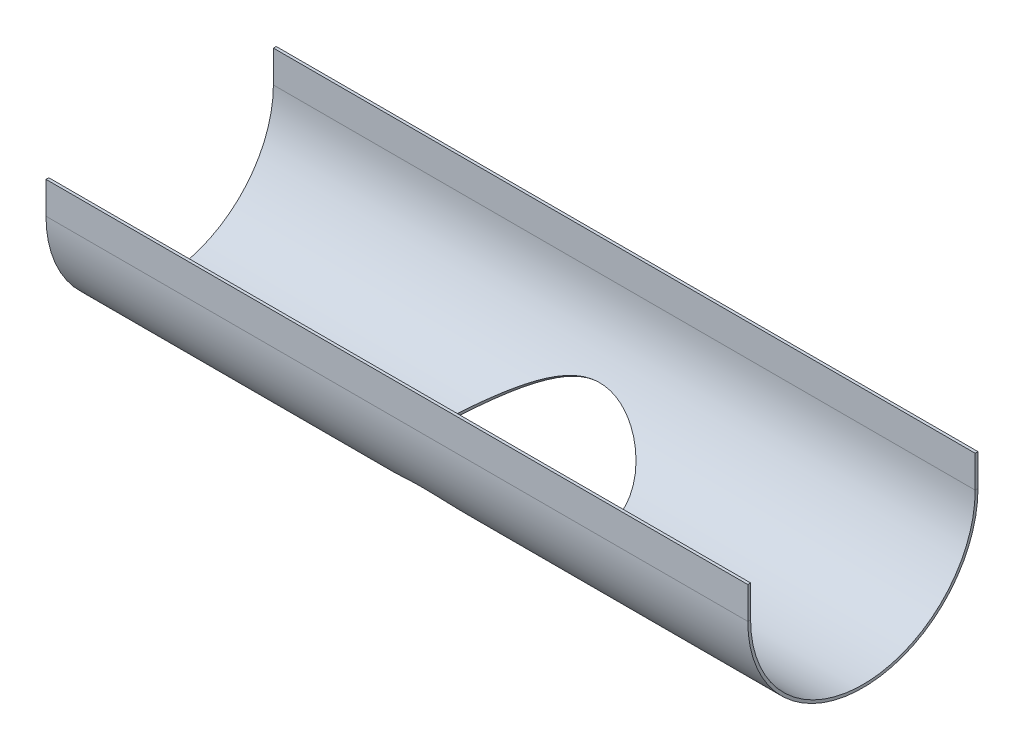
ISO-10303-21;
HEADER;
FILE_DESCRIPTION(('STEP AP214'),'2;1');
FILE_NAME('part.step','',(''),(''),'','','');
FILE_SCHEMA(('AUTOMOTIVE_DESIGN { 1 0 10303 214 1 1 1 1 }'));
ENDSEC;
DATA;
#1=APPLICATION_CONTEXT('core data for automotive mechanical design processes');
#2=APPLICATION_PROTOCOL_DEFINITION('international standard','automotive_design',2000,#1);
#3=PRODUCT_CONTEXT('',#1,'mechanical');
#4=PRODUCT('Part','Part','',(#3));
#5=PRODUCT_RELATED_PRODUCT_CATEGORY('part','',(#4));
#6=PRODUCT_DEFINITION_FORMATION('','',#4);
#7=PRODUCT_DEFINITION_CONTEXT('part definition',#1,'design');
#8=PRODUCT_DEFINITION('design','',#6,#7);
#9=PRODUCT_DEFINITION_SHAPE('','',#8);
#10=(LENGTH_UNIT() NAMED_UNIT(*) SI_UNIT(.MILLI.,.METRE.));
#11=(NAMED_UNIT(*) PLANE_ANGLE_UNIT() SI_UNIT($,.RADIAN.));
#12=(NAMED_UNIT(*) SI_UNIT($,.STERADIAN.) SOLID_ANGLE_UNIT());
#13=UNCERTAINTY_MEASURE_WITH_UNIT(LENGTH_MEASURE(1.E-05),#10,'distance_accuracy_value','');
#14=(GEOMETRIC_REPRESENTATION_CONTEXT(3) GLOBAL_UNCERTAINTY_ASSIGNED_CONTEXT((#13)) GLOBAL_UNIT_ASSIGNED_CONTEXT((#10,
#11,#12)) REPRESENTATION_CONTEXT('',''));
#15=CARTESIAN_POINT('',(0.,0.,0.));
#16=DIRECTION('',(0.,0.,1.));
#17=DIRECTION('',(1.,0.,0.));
#18=AXIS2_PLACEMENT_3D('',#15,#16,#17);
#19=CARTESIAN_POINT('',(-561.033398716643,127.234502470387,-80.));
#20=DIRECTION('',(1.,0.,0.));
#21=DIRECTION('',(0.,0.,-1.));
#22=AXIS2_PLACEMENT_3D('',#19,#20,#21);
#23=CYLINDRICAL_SURFACE('',#22,82.);
#24=DIRECTION('',(-1.,0.,0.));
#25=VECTOR('',#24,1.);
#26=CARTESIAN_POINT('',(250.,127.234502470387,2.));
#27=LINE('',#26,#25);
#28=CARTESIAN_POINT('',(250.,127.234502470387,2.));
#29=VERTEX_POINT('',#28);
#30=CARTESIAN_POINT('',(-250.,127.234502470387,2.));
#31=VERTEX_POINT('',#30);
#32=EDGE_CURVE('E145',#29,#31,#27,.T.);
#33=ORIENTED_EDGE('',*,*,#32,.T.);
#34=CARTESIAN_POINT('',(-250.,127.234502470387,-80.));
#35=DIRECTION('',(1.,0.,0.));
#36=DIRECTION('',(0.,0.,-1.));
#37=AXIS2_PLACEMENT_3D('',#34,#35,#36);
#38=CIRCLE('',#37,82.);
#39=CARTESIAN_POINT('',(-250.,127.234502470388,-162.));
#40=VERTEX_POINT('',#39);
#41=EDGE_CURVE('E63',#31,#40,#38,.T.);
#42=ORIENTED_EDGE('',*,*,#41,.T.);
#43=DIRECTION('',(-1.,0.,0.));
#44=VECTOR('',#43,1.);
#45=CARTESIAN_POINT('',(250.,127.234502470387,-162.));
#46=LINE('',#45,#44);
#47=CARTESIAN_POINT('',(250.,127.234502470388,-162.));
#48=VERTEX_POINT('',#47);
#49=EDGE_CURVE('E192',#48,#40,#46,.T.);
#50=ORIENTED_EDGE('',*,*,#49,.F.);
#51=CARTESIAN_POINT('',(250.,127.234502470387,-80.));
#52=DIRECTION('',(-1.,0.,0.));
#53=DIRECTION('',(0.,0.,1.));
#54=AXIS2_PLACEMENT_3D('',#51,#52,#53);
#55=CIRCLE('',#54,82.);
#56=EDGE_CURVE('E142',#48,#29,#55,.T.);
#57=ORIENTED_EDGE('',*,*,#56,.T.);
#58=EDGE_LOOP('',(#33,#42,#50,#57));
#59=FACE_BOUND('',#58,.T.);
#60=CARTESIAN_POINT('',(-0.00207807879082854,76.0486050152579,-144.062499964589));
#61=CARTESIAN_POINT('',(-0.670238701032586,76.0485764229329,-144.062477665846));
#62=CARTESIAN_POINT('',(-1.33842740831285,76.0347809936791,-144.051462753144));
#63=CARTESIAN_POINT('',(-2.33920518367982,75.9936189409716,-144.01852935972));
#64=CARTESIAN_POINT('',(-2.67253695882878,75.9764875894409,-144.004817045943));
#65=CARTESIAN_POINT('',(-3.33856567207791,75.9354747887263,-143.971950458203));
#66=CARTESIAN_POINT('',(-3.67126250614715,75.9115923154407,-143.952795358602));
#67=CARTESIAN_POINT('',(-4.76987767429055,75.8215955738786,-143.880510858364));
#68=CARTESIAN_POINT('',(-5.5339267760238,75.7410704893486,-143.815689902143));
#69=CARTESIAN_POINT('',(-7.05516248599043,75.5460908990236,-143.657864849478));
#70=CARTESIAN_POINT('',(-7.81234439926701,75.4316147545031,-143.564842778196));
#71=CARTESIAN_POINT('',(-9.31738438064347,75.1708496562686,-143.351435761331));
#72=CARTESIAN_POINT('',(-10.065241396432,75.0245571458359,-143.231047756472));
#73=CARTESIAN_POINT('',(-11.5519807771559,74.7022064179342,-142.963495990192));
#74=CARTESIAN_POINT('',(-12.2908305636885,74.5260625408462,-142.816255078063));
#75=CARTESIAN_POINT('',(-13.7559114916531,74.1470881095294,-142.496303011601));
#76=CARTESIAN_POINT('',(-14.4821443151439,73.944261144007,-142.323595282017));
#77=CARTESIAN_POINT('',(-15.9212257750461,73.5147073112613,-141.953724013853));
#78=CARTESIAN_POINT('',(-16.6340734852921,73.2879787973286,-141.756558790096));
#79=CARTESIAN_POINT('',(-17.8617220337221,72.8752101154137,-141.393175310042));
#80=CARTESIAN_POINT('',(-18.3797300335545,72.6939609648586,-141.232279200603));
#81=CARTESIAN_POINT('',(-19.4079503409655,72.3210314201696,-140.898057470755));
#82=CARTESIAN_POINT('',(-19.918162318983,72.1293505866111,-140.724731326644));
#83=CARTESIAN_POINT('',(-20.930821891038,71.7364721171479,-140.365879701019));
#84=CARTESIAN_POINT('',(-21.4332662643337,71.5352706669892,-140.180349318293));
#85=CARTESIAN_POINT('',(-22.4300997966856,71.1243945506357,-139.797446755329));
#86=CARTESIAN_POINT('',(-22.9244890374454,70.9147199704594,-139.600074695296));
#87=CARTESIAN_POINT('',(-23.9053256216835,70.4878563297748,-139.193791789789));
#88=CARTESIAN_POINT('',(-24.3917715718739,70.2706659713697,-138.98487894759));
#89=CARTESIAN_POINT('',(-25.3566688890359,69.8297200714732,-138.555833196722));
#90=CARTESIAN_POINT('',(-25.8351202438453,69.6059645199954,-138.335700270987));
#91=CARTESIAN_POINT('',(-26.7848439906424,69.152256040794,-137.883981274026));
#92=CARTESIAN_POINT('',(-27.2561020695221,68.9222927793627,-137.652375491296));
#93=CARTESIAN_POINT('',(-28.1905846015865,68.4573475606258,-137.178285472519));
#94=CARTESIAN_POINT('',(-28.6538090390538,68.2223655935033,-136.935801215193));
#95=CARTESIAN_POINT('',(-30.0313254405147,67.5111835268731,-136.192483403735));
#96=CARTESIAN_POINT('',(-30.933759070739,67.028603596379,-135.675642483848));
#97=CARTESIAN_POINT('',(-32.7070000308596,66.0518770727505,-134.600493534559));
#98=CARTESIAN_POINT('',(-33.5778079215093,65.5577306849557,-134.042186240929));
#99=CARTESIAN_POINT('',(-35.110986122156,64.6656764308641,-133.004795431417));
#100=CARTESIAN_POINT('',(-35.7791922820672,64.2690190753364,-132.533232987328));
#101=CARTESIAN_POINT('',(-37.0957827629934,63.4736016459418,-131.564910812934));
#102=CARTESIAN_POINT('',(-37.7441679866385,63.0748416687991,-131.068152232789));
#103=CARTESIAN_POINT('',(-38.7018172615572,62.4766172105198,-130.304283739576));
#104=CARTESIAN_POINT('',(-39.0185819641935,62.2771715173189,-130.046507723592));
#105=CARTESIAN_POINT('',(-39.6471173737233,61.8785274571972,-129.52478476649));
#106=CARTESIAN_POINT('',(-39.9588882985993,61.679329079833,-129.26083809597));
#107=CARTESIAN_POINT('',(-40.8866521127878,61.0824299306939,-128.45974414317));
#108=CARTESIAN_POINT('',(-41.495119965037,60.6854101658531,-127.913323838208));
#109=CARTESIAN_POINT('',(-42.6900143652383,59.8960343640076,-126.797399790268));
#110=CARTESIAN_POINT('',(-43.2764933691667,59.5036689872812,-126.227958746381));
#111=CARTESIAN_POINT('',(-44.4287527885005,58.7243264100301,-125.064906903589));
#112=CARTESIAN_POINT('',(-44.9945326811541,58.3373493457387,-124.471295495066));
#113=CARTESIAN_POINT('',(-46.1046020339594,57.5705661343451,-123.260252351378));
#114=CARTESIAN_POINT('',(-46.6488981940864,57.1907577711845,-122.642828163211));
#115=CARTESIAN_POINT('',(-47.7155759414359,56.4398840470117,-121.384283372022));
#116=CARTESIAN_POINT('',(-48.2379593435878,56.0688179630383,-120.743164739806));
#117=CARTESIAN_POINT('',(-49.2430501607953,55.3492005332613,-119.459178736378));
#118=CARTESIAN_POINT('',(-49.7264996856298,55.0003109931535,-118.817082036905));
#119=CARTESIAN_POINT('',(-50.6713741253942,54.313674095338,-117.511288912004));
#120=CARTESIAN_POINT('',(-51.1328029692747,53.975924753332,-116.847596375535));
#121=CARTESIAN_POINT('',(-52.0334316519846,53.3126748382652,-115.498296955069));
#122=CARTESIAN_POINT('',(-52.4726107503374,52.9871857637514,-114.81267056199));
#123=CARTESIAN_POINT('',(-53.3273540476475,52.350112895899,-113.420270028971));
#124=CARTESIAN_POINT('',(-53.7429124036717,52.0385325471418,-112.713490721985));
#125=CARTESIAN_POINT('',(-54.5438526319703,51.4350181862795,-111.289422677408));
#126=CARTESIAN_POINT('',(-54.9295717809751,51.1428724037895,-110.572413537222));
#127=CARTESIAN_POINT('',(-55.6760973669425,50.5749527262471,-109.119102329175));
#128=CARTESIAN_POINT('',(-56.0369018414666,50.2991801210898,-108.382798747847));
#129=CARTESIAN_POINT('',(-56.7326390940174,49.7653169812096,-106.891498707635));
#130=CARTESIAN_POINT('',(-57.0675646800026,49.5072313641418,-106.136497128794));
#131=CARTESIAN_POINT('',(-57.7104162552,49.0101712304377,-104.608923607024));
#132=CARTESIAN_POINT('',(-58.0183429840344,48.7711961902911,-103.836352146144));
#133=CARTESIAN_POINT('',(-58.6062129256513,48.3135319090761,-102.274269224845));
#134=CARTESIAN_POINT('',(-58.8861429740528,48.0948522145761,-101.484750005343));
#135=CARTESIAN_POINT('',(-59.4168654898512,47.6791631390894,-99.8903666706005));
#136=CARTESIAN_POINT('',(-59.6676584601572,47.4821533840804,-99.0855028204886));
#137=CARTESIAN_POINT('',(-60.1391219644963,47.1109880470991,-97.4618399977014));
#138=CARTESIAN_POINT('',(-60.3597943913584,46.9368310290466,-96.643041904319));
#139=CARTESIAN_POINT('',(-60.7699504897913,46.6124560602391,-94.9930831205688));
#140=CARTESIAN_POINT('',(-60.9594371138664,46.4622358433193,-94.1619236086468));
#141=CARTESIAN_POINT('',(-61.3544476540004,46.1486376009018,-92.2577644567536));
#142=CARTESIAN_POINT('',(-61.5499492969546,45.9930824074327,-91.181366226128));
#143=CARTESIAN_POINT('',(-61.8873345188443,45.7242451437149,-89.0149578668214));
#144=CARTESIAN_POINT('',(-62.02921692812,45.6109639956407,-87.9249474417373));
#145=CARTESIAN_POINT('',(-62.2582841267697,45.4279616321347,-85.7355494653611));
#146=CARTESIAN_POINT('',(-62.3454695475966,45.3582399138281,-84.6361620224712));
#147=CARTESIAN_POINT('',(-62.4642207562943,45.2632033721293,-82.4332467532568));
#148=CARTESIAN_POINT('',(-62.4958259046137,45.2378571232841,-81.32972241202));
#149=CARTESIAN_POINT('',(-62.503399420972,45.2317709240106,-79.1223600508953));
#150=CARTESIAN_POINT('',(-62.4793670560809,45.2510315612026,-78.0185220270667));
#151=CARTESIAN_POINT('',(-62.3757878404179,45.3339371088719,-75.8152266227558));
#152=CARTESIAN_POINT('',(-62.2962485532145,45.3975759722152,-74.7157686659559));
#153=CARTESIAN_POINT('',(-62.1188323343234,45.5393869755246,-72.8983350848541));
#154=CARTESIAN_POINT('',(-62.0363991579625,45.6052498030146,-72.1778246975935));
#155=CARTESIAN_POINT('',(-61.8479804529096,45.7556300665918,-70.741790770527));
#156=CARTESIAN_POINT('',(-61.7419938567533,45.8401483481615,-70.0262674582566));
#157=CARTESIAN_POINT('',(-61.5068187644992,46.0274112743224,-68.6015548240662));
#158=CARTESIAN_POINT('',(-61.377633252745,46.1301535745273,-67.8923646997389));
#159=CARTESIAN_POINT('',(-61.096599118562,46.3533833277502,-66.4813178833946));
#160=CARTESIAN_POINT('',(-60.9447507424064,46.4738705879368,-65.779461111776));
#161=CARTESIAN_POINT('',(-60.6187877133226,46.7320537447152,-64.3840036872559));
#162=CARTESIAN_POINT('',(-60.4446691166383,46.8697526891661,-63.6904045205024));
#163=CARTESIAN_POINT('',(-60.0747054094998,47.161721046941,-62.3125576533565));
#164=CARTESIAN_POINT('',(-59.8788602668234,47.3159904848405,-61.6283099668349));
#165=CARTESIAN_POINT('',(-59.4660856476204,47.6404404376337,-60.2700006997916));
#166=CARTESIAN_POINT('',(-59.2491553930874,47.8106215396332,-59.5959394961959));
#167=CARTESIAN_POINT('',(-58.7947740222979,48.1661773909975,-58.2588278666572));
#168=CARTESIAN_POINT('',(-58.5573225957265,48.3515523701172,-57.5957776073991));
#169=CARTESIAN_POINT('',(-58.0511600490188,48.7456031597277,-56.2511942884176));
#170=CARTESIAN_POINT('',(-57.7815137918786,48.9549583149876,-55.5702124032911));
#171=CARTESIAN_POINT('',(-57.2212012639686,49.3885943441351,-54.2217887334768));
#172=CARTESIAN_POINT('',(-56.9305348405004,49.6128753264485,-53.5543470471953));
#173=CARTESIAN_POINT('',(-56.3288711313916,50.075451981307,-52.2336447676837));
#174=CARTESIAN_POINT('',(-56.0178738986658,50.3137476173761,-51.5803841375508));
#175=CARTESIAN_POINT('',(-55.3762118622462,50.80342244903,-50.2886022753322));
#176=CARTESIAN_POINT('',(-55.0455470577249,51.0548016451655,-49.6500810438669));
#177=CARTESIAN_POINT('',(-54.3653944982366,51.5696859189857,-48.3882974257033));
#178=CARTESIAN_POINT('',(-54.015909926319,51.8331889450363,-47.7650324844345));
#179=CARTESIAN_POINT('',(-53.2986354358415,52.371403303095,-46.5340826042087));
#180=CARTESIAN_POINT('',(-52.9308456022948,52.6461145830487,-45.9263975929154));
#181=CARTESIAN_POINT('',(-52.1775695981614,53.2058135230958,-44.7269047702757));
#182=CARTESIAN_POINT('',(-51.7920827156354,53.490801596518,-44.1350975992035));
#183=CARTESIAN_POINT('',(-51.0040544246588,54.0701134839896,-42.9676244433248));
#184=CARTESIAN_POINT('',(-50.6015127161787,54.364437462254,-42.3919587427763));
#185=CARTESIAN_POINT('',(-49.7087041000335,55.0131613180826,-41.1587365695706));
#186=CARTESIAN_POINT('',(-49.2153181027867,55.3691376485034,-40.504264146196));
#187=CARTESIAN_POINT('',(-48.2065961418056,56.0910968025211,-39.218145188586));
#188=CARTESIAN_POINT('',(-47.6912596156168,56.457079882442,-38.5864992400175));
#189=CARTESIAN_POINT('',(-46.639266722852,57.1975189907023,-37.3462476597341));
#190=CARTESIAN_POINT('',(-46.1026085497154,57.5719757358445,-36.7376439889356));
#191=CARTESIAN_POINT('',(-45.0085615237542,58.3277244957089,-35.5437844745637));
#192=CARTESIAN_POINT('',(-44.4511728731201,58.7090164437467,-34.9585284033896));
#193=CARTESIAN_POINT('',(-43.3146830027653,59.4779783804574,-33.809822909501));
#194=CARTESIAN_POINT('',(-42.7355245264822,59.8656634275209,-33.246440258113));
#195=CARTESIAN_POINT('',(-41.557254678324,60.6446399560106,-32.1434848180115));
#196=CARTESIAN_POINT('',(-40.9581429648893,61.0359314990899,-31.6039124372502));
#197=CARTESIAN_POINT('',(-40.044803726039,61.6242619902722,-30.8125582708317));
#198=CARTESIAN_POINT('',(-39.7378995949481,61.8206121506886,-30.55176431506));
#199=CARTESIAN_POINT('',(-39.1192515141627,62.2135676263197,-30.0361821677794));
#200=CARTESIAN_POINT('',(-38.8075075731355,62.410172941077,-29.7813939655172));
#201=CARTESIAN_POINT('',(-37.8650399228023,62.9999854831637,-29.0261357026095));
#202=CARTESIAN_POINT('',(-37.227024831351,63.3932251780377,-28.5347238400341));
#203=CARTESIAN_POINT('',(-36.1935002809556,64.0192020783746,-27.7701045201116));
#204=CARTESIAN_POINT('',(-35.8041971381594,64.2525737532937,-27.4889777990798));
#205=CARTESIAN_POINT('',(-35.0187805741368,64.7182215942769,-26.9354597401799));
#206=CARTESIAN_POINT('',(-34.6226670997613,64.9504977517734,-26.6630684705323));
#207=CARTESIAN_POINT('',(-33.4240178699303,65.645043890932,-25.8590717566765));
#208=CARTESIAN_POINT('',(-32.6112144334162,66.1050065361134,-25.3406738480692));
#209=CARTESIAN_POINT('',(-30.9580153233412,67.0148807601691,-24.3398281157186));
#210=CARTESIAN_POINT('',(-30.1176135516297,67.4647900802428,-23.8573883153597));
#211=CARTESIAN_POINT('',(-28.4087624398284,68.3504177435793,-22.9292006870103));
#212=CARTESIAN_POINT('',(-27.5402981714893,68.7861282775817,-22.4834728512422));
#213=CARTESIAN_POINT('',(-25.7788001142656,69.636369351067,-21.6320668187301));
#214=CARTESIAN_POINT('',(-24.8858774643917,70.0509770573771,-21.2262367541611));
#215=CARTESIAN_POINT('',(-23.5258677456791,70.6544406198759,-20.6470354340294));
#216=CARTESIAN_POINT('',(-23.0690959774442,70.8525194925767,-20.4588931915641));
#217=CARTESIAN_POINT('',(-22.1485751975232,71.2417315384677,-20.0927301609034));
#218=CARTESIAN_POINT('',(-21.6848262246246,71.43286475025,-19.9147093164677));
#219=CARTESIAN_POINT('',(-20.7507207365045,71.8072497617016,-19.5691758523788));
#220=CARTESIAN_POINT('',(-20.280369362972,71.9905072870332,-19.4016555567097));
#221=CARTESIAN_POINT('',(-19.332848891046,72.3485258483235,-19.0771968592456));
#222=CARTESIAN_POINT('',(-18.8556797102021,72.5232867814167,-18.9202585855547));
#223=CARTESIAN_POINT('',(-17.4146811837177,73.0333165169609,-18.4659558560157));
#224=CARTESIAN_POINT('',(-16.4406155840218,73.354633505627,-18.1848270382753));
#225=CARTESIAN_POINT('',(-14.7440420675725,73.8687388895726,-17.7410559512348));
#226=CARTESIAN_POINT('',(-14.0276586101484,74.072290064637,-17.567303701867));
#227=CARTESIAN_POINT('',(-12.5826091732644,74.4536256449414,-17.2445904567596));
#228=CARTESIAN_POINT('',(-11.8539451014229,74.6314140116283,-17.0956256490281));
#229=CARTESIAN_POINT('',(-10.3855109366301,74.9585691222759,-16.8234845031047));
#230=CARTESIAN_POINT('',(-9.64574134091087,75.1079371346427,-16.7003070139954));
#231=CARTESIAN_POINT('',(-8.15815388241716,75.3754947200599,-16.4809223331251));
#232=CARTESIAN_POINT('',(-7.41035512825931,75.4937461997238,-16.3846615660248));
#233=CARTESIAN_POINT('',(-5.90720251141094,75.6973799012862,-16.2195781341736));
#234=CARTESIAN_POINT('',(-5.15184807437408,75.7827596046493,-16.1507575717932));
#235=CARTESIAN_POINT('',(-3.63600990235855,75.9189480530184,-16.0412512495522));
#236=CARTESIAN_POINT('',(-2.87552637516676,75.9697581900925,-16.0005643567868));
#237=CARTESIAN_POINT('',(-1.34840935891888,76.0359524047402,-15.9475972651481));
#238=CARTESIAN_POINT('',(-0.581763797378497,76.051167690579,-15.9354524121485));
#239=CARTESIAN_POINT('',(0.951342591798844,76.0453408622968,-15.9401081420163));
#240=CARTESIAN_POINT('',(1.71780340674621,76.0242967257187,-15.9569103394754));
#241=CARTESIAN_POINT('',(3.2476531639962,75.946425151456,-16.0192560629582));
#242=CARTESIAN_POINT('',(4.0110423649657,75.8896007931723,-16.0647971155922));
#243=CARTESIAN_POINT('',(5.53312761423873,75.741214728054,-16.1842467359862));
#244=CARTESIAN_POINT('',(6.29181678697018,75.6496106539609,-16.2581899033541));
#245=CARTESIAN_POINT('',(7.8012874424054,75.4334489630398,-16.4337337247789));
#246=CARTESIAN_POINT('',(8.55206837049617,75.3088890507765,-16.5353363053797));
#247=CARTESIAN_POINT('',(10.043739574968,75.0290271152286,-16.7653489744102));
#248=CARTESIAN_POINT('',(10.7846290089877,74.8737224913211,-16.8937613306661));
#249=CARTESIAN_POINT('',(12.4559524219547,74.488630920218,-17.2150338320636));
#250=CARTESIAN_POINT('',(13.3828379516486,74.2500886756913,-17.4159157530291));
#251=CARTESIAN_POINT('',(15.2158314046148,73.7328959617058,-17.8574732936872));
#252=CARTESIAN_POINT('',(16.1219336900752,73.4542347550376,-18.0981595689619));
#253=CARTESIAN_POINT('',(17.9118446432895,72.8624600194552,-18.617300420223));
#254=CARTESIAN_POINT('',(18.79565166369,72.5493439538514,-18.8957577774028));
#255=CARTESIAN_POINT('',(20.1051899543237,72.0575359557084,-19.3406932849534));
#256=CARTESIAN_POINT('',(20.5396314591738,71.8896488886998,-19.4937908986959));
#257=CARTESIAN_POINT('',(21.4026426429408,71.5471822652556,-19.8088338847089));
#258=CARTESIAN_POINT('',(21.8312123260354,71.372602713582,-19.9707792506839));
#259=CARTESIAN_POINT('',(22.6823753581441,71.0174037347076,-20.3032916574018));
#260=CARTESIAN_POINT('',(23.104969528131,70.8367851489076,-20.4738574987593));
#261=CARTESIAN_POINT('',(23.9442698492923,70.470113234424,-20.8234144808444));
#262=CARTESIAN_POINT('',(24.3609760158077,70.2840599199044,-21.002405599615));
#263=CARTESIAN_POINT('',(25.188561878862,69.9070767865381,-21.3686488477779));
#264=CARTESIAN_POINT('',(25.5994410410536,69.716146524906,-21.5559017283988));
#265=CARTESIAN_POINT('',(26.4153112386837,69.3299088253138,-21.9385503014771));
#266=CARTESIAN_POINT('',(26.8203021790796,69.134601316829,-22.1339461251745));
#267=CARTESIAN_POINT('',(27.7995760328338,68.6541636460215,-22.6196374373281));
#268=CARTESIAN_POINT('',(28.3707431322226,68.3669717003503,-22.9141898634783));
#269=CARTESIAN_POINT('',(29.5011011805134,67.786048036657,-23.5194082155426));
#270=CARTESIAN_POINT('',(30.0602916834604,67.4923160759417,-23.8300747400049));
#271=CARTESIAN_POINT('',(31.1668997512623,66.8994927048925,-24.467342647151));
#272=CARTESIAN_POINT('',(31.7143136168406,66.6003996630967,-24.7939489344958));
#273=CARTESIAN_POINT('',(32.797221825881,65.9981390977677,-25.4627620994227));
#274=CARTESIAN_POINT('',(33.3327162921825,65.6949716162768,-25.8049688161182));
#275=CARTESIAN_POINT('',(34.3919945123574,65.0856088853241,-26.5048567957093));
#276=CARTESIAN_POINT('',(34.9157751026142,64.7794128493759,-26.8625421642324));
#277=CARTESIAN_POINT('',(35.9514617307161,64.1651328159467,-27.593106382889));
#278=CARTESIAN_POINT('',(36.4633677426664,63.8570488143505,-27.96598526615));
#279=CARTESIAN_POINT('',(37.9792468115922,62.9325713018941,-29.1058260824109));
#280=CARTESIAN_POINT('',(38.9655258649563,62.3147106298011,-29.895410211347));
#281=CARTESIAN_POINT('',(40.4087518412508,61.3909166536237,-31.1237788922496));
#282=CARTESIAN_POINT('',(40.8837492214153,61.083515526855,-31.5405231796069));
#283=CARTESIAN_POINT('',(41.8215940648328,60.4704274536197,-32.3887408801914));
#284=CARTESIAN_POINT('',(42.2844414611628,60.1647405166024,-32.8202143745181));
#285=CARTESIAN_POINT('',(43.197634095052,59.5560648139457,-33.6975803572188));
#286=CARTESIAN_POINT('',(43.6479842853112,59.2530750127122,-34.1434669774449));
#287=CARTESIAN_POINT('',(44.5362189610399,58.6504884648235,-35.049703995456));
#288=CARTESIAN_POINT('',(44.9741037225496,58.3508916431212,-35.5100540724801));
#289=CARTESIAN_POINT('',(45.7279958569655,57.8310630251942,-36.3269641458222));
#290=CARTESIAN_POINT('',(46.0468276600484,57.6099157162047,-36.6803398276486));
#291=CARTESIAN_POINT('',(46.6772319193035,57.1702584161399,-37.3950970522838));
#292=CARTESIAN_POINT('',(46.9888044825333,56.9517483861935,-37.7564784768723));
#293=CARTESIAN_POINT('',(47.9123847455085,56.3007457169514,-38.8524103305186));
#294=CARTESIAN_POINT('',(48.513409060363,55.8726740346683,-39.5989152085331));
#295=CARTESIAN_POINT('',(49.685273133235,55.0305560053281,-41.1239236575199));
#296=CARTESIAN_POINT('',(50.2560912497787,54.6165197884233,-41.9024494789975));
#297=CARTESIAN_POINT('',(51.0883600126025,54.0080816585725,-43.0934941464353));
#298=CARTESIAN_POINT('',(51.3618264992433,53.8073444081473,-43.4944428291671));
#299=CARTESIAN_POINT('',(51.9006084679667,53.4103954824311,-44.3039994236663));
#300=CARTESIAN_POINT('',(52.1659238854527,53.2141838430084,-44.7126073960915));
#301=CARTESIAN_POINT('',(52.7214573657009,52.8018949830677,-45.5899601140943));
#302=CARTESIAN_POINT('',(53.0105403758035,52.5864725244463,-46.0597328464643));
#303=CARTESIAN_POINT('',(53.5777485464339,52.1622165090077,-47.0087573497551));
#304=CARTESIAN_POINT('',(53.8558736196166,51.9533830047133,-47.4880091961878));
#305=CARTESIAN_POINT('',(54.6735697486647,51.3373340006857,-48.9399725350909));
#306=CARTESIAN_POINT('',(55.1963612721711,50.9406447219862,-49.9267333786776));
#307=CARTESIAN_POINT('',(56.1945349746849,50.1788696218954,-51.93606911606));
#308=CARTESIAN_POINT('',(56.6699067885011,49.8137907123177,-52.9586517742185));
#309=CARTESIAN_POINT('',(57.5699389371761,49.1192791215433,-55.0358399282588));
#310=CARTESIAN_POINT('',(57.9946714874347,48.7897957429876,-56.090397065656));
#311=CARTESIAN_POINT('',(58.7912657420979,48.1692579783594,-58.2301188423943));
#312=CARTESIAN_POINT('',(59.1631376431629,47.8781961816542,-59.3152775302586));
#313=CARTESIAN_POINT('',(59.8514920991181,47.3377309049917,-61.5125742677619));
#314=CARTESIAN_POINT('',(60.1680064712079,47.0883034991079,-62.6246963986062));
#315=CARTESIAN_POINT('',(60.6596243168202,46.6997919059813,-64.5461099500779));
#316=CARTESIAN_POINT('',(60.8490995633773,46.5497001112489,-65.3495427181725));
#317=CARTESIAN_POINT('',(61.1981972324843,46.2727528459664,-66.9666672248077));
#318=CARTESIAN_POINT('',(61.3578265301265,46.14589202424,-67.7803565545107));
#319=CARTESIAN_POINT('',(61.6465844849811,45.9161238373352,-69.4167949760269));
#320=CARTESIAN_POINT('',(61.7757021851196,45.8132250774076,-70.2395472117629));
#321=CARTESIAN_POINT('',(62.0027521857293,45.6321007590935,-71.8920434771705));
#322=CARTESIAN_POINT('',(62.1006842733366,45.5538753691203,-72.7217875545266));
#323=CARTESIAN_POINT('',(62.2770918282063,45.4129118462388,-74.5095009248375));
#324=CARTESIAN_POINT('',(62.3505491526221,45.3541740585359,-75.4682886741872));
#325=CARTESIAN_POINT('',(62.4552188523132,45.2704077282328,-77.3899327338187));
#326=CARTESIAN_POINT('',(62.4864177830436,45.2453899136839,-78.3527902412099));
#327=CARTESIAN_POINT('',(62.506476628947,45.2293194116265,-80.2793626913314));
#328=CARTESIAN_POINT('',(62.4953308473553,45.2382712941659,-81.243077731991));
#329=CARTESIAN_POINT('',(62.4306530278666,45.2900684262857,-83.1680771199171));
#330=CARTESIAN_POINT('',(62.3771250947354,45.3329103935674,-84.129361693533));
#331=CARTESIAN_POINT('',(62.2280841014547,45.4520905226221,-86.0464344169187));
#332=CARTESIAN_POINT('',(62.1325768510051,45.5284240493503,-87.002223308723));
#333=CARTESIAN_POINT('',(61.9002599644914,45.7138886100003,-88.9052254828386));
#334=CARTESIAN_POINT('',(61.7634653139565,45.8230077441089,-89.8524417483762));
#335=CARTESIAN_POINT('',(61.4897199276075,46.0409788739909,-91.493925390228));
#336=CARTESIAN_POINT('',(61.3618324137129,46.1427018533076,-92.1906779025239));
#337=CARTESIAN_POINT('',(61.0841739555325,46.3632504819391,-93.5769294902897));
#338=CARTESIAN_POINT('',(60.9344077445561,46.4820724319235,-94.2664301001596));
#339=CARTESIAN_POINT('',(60.6134819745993,46.7362501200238,-95.6370384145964));
#340=CARTESIAN_POINT('',(60.4423313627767,46.8715989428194,-96.3181494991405));
#341=CARTESIAN_POINT('',(60.0790435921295,47.1583005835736,-97.671458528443));
#342=CARTESIAN_POINT('',(59.8869028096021,47.3096561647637,-98.343654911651));
#343=CARTESIAN_POINT('',(59.4122970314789,47.6827359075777,-99.9090066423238));
#344=CARTESIAN_POINT('',(59.1215735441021,47.910694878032,-100.798190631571));
#345=CARTESIAN_POINT('',(58.504477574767,48.3928493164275,-102.557166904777));
#346=CARTESIAN_POINT('',(58.1780929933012,48.6470536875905,-103.42695248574));
#347=CARTESIAN_POINT('',(57.4912448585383,49.1799270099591,-105.145428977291));
#348=CARTESIAN_POINT('',(57.130777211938,49.4585988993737,-105.994117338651));
#349=CARTESIAN_POINT('',(56.3768680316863,50.0387851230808,-107.669620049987));
#350=CARTESIAN_POINT('',(55.9834000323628,50.3403177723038,-108.496416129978));
#351=CARTESIAN_POINT('',(55.1652004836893,50.9641050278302,-110.126197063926));
#352=CARTESIAN_POINT('',(54.740473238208,51.2863567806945,-110.929185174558));
#353=CARTESIAN_POINT('',(53.8612688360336,51.9496919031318,-112.510494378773));
#354=CARTESIAN_POINT('',(53.4067970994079,52.2907718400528,-113.288819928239));
#355=CARTESIAN_POINT('',(52.5276139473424,52.9462901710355,-114.724694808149));
#356=CARTESIAN_POINT('',(52.10625366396,53.2587503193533,-115.385206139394));
#357=CARTESIAN_POINT('',(51.2425505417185,53.8953463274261,-116.686409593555));
#358=CARTESIAN_POINT('',(50.8002110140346,54.2194803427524,-117.32710481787));
#359=CARTESIAN_POINT('',(49.8953024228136,54.8780446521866,-118.588195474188));
#360=CARTESIAN_POINT('',(49.4327407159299,55.2124711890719,-119.208598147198));
#361=CARTESIAN_POINT('',(48.4878663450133,55.8904786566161,-120.429170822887));
#362=CARTESIAN_POINT('',(48.0055502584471,56.2340611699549,-121.029337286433));
#363=CARTESIAN_POINT('',(46.6762371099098,57.1732595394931,-122.623708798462));
#364=CARTESIAN_POINT('',(45.8110817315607,57.7763657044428,-123.598534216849));
#365=CARTESIAN_POINT('',(44.4736091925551,58.6931734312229,-125.015589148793));
#366=CARTESIAN_POINT('',(44.0210070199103,59.0009035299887,-125.480555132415));
#367=CARTESIAN_POINT('',(43.102861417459,59.6195692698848,-126.39531936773));
#368=CARTESIAN_POINT('',(42.63731812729,59.9305048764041,-126.845117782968));
#369=CARTESIAN_POINT('',(41.2211634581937,60.8669978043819,-128.17183990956));
#370=CARTESIAN_POINT('',(40.2512269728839,61.4961036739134,-129.025878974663));
#371=CARTESIAN_POINT('',(38.7578711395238,62.4421154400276,-130.261484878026));
#372=CARTESIAN_POINT('',(38.2529690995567,62.7582735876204,-130.666294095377));
#373=CARTESIAN_POINT('',(37.2306376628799,63.390123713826,-131.460204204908));
#374=CARTESIAN_POINT('',(36.713208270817,63.7058156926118,-131.849305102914));
#375=CARTESIAN_POINT('',(35.6660641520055,64.3356092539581,-132.61153453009));
#376=CARTESIAN_POINT('',(35.1363531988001,64.649711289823,-132.984667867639));
#377=CARTESIAN_POINT('',(34.0646098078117,65.275374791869,-133.714967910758));
#378=CARTESIAN_POINT('',(33.5225773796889,65.5869362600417,-134.072134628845));
#379=CARTESIAN_POINT('',(31.8781209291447,66.5157940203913,-135.119034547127));
#380=CARTESIAN_POINT('',(30.7568600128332,67.1275532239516,-135.784515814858));
#381=CARTESIAN_POINT('',(29.0170219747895,68.0370541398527,-136.743863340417));
#382=CARTESIAN_POINT('',(28.4166087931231,68.3440441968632,-137.062258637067));
#383=CARTESIAN_POINT('',(27.2022699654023,68.9496423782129,-137.680692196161));
#384=CARTESIAN_POINT('',(26.5883452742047,69.2482510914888,-137.980731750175));
#385=CARTESIAN_POINT('',(25.346764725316,69.8353730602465,-138.562023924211));
#386=CARTESIAN_POINT('',(24.7191068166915,70.1238847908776,-138.843273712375));
#387=CARTESIAN_POINT('',(23.4502521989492,70.6889140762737,-139.386446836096));
#388=CARTESIAN_POINT('',(22.8090556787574,70.9654317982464,-139.648370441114));
#389=CARTESIAN_POINT('',(20.8701103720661,71.7716212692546,-140.402052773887));
#390=CARTESIAN_POINT('',(19.5517042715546,72.2804718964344,-140.864216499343));
#391=CARTESIAN_POINT('',(17.535617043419,72.9884165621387,-141.493593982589));
#392=CARTESIAN_POINT('',(16.8573005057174,73.2151404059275,-141.692711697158));
#393=CARTESIAN_POINT('',(15.4879437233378,73.6476249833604,-142.06874114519));
#394=CARTESIAN_POINT('',(14.7969055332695,73.8533890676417,-142.245656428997));
#395=CARTESIAN_POINT('',(13.8222186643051,74.1247886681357,-142.476944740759));
#396=CARTESIAN_POINT('',(13.5435499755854,74.2002641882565,-142.54101739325));
#397=CARTESIAN_POINT('',(12.9843888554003,74.3473714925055,-142.665466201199));
#398=CARTESIAN_POINT('',(12.7038964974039,74.4190034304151,-142.725842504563));
#399=CARTESIAN_POINT('',(11.8598067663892,74.6278602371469,-142.901305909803));
#400=CARTESIAN_POINT('',(11.2935187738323,74.7590678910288,-143.010746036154));
#401=CARTESIAN_POINT('',(10.1543219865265,75.0042310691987,-143.214113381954));
#402=CARTESIAN_POINT('',(9.58141170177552,75.1181826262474,-143.308037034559));
#403=CARTESIAN_POINT('',(8.42982476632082,75.3276716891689,-143.479912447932));
#404=CARTESIAN_POINT('',(7.85114795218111,75.4232086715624,-143.55786375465));
#405=CARTESIAN_POINT('',(6.67102223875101,75.5974761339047,-143.699533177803));
#406=CARTESIAN_POINT('',(6.06942132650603,75.6755976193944,-143.762738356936));
#407=CARTESIAN_POINT('',(4.86218755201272,75.8102268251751,-143.871365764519));
#408=CARTESIAN_POINT('',(4.25655460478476,75.8667340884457,-143.916787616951));
#409=CARTESIAN_POINT('',(3.04275693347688,75.9574128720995,-143.98955753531));
#410=CARTESIAN_POINT('',(2.4345932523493,75.9915928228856,-144.016912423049));
#411=CARTESIAN_POINT('',(1.21693472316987,76.0372008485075,-144.053392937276));
#412=CARTESIAN_POINT('',(0.607440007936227,76.0486310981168,-144.062520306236));
#413=CARTESIAN_POINT('',(-0.00207807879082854,76.0486050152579,-144.062499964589));
#414=B_SPLINE_CURVE_WITH_KNOTS('',3,(#60,#61,#62,#63,#64,#65,#66,#67,#68,#69,#70,#71,#72,#73,
#74,#75,#76,#77,#78,#79,#80,#81,#82,#83,#84,#85,#86,#87,#88,#89,#90,#91,#92,#93,#94,#95,#96,#97,
#98,#99,#100,#101,#102,#103,#104,#105,#106,#107,#108,#109,#110,#111,#112,#113,#114,#115,#116,
#117,#118,#119,#120,#121,#122,#123,#124,#125,#126,#127,#128,#129,#130,#131,#132,#133,#134,#135,
#136,#137,#138,#139,#140,#141,#142,#143,#144,#145,#146,#147,#148,#149,#150,#151,#152,#153,#154,
#155,#156,#157,#158,#159,#160,#161,#162,#163,#164,#165,#166,#167,#168,#169,#170,#171,#172,#173,
#174,#175,#176,#177,#178,#179,#180,#181,#182,#183,#184,#185,#186,#187,#188,#189,#190,#191,#192,
#193,#194,#195,#196,#197,#198,#199,#200,#201,#202,#203,#204,#205,#206,#207,#208,#209,#210,#211,
#212,#213,#214,#215,#216,#217,#218,#219,#220,#221,#222,#223,#224,#225,#226,#227,#228,#229,#230,
#231,#232,#233,#234,#235,#236,#237,#238,#239,#240,#241,#242,#243,#244,#245,#246,#247,#248,#249,
#250,#251,#252,#253,#254,#255,#256,#257,#258,#259,#260,#261,#262,#263,#264,#265,#266,#267,#268,
#269,#270,#271,#272,#273,#274,#275,#276,#277,#278,#279,#280,#281,#282,#283,#284,#285,#286,#287,
#288,#289,#290,#291,#292,#293,#294,#295,#296,#297,#298,#299,#300,#301,#302,#303,#304,#305,#306,
#307,#308,#309,#310,#311,#312,#313,#314,#315,#316,#317,#318,#319,#320,#321,#322,#323,#324,#325,
#326,#327,#328,#329,#330,#331,#332,#333,#334,#335,#336,#337,#338,#339,#340,#341,#342,#343,#344,
#345,#346,#347,#348,#349,#350,#351,#352,#353,#354,#355,#356,#357,#358,#359,#360,#361,#362,#363,
#364,#365,#366,#367,#368,#369,#370,#371,#372,#373,#374,#375,#376,#377,#378,#379,#380,#381,#382,
#383,#384,#385,#386,#387,#388,#389,#390,#391,#392,#393,#394,#395,#396,#397,#398,#399,#400,#401,
#402,#403,#404,#405,#406,#407,#408,#409,#410,#411,#412,#413),.UNSPECIFIED.,.T.,.F.,(4,2,2,2,2,2,
2,2,2,2,2,2,2,2,2,2,2,2,2,2,2,2,2,2,2,2,2,2,2,2,2,2,2,2,2,2,2,2,2,2,2,2,2,2,2,2,2,2,2,2,2,2,2,2,
2,2,2,2,2,2,2,2,2,2,2,2,2,2,2,2,2,2,2,2,2,2,2,2,2,2,2,2,2,2,2,2,2,2,2,2,2,2,2,2,2,2,2,2,2,2,2,2,
2,2,2,2,2,2,2,2,2,2,2,2,2,2,2,2,2,2,2,2,2,2,2,2,2,2,2,2,2,2,2,2,2,2,2,2,2,2,2,2,2,2,2,2,2,2,2,2,
2,2,2,2,2,2,2,2,2,2,2,2,2,2,2,2,2,2,2,2,2,2,2,2,2,2,4),(0.,2.00424430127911,3.006306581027,
4.00852094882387,6.32007975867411,8.63311501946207,10.9464089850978,13.2664570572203,
15.5861934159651,17.9060896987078,19.6215188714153,21.3370203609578,23.0532150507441,
24.7693923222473,26.4858674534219,28.2023451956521,29.9218818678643,31.641421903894,
35.0794213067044,38.5173597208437,41.2437018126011,43.9699195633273,45.3333491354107,
46.6967190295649,49.4233566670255,52.1430115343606,54.8627350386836,57.581603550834,
60.3002464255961,62.9282662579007,65.5558154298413,68.1857704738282,70.8163732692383,
73.4106765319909,76.0051839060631,78.6004097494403,81.195564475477,83.7919337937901,
86.3882582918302,88.9844195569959,91.5803348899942,94.89313990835,98.2060171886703,
101.518856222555,104.82934824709,108.139883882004,111.449968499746,113.633974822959,
115.818080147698,118.001904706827,120.185705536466,122.369893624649,124.554084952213,
126.738356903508,128.922661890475,131.20736106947,133.492076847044,135.776786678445,
138.061496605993,140.345821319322,142.630135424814,144.914541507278,147.19898779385,
149.879072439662,152.559225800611,155.239606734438,157.91996153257,160.607941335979,
163.295967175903,164.640086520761,165.984203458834,168.672192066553,170.273797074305,
171.875414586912,175.078820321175,178.282938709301,181.488790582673,184.681924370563,
186.278474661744,187.875016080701,189.470376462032,191.06575615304,194.253969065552,
196.547384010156,198.840445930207,201.133405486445,203.421768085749,205.710305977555,
207.99875170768,210.298027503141,212.59743155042,214.896637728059,217.198653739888,
219.500830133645,221.803201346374,224.734936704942,227.667458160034,230.600195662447,
232.070876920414,233.541557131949,235.012033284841,236.482505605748,237.953111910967,
239.423741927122,241.535086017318,243.646508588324,245.75858499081,247.870639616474,
249.983257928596,252.095880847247,256.312571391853,258.420493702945,260.528427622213,
262.635513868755,264.742553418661,266.316893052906,267.89120945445,271.039090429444,
274.189197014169,275.764691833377,277.340199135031,279.116476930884,280.89276888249,
284.445957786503,287.999921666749,291.548755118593,295.096903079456,298.643004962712,
301.15918420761,303.674783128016,306.191284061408,308.707802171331,311.596425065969,
314.485966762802,317.375897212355,320.265547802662,323.154798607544,326.043001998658,
328.189430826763,330.335395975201,332.480466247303,334.625907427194,337.513236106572,
340.40154749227,343.290206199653,346.18120412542,349.071804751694,351.961880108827,
354.491730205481,357.021182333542,359.549721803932,362.078701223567,366.384321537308,
368.538543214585,370.692741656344,375.00210257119,377.162628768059,379.323154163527,
381.48302430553,383.642892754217,387.960657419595,390.19754549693,392.434275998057,
394.671342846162,396.908378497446,401.363332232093,403.590007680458,405.816326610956,
406.703485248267,407.590608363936,409.364605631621,411.139010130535,412.913465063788,
414.742629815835,416.571833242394,418.400345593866,420.228683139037),.UNSPECIFIED.);
#415=CARTESIAN_POINT('',(-0.00207807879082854,76.0486050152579,-144.062499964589));
#416=VERTEX_POINT('',#415);
#417=EDGE_CURVE('E111',#416,#416,#414,.F.);
#418=ORIENTED_EDGE('',*,*,#417,.F.);
#419=EDGE_LOOP('',(#418));
#420=FACE_BOUND('',#419,.T.);
#421=ADVANCED_FACE('F39',(#59,#420),#23,.T.);
#422=CARTESIAN_POINT('',(-561.033398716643,127.234502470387,-80.));
#423=DIRECTION('',(1.,0.,0.));
#424=DIRECTION('',(0.,0.,-1.));
#425=AXIS2_PLACEMENT_3D('',#422,#423,#424);
#426=CYLINDRICAL_SURFACE('',#425,80.);
#427=DIRECTION('',(-1.,0.,0.));
#428=VECTOR('',#427,1.);
#429=CARTESIAN_POINT('',(250.,127.234502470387,0.));
#430=LINE('',#429,#428);
#431=CARTESIAN_POINT('',(250.,127.234502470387,0.));
#432=VERTEX_POINT('',#431);
#433=CARTESIAN_POINT('',(-250.,127.234502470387,0.));
#434=VERTEX_POINT('',#433);
#435=EDGE_CURVE('E159',#432,#434,#430,.T.);
#436=ORIENTED_EDGE('',*,*,#435,.F.);
#437=CARTESIAN_POINT('',(250.,127.234502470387,-80.));
#438=DIRECTION('',(1.,0.,0.));
#439=DIRECTION('',(0.,0.,-1.));
#440=AXIS2_PLACEMENT_3D('',#437,#438,#439);
#441=CIRCLE('',#440,80.);
#442=CARTESIAN_POINT('',(250.,127.234502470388,-160.));
#443=VERTEX_POINT('',#442);
#444=EDGE_CURVE('E114',#443,#432,#441,.F.);
#445=ORIENTED_EDGE('',*,*,#444,.F.);
#446=DIRECTION('',(-1.,0.,0.));
#447=VECTOR('',#446,1.);
#448=CARTESIAN_POINT('',(250.,127.234502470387,-160.));
#449=LINE('',#448,#447);
#450=CARTESIAN_POINT('',(-250.,127.234502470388,-160.));
#451=VERTEX_POINT('',#450);
#452=EDGE_CURVE('E48',#443,#451,#449,.T.);
#453=ORIENTED_EDGE('',*,*,#452,.T.);
#454=CARTESIAN_POINT('',(-250.,127.234502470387,-80.));
#455=DIRECTION('',(1.,0.,0.));
#456=DIRECTION('',(0.,0.,-1.));
#457=AXIS2_PLACEMENT_3D('',#454,#455,#456);
#458=CIRCLE('',#457,80.);
#459=EDGE_CURVE('E116',#434,#451,#458,.T.);
#460=ORIENTED_EDGE('',*,*,#459,.F.);
#461=EDGE_LOOP('',(#436,#445,#453,#460));
#462=FACE_BOUND('',#461,.T.);
#463=CARTESIAN_POINT('',(62.5,47.234502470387,-80.0000000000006));
#464=CARTESIAN_POINT('',(62.5000143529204,47.2344894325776,-79.3594290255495));
#465=CARTESIAN_POINT('',(62.4896786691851,47.2421956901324,-78.7188603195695));
#466=CARTESIAN_POINT('',(62.4483646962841,47.2729572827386,-77.4385831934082));
#467=CARTESIAN_POINT('',(62.4173807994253,47.2960167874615,-76.7988750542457));
#468=CARTESIAN_POINT('',(62.3347738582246,47.3574354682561,-75.5206873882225));
#469=CARTESIAN_POINT('',(62.2831238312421,47.3958146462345,-74.8822105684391));
#470=CARTESIAN_POINT('',(62.1592105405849,47.4877956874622,-73.6068455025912));
#471=CARTESIAN_POINT('',(62.0868993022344,47.5414329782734,-72.9699644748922));
#472=CARTESIAN_POINT('',(61.9216842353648,47.6638490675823,-71.6981545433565));
#473=CARTESIAN_POINT('',(61.8287120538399,47.7326781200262,-71.0632393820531));
#474=CARTESIAN_POINT('',(61.6221915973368,47.8853919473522,-69.7956922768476));
#475=CARTESIAN_POINT('',(61.5085554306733,47.9693410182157,-69.1630823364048));
#476=CARTESIAN_POINT('',(61.3229464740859,48.1062878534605,-68.2174852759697));
#477=CARTESIAN_POINT('',(61.2584102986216,48.1538776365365,-67.9022277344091));
#478=CARTESIAN_POINT('',(61.1258147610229,48.2515972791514,-67.2800261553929));
#479=CARTESIAN_POINT('',(61.0578596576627,48.3016514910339,-66.9730480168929));
#480=CARTESIAN_POINT('',(60.8465113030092,48.4572197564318,-66.0526813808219));
#481=CARTESIAN_POINT('',(60.6960104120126,48.5678622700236,-65.4417684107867));
#482=CARTESIAN_POINT('',(60.3757086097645,48.8028980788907,-64.2243964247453));
#483=CARTESIAN_POINT('',(60.2058165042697,48.9273562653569,-63.6179740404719));
#484=CARTESIAN_POINT('',(59.8467441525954,49.1898289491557,-62.4098538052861));
#485=CARTESIAN_POINT('',(59.6574580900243,49.3279176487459,-61.8082035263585));
#486=CARTESIAN_POINT('',(59.2596136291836,49.61744822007,-60.6099164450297));
#487=CARTESIAN_POINT('',(59.0509359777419,49.7689724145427,-60.0133391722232));
#488=CARTESIAN_POINT('',(58.6143187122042,50.0851669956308,-58.8254730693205));
#489=CARTESIAN_POINT('',(58.3862476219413,50.2499266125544,-58.2342563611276));
#490=CARTESIAN_POINT('',(57.9108645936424,50.5923819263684,-57.0573755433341));
#491=CARTESIAN_POINT('',(57.6634103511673,50.7701725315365,-56.4717965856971));
#492=CARTESIAN_POINT('',(57.1587992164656,51.1316208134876,-55.328138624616));
#493=CARTESIAN_POINT('',(56.9021184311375,51.3149678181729,-54.769751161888));
#494=CARTESIAN_POINT('',(56.3714130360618,51.6927614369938,-53.6600832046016));
#495=CARTESIAN_POINT('',(56.0972837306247,51.8872741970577,-53.1088754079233));
#496=CARTESIAN_POINT('',(55.4603753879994,52.3375255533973,-51.875657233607));
#497=CARTESIAN_POINT('',(55.0931002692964,52.5960177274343,-51.1969625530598));
#498=CARTESIAN_POINT('',(54.4884605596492,53.0194031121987,-50.1285539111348));
#499=CARTESIAN_POINT('',(54.2585472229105,53.1799272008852,-49.7328499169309));
#500=CARTESIAN_POINT('',(53.7110797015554,53.5609270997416,-48.814612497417));
#501=CARTESIAN_POINT('',(53.3903218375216,53.7832182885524,-48.2947340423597));
#502=CARTESIAN_POINT('',(52.7327043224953,54.2367936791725,-47.263878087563));
#503=CARTESIAN_POINT('',(52.3957537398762,54.4681268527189,-46.7529801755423));
#504=CARTESIAN_POINT('',(51.8791907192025,54.8209591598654,-45.9947502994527));
#505=CARTESIAN_POINT('',(51.7046779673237,54.939859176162,-45.7427144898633));
#506=CARTESIAN_POINT('',(51.3553885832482,55.1772150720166,-45.2462709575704));
#507=CARTESIAN_POINT('',(51.180671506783,55.2956414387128,-45.0018072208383));
#508=CARTESIAN_POINT('',(50.6505873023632,55.6539694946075,-44.2715524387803));
#509=CARTESIAN_POINT('',(50.2903354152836,55.8962036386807,-43.7904350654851));
#510=CARTESIAN_POINT('',(49.5555323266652,56.3873445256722,-42.8386177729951));
#511=CARTESIAN_POINT('',(49.1809228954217,56.6362768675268,-42.3679760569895));
#512=CARTESIAN_POINT('',(48.5132975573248,57.0770761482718,-41.5540153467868));
#513=CARTESIAN_POINT('',(48.2229460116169,57.2678744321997,-41.2079238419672));
#514=CARTESIAN_POINT('',(47.4433577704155,57.7775828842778,-40.2991453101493));
#515=CARTESIAN_POINT('',(46.9481842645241,58.098706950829,-39.7427633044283));
#516=CARTESIAN_POINT('',(46.0397186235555,58.6823405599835,-38.758511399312));
#517=CARTESIAN_POINT('',(45.6296663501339,58.9438426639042,-38.3270403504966));
#518=CARTESIAN_POINT('',(44.7971834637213,59.4704573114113,-37.4760638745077));
#519=CARTESIAN_POINT('',(44.3747256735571,59.7355769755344,-37.0565894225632));
#520=CARTESIAN_POINT('',(43.5159477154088,60.2698723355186,-36.228058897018));
#521=CARTESIAN_POINT('',(43.0795562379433,60.5390631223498,-35.8190864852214));
#522=CARTESIAN_POINT('',(42.1964122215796,61.0786549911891,-35.0151376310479));
#523=CARTESIAN_POINT('',(41.749678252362,61.3490532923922,-34.6201389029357));
#524=CARTESIAN_POINT('',(40.7329768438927,61.9581022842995,-33.7469898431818));
#525=CARTESIAN_POINT('',(40.1599650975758,62.2970210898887,-33.2725596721));
#526=CARTESIAN_POINT('',(39.2282243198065,62.8403820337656,-32.5287736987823));
#527=CARTESIAN_POINT('',(38.8747438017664,63.0447908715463,-32.2527827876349));
#528=CARTESIAN_POINT('',(38.0453391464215,63.5200528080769,-31.6195007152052));
#529=CARTESIAN_POINT('',(37.5671372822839,63.7907981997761,-31.2651029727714));
#530=CARTESIAN_POINT('',(36.6028118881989,64.3295845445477,-30.5716367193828));
#531=CARTESIAN_POINT('',(36.1167427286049,64.5976322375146,-30.2324978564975));
#532=CARTESIAN_POINT('',(35.3808711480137,64.9976816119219,-29.7344724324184));
#533=CARTESIAN_POINT('',(35.134898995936,65.1304584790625,-29.5705284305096));
#534=CARTESIAN_POINT('',(34.6361303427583,65.397716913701,-29.2431543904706));
#535=CARTESIAN_POINT('',(34.3832896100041,65.5321878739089,-29.0797830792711));
#536=CARTESIAN_POINT('',(33.6245981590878,65.9325150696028,-28.5972747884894));
#537=CARTESIAN_POINT('',(33.1149047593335,66.197286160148,-28.2832560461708));
#538=CARTESIAN_POINT('',(32.0900791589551,66.7205313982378,-27.6719994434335));
#539=CARTESIAN_POINT('',(31.5750424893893,66.9790412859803,-27.3746320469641));
#540=CARTESIAN_POINT('',(30.6680094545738,67.4258584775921,-26.8680020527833));
#541=CARTESIAN_POINT('',(30.2782400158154,67.6152083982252,-26.6556600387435));
#542=CARTESIAN_POINT('',(29.2118893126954,68.1255945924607,-26.0892495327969));
#543=CARTESIAN_POINT('',(28.5299283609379,68.44376472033,-25.7426589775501));
#544=CARTESIAN_POINT('',(27.295964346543,69.0029370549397,-25.1436849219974));
#545=CARTESIAN_POINT('',(26.7470289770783,69.2460103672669,-24.8868963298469));
#546=CARTESIAN_POINT('',(25.6460231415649,69.7212949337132,-24.3911212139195));
#547=CARTESIAN_POINT('',(25.0940768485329,69.9536037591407,-24.1519528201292));
#548=CARTESIAN_POINT('',(23.9564735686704,70.4192853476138,-23.678191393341));
#549=CARTESIAN_POINT('',(23.3703897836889,70.6522712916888,-23.4442413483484));
#550=CARTESIAN_POINT('',(22.1970581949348,71.1037135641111,-22.9961922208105));
#551=CARTESIAN_POINT('',(21.6099728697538,71.3223404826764,-22.7818393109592));
#552=CARTESIAN_POINT('',(20.2900929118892,71.7963702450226,-22.3220485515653));
#553=CARTESIAN_POINT('',(19.5547429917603,72.0487170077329,-22.0807466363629));
#554=CARTESIAN_POINT('',(18.3528725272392,72.4403930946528,-21.7106527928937));
#555=CARTESIAN_POINT('',(17.8908090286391,72.5861139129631,-21.5740557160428));
#556=CARTESIAN_POINT('',(16.8148961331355,72.9135248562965,-21.269293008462));
#557=CARTESIAN_POINT('',(16.1990646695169,73.0920932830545,-21.104730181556));
#558=CARTESIAN_POINT('',(14.9676018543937,73.4304143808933,-20.7955080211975));
#559=CARTESIAN_POINT('',(14.3521008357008,73.5904052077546,-20.6505914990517));
#560=CARTESIAN_POINT('',(13.4259999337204,73.8166910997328,-20.4471027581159));
#561=CARTESIAN_POINT('',(13.1184267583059,73.8894936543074,-20.3818903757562));
#562=CARTESIAN_POINT('',(12.4841598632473,74.0346524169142,-20.2523143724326));
#563=CARTESIAN_POINT('',(12.1573573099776,74.1067568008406,-20.1882013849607));
#564=CARTESIAN_POINT('',(11.1802471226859,74.3140884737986,-20.0044691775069));
#565=CARTESIAN_POINT('',(10.5269654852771,74.4418778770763,-19.8920721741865));
#566=CARTESIAN_POINT('',(9.22095753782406,74.6747391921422,-19.6883514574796));
#567=CARTESIAN_POINT('',(8.56830932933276,74.7800528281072,-19.5968027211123));
#568=CARTESIAN_POINT('',(7.2635682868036,74.9676779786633,-19.434380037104));
#569=CARTESIAN_POINT('',(6.61152912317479,75.0501985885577,-19.3633178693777));
#570=CARTESIAN_POINT('',(5.30803812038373,75.1920260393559,-19.2415493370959));
#571=CARTESIAN_POINT('',(4.65661876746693,75.2515028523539,-19.1906938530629));
#572=CARTESIAN_POINT('',(3.35438641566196,75.3471087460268,-19.1090950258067));
#573=CARTESIAN_POINT('',(2.70358942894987,75.3833631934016,-19.0782436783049));
#574=CARTESIAN_POINT('',(1.40261782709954,75.432466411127,-19.0364855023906));
#575=CARTESIAN_POINT('',(0.752448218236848,75.445391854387,-19.0255133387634));
#576=CARTESIAN_POINT('',(-0.548114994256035,75.4478446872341,-19.0234300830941));
#577=CARTESIAN_POINT('',(-1.19850861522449,75.4373667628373,-19.032323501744));
#578=CARTESIAN_POINT('',(-2.49993475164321,75.3931199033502,-19.0699425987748));
#579=CARTESIAN_POINT('',(-3.15096304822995,75.3592792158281,-19.0987293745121));
#580=CARTESIAN_POINT('',(-4.45366400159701,75.2684589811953,-19.1762061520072));
#581=CARTESIAN_POINT('',(-5.10532201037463,75.2113585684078,-19.2250001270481));
#582=CARTESIAN_POINT('',(-6.40929572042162,75.0742346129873,-19.3426453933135));
#583=CARTESIAN_POINT('',(-7.06158078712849,74.994045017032,-19.4116420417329));
#584=CARTESIAN_POINT('',(-8.36681854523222,74.8110265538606,-19.5699252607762));
#585=CARTESIAN_POINT('',(-9.0197197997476,74.7079918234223,-19.6593965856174));
#586=CARTESIAN_POINT('',(-10.3262384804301,74.4796263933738,-19.8589466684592));
#587=CARTESIAN_POINT('',(-10.9797802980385,74.3540564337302,-19.9692473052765));
#588=CARTESIAN_POINT('',(-11.9573206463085,74.1499844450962,-20.1498347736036));
#589=CARTESIAN_POINT('',(-12.2842549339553,74.0789647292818,-20.2128902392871));
#590=CARTESIAN_POINT('',(-12.9199114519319,73.9356370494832,-20.3406360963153));
#591=CARTESIAN_POINT('',(-13.2287345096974,73.8635666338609,-20.4050912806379));
#592=CARTESIAN_POINT('',(-14.158623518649,73.6394004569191,-20.606349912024));
#593=CARTESIAN_POINT('',(-14.7766714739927,73.4807043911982,-20.7498510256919));
#594=CARTESIAN_POINT('',(-16.0132876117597,73.1447526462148,-21.0563708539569));
#595=CARTESIAN_POINT('',(-16.6317252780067,72.967254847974,-21.2196494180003));
#596=CARTESIAN_POINT('',(-17.7122353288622,72.6415252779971,-21.5222800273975));
#597=CARTESIAN_POINT('',(-18.1762919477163,72.4964622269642,-21.6580000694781));
#598=CARTESIAN_POINT('',(-19.3818678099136,72.1068248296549,-22.025449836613));
#599=CARTESIAN_POINT('',(-20.1189481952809,71.8557993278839,-22.2649990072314));
#600=CARTESIAN_POINT('',(-21.4420240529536,71.3839369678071,-22.7217219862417));
#601=CARTESIAN_POINT('',(-22.0305732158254,71.1661941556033,-22.9347441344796));
#602=CARTESIAN_POINT('',(-23.2069063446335,70.7163700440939,-23.3801935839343));
#603=CARTESIAN_POINT('',(-23.7945268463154,70.4841148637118,-23.6128771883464));
#604=CARTESIAN_POINT('',(-24.9350073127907,70.0197763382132,-24.084170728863));
#605=CARTESIAN_POINT('',(-25.4882966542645,69.78808743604,-24.3221319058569));
#606=CARTESIAN_POINT('',(-26.592069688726,69.3138997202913,-24.8155605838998));
#607=CARTESIAN_POINT('',(-27.1424277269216,69.0713007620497,-25.0712125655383));
#608=CARTESIAN_POINT('',(-28.3797128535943,68.5130291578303,-25.6677143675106));
#609=CARTESIAN_POINT('',(-29.063565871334,68.1952495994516,-26.0129875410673));
#610=CARTESIAN_POINT('',(-30.1332126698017,67.6851956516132,-26.5775455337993));
#611=CARTESIAN_POINT('',(-30.5243910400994,67.4958396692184,-26.7893332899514));
#612=CARTESIAN_POINT('',(-31.4347774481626,67.048903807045,-27.2947505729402));
#613=CARTESIAN_POINT('',(-31.9517492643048,66.7902572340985,-27.591477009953));
#614=CARTESIAN_POINT('',(-32.9805122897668,66.266598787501,-28.2015649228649));
#615=CARTESIAN_POINT('',(-33.4922059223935,66.0015496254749,-28.5150588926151));
#616=CARTESIAN_POINT('',(-34.2539084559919,65.6007224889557,-28.9968505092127));
#617=CARTESIAN_POINT('',(-34.5077739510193,65.4660618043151,-29.1600044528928));
#618=CARTESIAN_POINT('',(-35.0087423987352,65.1983109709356,-29.487082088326));
#619=CARTESIAN_POINT('',(-35.2558879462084,65.0652313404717,-29.6509491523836));
#620=CARTESIAN_POINT('',(-35.9953237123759,64.6642100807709,-30.1488156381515));
#621=CARTESIAN_POINT('',(-36.4837612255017,64.3954621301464,-30.4879085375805));
#622=CARTESIAN_POINT('',(-37.4528542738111,63.8551575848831,-31.181428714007));
#623=CARTESIAN_POINT('',(-37.9334534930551,63.5835936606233,-31.5359289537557));
#624=CARTESIAN_POINT('',(-38.7670614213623,63.1068140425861,-32.1695101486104));
#625=CARTESIAN_POINT('',(-39.1223596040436,62.9017192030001,-32.4456787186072));
#626=CARTESIAN_POINT('',(-40.0558808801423,62.3582423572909,-33.187621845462));
#627=CARTESIAN_POINT('',(-40.6289096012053,62.019866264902,-33.6599717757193));
#628=CARTESIAN_POINT('',(-41.6457764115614,61.4116743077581,-34.5293717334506));
#629=CARTESIAN_POINT('',(-42.0926432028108,61.1416067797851,-34.9227149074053));
#630=CARTESIAN_POINT('',(-42.9761609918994,60.6025846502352,-35.7233602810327));
#631=CARTESIAN_POINT('',(-43.4127921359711,60.3336329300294,-36.1306863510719));
#632=CARTESIAN_POINT('',(-44.2714461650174,59.8001590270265,-36.9552723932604));
#633=CARTESIAN_POINT('',(-44.693556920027,59.5356186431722,-37.3724290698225));
#634=CARTESIAN_POINT('',(-45.5254873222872,59.0100550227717,-38.2187561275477));
#635=CARTESIAN_POINT('',(-45.935332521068,58.7490252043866,-38.6478973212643));
#636=CARTESIAN_POINT('',(-46.8435065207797,58.1663230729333,-39.6269090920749));
#637=CARTESIAN_POINT('',(-47.3386188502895,57.8456377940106,-40.1803641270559));
#638=CARTESIAN_POINT('',(-48.1180202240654,57.3366671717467,-41.0841253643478));
#639=CARTESIAN_POINT('',(-48.4082036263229,57.1462065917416,-41.428152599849));
#640=CARTESIAN_POINT('',(-49.0755508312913,56.7061069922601,-42.2373015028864));
#641=CARTESIAN_POINT('',(-49.4500740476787,56.4575168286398,-42.7051798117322));
#642=CARTESIAN_POINT('',(-50.1848656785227,55.9669340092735,-43.6514589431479));
#643=CARTESIAN_POINT('',(-50.5451904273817,55.7249167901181,-44.1298032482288));
#644=CARTESIAN_POINT('',(-51.0754915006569,55.3668275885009,-44.8558704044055));
#645=CARTESIAN_POINT('',(-51.2503051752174,55.2484618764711,-45.0989453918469));
#646=CARTESIAN_POINT('',(-51.6004874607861,55.0107496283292,-45.5935116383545));
#647=CARTESIAN_POINT('',(-51.7757843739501,54.891438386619,-45.8450706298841));
#648=CARTESIAN_POINT('',(-52.29471587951,54.5373454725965,-46.6019075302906));
#649=CARTESIAN_POINT('',(-52.6332603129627,54.3051417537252,-47.1119017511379));
#650=CARTESIAN_POINT('',(-53.2941010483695,53.849763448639,-48.1410193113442));
#651=CARTESIAN_POINT('',(-53.6164873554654,53.6265406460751,-48.6600634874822));
#652=CARTESIAN_POINT('',(-54.1668345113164,53.2438608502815,-49.5768966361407));
#653=CARTESIAN_POINT('',(-54.3979922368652,53.0826002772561,-49.9720221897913));
#654=CARTESIAN_POINT('',(-55.0064398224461,52.6568864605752,-51.0397134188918));
#655=CARTESIAN_POINT('',(-55.3762647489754,52.3967928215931,-51.7183135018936));
#656=CARTESIAN_POINT('',(-56.0177352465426,51.9436309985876,-52.9514777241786));
#657=CARTESIAN_POINT('',(-56.2938797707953,51.7478166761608,-53.5027041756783));
#658=CARTESIAN_POINT('',(-56.8285947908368,51.3674059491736,-54.6124946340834));
#659=CARTESIAN_POINT('',(-57.0872698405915,51.1827436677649,-55.1709855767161));
#660=CARTESIAN_POINT('',(-57.5954199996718,50.81896471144,-56.3138236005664));
#661=CARTESIAN_POINT('',(-57.844451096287,50.6401371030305,-56.8984603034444));
#662=CARTESIAN_POINT('',(-58.3230192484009,50.2955626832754,-58.07350139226));
#663=CARTESIAN_POINT('',(-58.5526985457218,50.1297212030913,-58.6638200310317));
#664=CARTESIAN_POINT('',(-58.9925638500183,49.8113198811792,-59.8499363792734));
#665=CARTESIAN_POINT('',(-59.2028813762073,49.6586709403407,-60.4456613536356));
#666=CARTESIAN_POINT('',(-59.6040370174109,49.3668499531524,-61.6422919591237));
#667=CARTESIAN_POINT('',(-59.7949945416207,49.2275956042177,-62.2431374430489));
#668=CARTESIAN_POINT('',(-60.1574411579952,48.9627528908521,-63.4496978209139));
#669=CARTESIAN_POINT('',(-60.3290363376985,48.8370902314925,-64.0553645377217));
#670=CARTESIAN_POINT('',(-60.6527754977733,48.599608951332,-65.2712763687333));
#671=CARTESIAN_POINT('',(-60.8050110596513,48.4877252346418,-65.8814842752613));
#672=CARTESIAN_POINT('',(-61.0189892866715,48.330266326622,-66.8008403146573));
#673=CARTESIAN_POINT('',(-61.087823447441,48.2795787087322,-67.1074857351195));
#674=CARTESIAN_POINT('',(-61.2220999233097,48.1806467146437,-67.7285393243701));
#675=CARTESIAN_POINT('',(-61.2874459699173,48.1324721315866,-68.0429794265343));
#676=CARTESIAN_POINT('',(-61.4755120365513,47.9937465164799,-68.9861287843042));
#677=CARTESIAN_POINT('',(-61.5908346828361,47.9085705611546,-69.617131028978));
#678=CARTESIAN_POINT('',(-61.8008160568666,47.7533288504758,-70.8815038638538));
#679=CARTESIAN_POINT('',(-61.8955634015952,47.6831983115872,-71.5148518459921));
#680=CARTESIAN_POINT('',(-62.0644168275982,47.5581065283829,-72.7835709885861));
#681=CARTESIAN_POINT('',(-62.1385922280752,47.5030943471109,-73.4189278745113));
#682=CARTESIAN_POINT('',(-62.2663203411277,47.4082937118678,-74.6912909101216));
#683=CARTESIAN_POINT('',(-62.3199222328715,47.3684689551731,-75.3282894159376));
#684=CARTESIAN_POINT('',(-62.4065240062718,47.3040870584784,-76.6035688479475));
#685=CARTESIAN_POINT('',(-62.4395522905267,47.2795088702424,-77.241846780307));
#686=CARTESIAN_POINT('',(-62.4850278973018,47.245655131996,-78.5193154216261));
#687=CARTESIAN_POINT('',(-62.4974824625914,47.2363741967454,-79.1585057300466));
#688=CARTESIAN_POINT('',(-62.5018457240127,47.2331303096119,-80.4416414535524));
#689=CARTESIAN_POINT('',(-62.4936044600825,47.2392791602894,-81.0855876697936));
#690=CARTESIAN_POINT('',(-62.4562441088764,47.2671035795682,-82.3726631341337));
#691=CARTESIAN_POINT('',(-62.4271209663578,47.2887821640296,-83.0157921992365));
#692=CARTESIAN_POINT('',(-62.3480190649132,47.3476022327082,-84.3008607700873));
#693=CARTESIAN_POINT('',(-62.2980144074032,47.3847629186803,-84.9427978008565));
#694=CARTESIAN_POINT('',(-62.1771709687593,47.4744750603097,-86.2251157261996));
#695=CARTESIAN_POINT('',(-62.1062848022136,47.5270615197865,-86.8654897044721));
#696=CARTESIAN_POINT('',(-61.9437008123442,47.647543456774,-88.1443119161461));
#697=CARTESIAN_POINT('',(-61.8519347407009,47.715489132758,-88.7827467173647));
#698=CARTESIAN_POINT('',(-61.6476075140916,47.866604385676,-90.0573537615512));
#699=CARTESIAN_POINT('',(-61.5349580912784,47.9498385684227,-90.6935042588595));
#700=CARTESIAN_POINT('',(-61.3506630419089,48.0858410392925,-91.6444189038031));
#701=CARTESIAN_POINT('',(-61.2865382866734,48.1331365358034,-91.9614513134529));
#702=CARTESIAN_POINT('',(-61.1549074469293,48.2301645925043,-92.5861856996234));
#703=CARTESIAN_POINT('',(-61.0875219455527,48.2798096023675,-92.8939266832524));
#704=CARTESIAN_POINT('',(-60.8778529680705,48.434175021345,-93.8165868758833));
#705=CARTESIAN_POINT('',(-60.7284262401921,48.5440531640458,-94.4290435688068));
#706=CARTESIAN_POINT('',(-60.4101860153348,48.7776328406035,-95.6495228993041));
#707=CARTESIAN_POINT('',(-60.2412812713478,48.9013993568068,-96.2575091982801));
#708=CARTESIAN_POINT('',(-59.8840970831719,49.1625616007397,-97.4687747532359));
#709=CARTESIAN_POINT('',(-59.695711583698,49.3000317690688,-98.0720066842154));
#710=CARTESIAN_POINT('',(-59.2995818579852,49.5883984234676,-99.2734719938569));
#711=CARTESIAN_POINT('',(-59.091717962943,49.7393776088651,-99.8716460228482));
#712=CARTESIAN_POINT('',(-58.6566420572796,50.0545554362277,-101.062717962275));
#713=CARTESIAN_POINT('',(-58.4292979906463,50.2188438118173,-101.655543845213));
#714=CARTESIAN_POINT('',(-57.9552827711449,50.5604301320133,-102.835653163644));
#715=CARTESIAN_POINT('',(-57.7084685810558,50.7378236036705,-103.422851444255));
#716=CARTESIAN_POINT('',(-57.2048448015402,51.0986968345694,-104.570116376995));
#717=CARTESIAN_POINT('',(-56.9485017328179,51.2818717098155,-105.130483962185));
#718=CARTESIAN_POINT('',(-56.4183601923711,51.6594091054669,-106.244109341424));
#719=CARTESIAN_POINT('',(-56.1444559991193,51.853838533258,-106.797294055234));
#720=CARTESIAN_POINT('',(-55.579198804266,52.2535990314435,-107.896389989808));
#721=CARTESIAN_POINT('',(-55.2877318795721,52.4590000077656,-108.442217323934));
#722=CARTESIAN_POINT('',(-54.913652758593,52.7215676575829,-109.117756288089));
#723=CARTESIAN_POINT('',(-54.8380676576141,52.7745694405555,-109.253024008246));
#724=CARTESIAN_POINT('',(-54.5367766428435,52.98563006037,-109.78740360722));
#725=CARTESIAN_POINT('',(-54.307414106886,53.1458397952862,-110.183618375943));
#726=CARTESIAN_POINT('',(-53.7612188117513,53.5261254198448,-111.103052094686));
#727=CARTESIAN_POINT('',(-53.4411782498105,53.7480228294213,-111.623613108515));
#728=CARTESIAN_POINT('',(-52.7849628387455,54.2008508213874,-112.65586371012));
#729=CARTESIAN_POINT('',(-52.4486965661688,54.4318307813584,-113.16747354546));
#730=CARTESIAN_POINT('',(-51.933139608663,54.7841607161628,-113.926779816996));
#731=CARTESIAN_POINT('',(-51.7589581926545,54.9028984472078,-114.179178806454));
#732=CARTESIAN_POINT('',(-51.4097061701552,55.1403583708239,-114.677217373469));
#733=CARTESIAN_POINT('',(-51.2346835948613,55.2590566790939,-114.922902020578));
#734=CARTESIAN_POINT('',(-50.7036253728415,55.6182396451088,-115.656811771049));
#735=CARTESIAN_POINT('',(-50.3426602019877,55.8610867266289,-116.140331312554));
#736=CARTESIAN_POINT('',(-49.6063004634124,56.3535376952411,-117.096894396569));
#737=CARTESIAN_POINT('',(-49.2308465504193,56.6031677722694,-117.569878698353));
#738=CARTESIAN_POINT('',(-48.5616221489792,57.045262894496,-118.387892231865));
#739=CARTESIAN_POINT('',(-48.2705416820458,57.2366436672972,-118.735711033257));
#740=CARTESIAN_POINT('',(-47.8789593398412,57.4928049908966,-119.193271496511));
#741=CARTESIAN_POINT('',(-47.7815219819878,57.5564407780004,-119.306290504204));
#742=CARTESIAN_POINT('',(-47.2921123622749,57.8755297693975,-119.869805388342));
#743=CARTESIAN_POINT('',(-46.8945322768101,58.1330184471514,-120.314315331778));
#744=CARTESIAN_POINT('',(-46.0869525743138,58.6521372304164,-121.191252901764));
#745=CARTESIAN_POINT('',(-45.6769307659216,58.9137742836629,-121.623655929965));
#746=CARTESIAN_POINT('',(-44.8444619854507,59.4406989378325,-122.476488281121));
#747=CARTESIAN_POINT('',(-44.4219873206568,59.705993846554,-122.896886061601));
#748=CARTESIAN_POINT('',(-43.5639258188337,60.2401836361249,-123.72648779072));
#749=CARTESIAN_POINT('',(-43.1282879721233,60.5090894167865,-124.135631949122));
#750=CARTESIAN_POINT('',(-42.2466369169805,61.0481486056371,-124.939966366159));
#751=CARTESIAN_POINT('',(-41.8006417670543,61.3182992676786,-125.335178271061));
#752=CARTESIAN_POINT('',(-40.8982698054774,61.8592819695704,-126.111866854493));
#753=CARTESIAN_POINT('',(-40.4419050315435,62.1301129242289,-126.493358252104));
#754=CARTESIAN_POINT('',(-39.8648736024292,62.4687867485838,-126.961850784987));
#755=CARTESIAN_POINT('',(-39.749175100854,62.5365069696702,-127.055101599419));
#756=CARTESIAN_POINT('',(-39.2812857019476,62.8096052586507,-127.429463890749));
#757=CARTESIAN_POINT('',(-38.9263826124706,63.0150159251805,-127.707176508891));
#758=CARTESIAN_POINT('',(-38.0936010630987,63.4926207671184,-128.344375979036));
#759=CARTESIAN_POINT('',(-37.6134241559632,63.7647104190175,-128.700939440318));
#760=CARTESIAN_POINT('',(-36.6450441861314,64.3061955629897,-129.39860482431));
#761=CARTESIAN_POINT('',(-36.1568959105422,64.5755977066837,-129.739777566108));
#762=CARTESIAN_POINT('',(-35.4178307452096,64.9776784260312,-130.240755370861));
#763=CARTESIAN_POINT('',(-35.1707818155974,65.1111320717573,-130.405666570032));
#764=CARTESIAN_POINT('',(-34.6705902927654,65.3793394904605,-130.73445044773));
#765=CARTESIAN_POINT('',(-34.4174110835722,65.5140845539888,-130.898274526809));
#766=CARTESIAN_POINT('',(-33.6576917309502,65.9152348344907,-131.382118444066));
#767=CARTESIAN_POINT('',(-33.1472938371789,66.1805584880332,-131.697002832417));
#768=CARTESIAN_POINT('',(-32.1210288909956,66.7049082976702,-132.309935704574));
#769=CARTESIAN_POINT('',(-31.6052576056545,66.9639701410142,-132.608114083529));
#770=CARTESIAN_POINT('',(-30.6968924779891,67.4117589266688,-133.116126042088));
#771=CARTESIAN_POINT('',(-30.3065377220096,67.6015265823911,-133.329047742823));
#772=CARTESIAN_POINT('',(-29.7780081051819,67.8546749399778,-133.610124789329));
#773=CARTESIAN_POINT('',(-29.6422591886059,67.9193618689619,-133.681685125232));
#774=CARTESIAN_POINT('',(-28.9664803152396,68.2396911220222,-134.034777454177));
#775=CARTESIAN_POINT('',(-28.4215936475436,68.4926286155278,-134.309538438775));
#776=CARTESIAN_POINT('',(-27.328686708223,68.9883218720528,-134.840794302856));
#777=CARTESIAN_POINT('',(-26.780800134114,69.231167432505,-135.097480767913));
#778=CARTESIAN_POINT('',(-25.6818908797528,69.7060544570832,-135.59311107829));
#779=CARTESIAN_POINT('',(-25.1309916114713,69.9381926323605,-135.832235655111));
#780=CARTESIAN_POINT('',(-23.9950065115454,70.4038045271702,-136.306189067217));
#781=CARTESIAN_POINT('',(-23.4094851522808,70.6368847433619,-136.540362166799));
#782=CARTESIAN_POINT('',(-22.2372616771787,71.0885636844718,-136.988887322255));
#783=CARTESIAN_POINT('',(-21.6507218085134,71.3073320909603,-137.203492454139));
#784=CARTESIAN_POINT('',(-20.4764479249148,71.7297833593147,-137.613466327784));
#785=CARTESIAN_POINT('',(-19.8888608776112,71.9336419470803,-137.809073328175));
#786=CARTESIAN_POINT('',(-19.1498609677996,72.1799525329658,-138.043096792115));
#787=CARTESIAN_POINT('',(-19.0028220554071,72.2284689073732,-138.089075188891));
#788=CARTESIAN_POINT('',(-18.3941181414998,72.4272451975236,-138.276989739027));
#789=CARTESIAN_POINT('',(-17.9299165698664,72.5739311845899,-138.41455111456));
#790=CARTESIAN_POINT('',(-16.8490520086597,72.9034784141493,-138.721420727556));
#791=CARTESIAN_POINT('',(-16.2303920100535,73.0831928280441,-138.887092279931));
#792=CARTESIAN_POINT('',(-14.9932607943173,73.4236423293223,-139.198342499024));
#793=CARTESIAN_POINT('',(-14.3749221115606,73.5846188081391,-139.34418209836));
#794=CARTESIAN_POINT('',(-13.444534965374,73.8122612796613,-139.548924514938));
#795=CARTESIAN_POINT('',(-13.1355439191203,73.8854919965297,-139.614529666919));
#796=CARTESIAN_POINT('',(-12.4988991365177,74.0313635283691,-139.744757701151));
#797=CARTESIAN_POINT('',(-12.1711390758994,74.1037586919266,-139.809135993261));
#798=CARTESIAN_POINT('',(-11.1911775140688,74.3119098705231,-139.99361132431));
#799=CARTESIAN_POINT('',(-10.5359820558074,74.4401872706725,-140.106444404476));
#800=CARTESIAN_POINT('',(-9.22614873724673,74.6738920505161,-140.310911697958));
#801=CARTESIAN_POINT('',(-8.57158975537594,74.7795633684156,-140.402773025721));
#802=CARTESIAN_POINT('',(-7.26302958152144,74.9677687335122,-140.565699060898));
#803=CARTESIAN_POINT('',(-6.60908254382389,75.0505137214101,-140.636953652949));
#804=CARTESIAN_POINT('',(-5.30177854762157,75.1926530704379,-140.758988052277));
#805=CARTESIAN_POINT('',(-4.6484543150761,75.2522187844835,-140.809918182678));
#806=CARTESIAN_POINT('',(-3.34241521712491,75.347864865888,-140.891549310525));
#807=CARTESIAN_POINT('',(-2.68971643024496,75.3840714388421,-140.92235902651));
#808=CARTESIAN_POINT('',(-1.38494429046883,75.4329413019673,-140.963917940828));
#809=CARTESIAN_POINT('',(-0.732875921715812,75.4456815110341,-140.974732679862));
#810=CARTESIAN_POINT('',(0.570468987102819,75.4476256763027,-140.976383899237));
#811=CARTESIAN_POINT('',(1.22174544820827,75.4368603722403,-140.967246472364));
#812=CARTESIAN_POINT('',(2.52494109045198,75.3919770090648,-140.929085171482));
#813=CARTESIAN_POINT('',(3.17685593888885,75.3577862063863,-140.899999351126));
#814=CARTESIAN_POINT('',(4.48133382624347,75.2662054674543,-140.821868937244));
#815=CARTESIAN_POINT('',(5.13388196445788,75.2086934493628,-140.77271930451));
#816=CARTESIAN_POINT('',(6.43963993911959,75.0706879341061,-140.654305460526));
#817=CARTESIAN_POINT('',(7.09281872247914,74.9900269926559,-140.584894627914));
#818=CARTESIAN_POINT('',(8.39984807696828,74.806009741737,-140.425723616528));
#819=CARTESIAN_POINT('',(9.05364660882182,74.7024460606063,-140.335777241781));
#820=CARTESIAN_POINT('',(10.3619642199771,74.4729692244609,-140.135215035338));
#821=CARTESIAN_POINT('',(11.0164068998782,74.3468152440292,-140.024375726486));
#822=CARTESIAN_POINT('',(11.9952843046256,74.1418351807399,-139.842936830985));
#823=CARTESIAN_POINT('',(12.3226703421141,74.0705043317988,-139.779587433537));
#824=CARTESIAN_POINT('',(12.9582293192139,73.9267806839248,-139.651450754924));
#825=CARTESIAN_POINT('',(13.2665095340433,73.8546397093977,-139.586913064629));
#826=CARTESIAN_POINT('',(14.1947614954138,73.6302903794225,-139.385428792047));
#827=CARTESIAN_POINT('',(14.8117203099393,73.4715118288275,-139.24180817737));
#828=CARTESIAN_POINT('',(16.0461447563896,73.135473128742,-138.935112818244));
#829=CARTESIAN_POINT('',(16.6634801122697,72.9579721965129,-138.771779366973));
#830=CARTESIAN_POINT('',(17.7420854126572,72.6322936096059,-138.46910013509));
#831=CARTESIAN_POINT('',(18.2053294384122,72.4872717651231,-138.3333754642));
#832=CARTESIAN_POINT('',(18.8128811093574,72.2906487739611,-138.147890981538));
#833=CARTESIAN_POINT('',(18.9596978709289,72.2426342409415,-138.102486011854));
#834=CARTESIAN_POINT('',(19.6976018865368,71.9988372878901,-137.871355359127));
#835=CARTESIAN_POINT('',(20.2843559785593,71.7969586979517,-137.678092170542));
#836=CARTESIAN_POINT('',(21.457051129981,71.3784183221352,-137.27289044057));
#837=CARTESIAN_POINT('',(22.0428461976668,71.1615793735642,-137.060714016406));
#838=CARTESIAN_POINT('',(23.2136673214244,70.713703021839,-136.617136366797));
#839=CARTESIAN_POINT('',(23.7985320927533,70.4824943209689,-136.385482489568));
#840=CARTESIAN_POINT('',(24.9407828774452,70.0174149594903,-135.913428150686));
#841=CARTESIAN_POINT('',(25.4984713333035,69.7838221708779,-135.673484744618));
#842=CARTESIAN_POINT('',(26.6109897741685,69.3056634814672,-135.175811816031));
#843=CARTESIAN_POINT('',(27.1656912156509,69.0609952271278,-134.917893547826));
#844=CARTESIAN_POINT('',(28.2722605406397,68.5613133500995,-134.383751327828));
#845=CARTESIAN_POINT('',(28.8239890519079,68.306204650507,-134.107327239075));
#846=CARTESIAN_POINT('',(29.5082206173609,67.9830114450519,-133.751931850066));
#847=CARTESIAN_POINT('',(29.6456841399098,67.9177316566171,-133.67988680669));
#848=CARTESIAN_POINT('',(30.1772339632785,67.6639828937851,-133.398802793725));
#849=CARTESIAN_POINT('',(30.5688923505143,67.4741863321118,-133.186350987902));
#850=CARTESIAN_POINT('',(31.4803593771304,67.0262346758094,-132.679359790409));
#851=CARTESIAN_POINT('',(31.9979200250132,66.7670171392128,-132.381715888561));
#852=CARTESIAN_POINT('',(33.0278244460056,66.2422284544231,-131.769745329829));
#853=CARTESIAN_POINT('',(33.5400705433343,65.9766202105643,-131.455286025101));
#854=CARTESIAN_POINT('',(34.3025712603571,65.5749681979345,-130.97201350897));
#855=CARTESIAN_POINT('',(34.5566969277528,65.4400347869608,-130.808359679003));
#856=CARTESIAN_POINT('',(35.0564292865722,65.1726802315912,-130.481420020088));
#857=CARTESIAN_POINT('',(35.3020964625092,65.0402738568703,-130.318214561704));
#858=CARTESIAN_POINT('',(36.0371065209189,64.6413054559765,-129.822405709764));
#859=CARTESIAN_POINT('',(36.5226374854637,64.373954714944,-129.484764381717));
#860=CARTESIAN_POINT('',(37.485979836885,63.8365041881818,-128.794325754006));
#861=CARTESIAN_POINT('',(37.9637360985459,63.5663973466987,-128.441457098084));
#862=CARTESIAN_POINT('',(38.7924461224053,63.0921962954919,-127.81087287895));
#863=CARTESIAN_POINT('',(39.1456630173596,62.8882201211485,-127.536040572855));
#864=CARTESIAN_POINT('',(39.6120939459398,62.6165806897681,-127.165000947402));
#865=CARTESIAN_POINT('',(39.727975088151,62.548903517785,-127.072142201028));
#866=CARTESIAN_POINT('',(40.3059684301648,62.2104077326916,-126.605576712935));
#867=CARTESIAN_POINT('',(40.7631243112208,61.9396774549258,-126.225624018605));
#868=CARTESIAN_POINT('',(41.6671782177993,61.398783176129,-125.451965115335));
#869=CARTESIAN_POINT('',(42.1140625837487,61.1286203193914,-125.058242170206));
#870=CARTESIAN_POINT('',(42.9975923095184,60.5894258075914,-124.256834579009));
#871=CARTESIAN_POINT('',(43.4342179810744,60.3203970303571,-123.849126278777));
#872=CARTESIAN_POINT('',(44.296033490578,59.7848036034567,-123.020707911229));
#873=CARTESIAN_POINT('',(44.7212286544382,59.5182378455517,-122.600004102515));
#874=CARTESIAN_POINT('',(45.5591175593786,58.9887017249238,-121.746405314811));
#875=CARTESIAN_POINT('',(45.971837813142,58.7257245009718,-121.313540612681));
#876=CARTESIAN_POINT('',(46.7847943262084,58.2038644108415,-120.435520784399));
#877=CARTESIAN_POINT('',(47.1850514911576,57.9449750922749,-119.990388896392));
#878=CARTESIAN_POINT('',(47.6777736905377,57.624117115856,-119.426020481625));
#879=CARTESIAN_POINT('',(47.775877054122,57.5601231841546,-119.312820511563));
#880=CARTESIAN_POINT('',(48.1662235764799,57.3050717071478,-118.859065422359));
#881=CARTESIAN_POINT('',(48.4554748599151,57.1151201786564,-118.515301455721));
#882=CARTESIAN_POINT('',(49.120661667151,56.6762185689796,-117.706814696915));
#883=CARTESIAN_POINT('',(49.4939614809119,56.4283204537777,-117.239349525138));
#884=CARTESIAN_POINT('',(50.226342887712,55.939124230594,-116.293952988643));
#885=CARTESIAN_POINT('',(50.5854808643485,55.6978014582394,-115.816078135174));
#886=CARTESIAN_POINT('',(51.1140271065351,55.3407545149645,-115.090758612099));
#887=CARTESIAN_POINT('',(51.2882597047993,55.2227366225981,-114.847941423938));
#888=CARTESIAN_POINT('',(51.6357366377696,54.9867724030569,-114.356089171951));
#889=CARTESIAN_POINT('',(51.8089387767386,54.8688468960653,-114.107014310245));
#890=CARTESIAN_POINT('',(52.3217306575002,54.5188359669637,-113.357679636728));
#891=CARTESIAN_POINT('',(52.6563330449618,54.2892810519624,-112.852804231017));
#892=CARTESIAN_POINT('',(53.3096216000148,53.8390248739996,-111.83413281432));
#893=CARTESIAN_POINT('',(53.6283951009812,53.6182767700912,-111.320413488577));
#894=CARTESIAN_POINT('',(54.1727141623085,53.2397593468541,-110.413064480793));
#895=CARTESIAN_POINT('',(54.4013876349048,53.080225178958,-110.022046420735));
#896=CARTESIAN_POINT('',(54.7029639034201,52.8692199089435,-109.492810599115));
#897=CARTESIAN_POINT('',(54.7794199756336,52.815671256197,-109.357432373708));
#898=CARTESIAN_POINT('',(55.1578294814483,52.5503760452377,-108.681320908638));
#899=CARTESIAN_POINT('',(55.4527336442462,52.3427827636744,-108.134966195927));
#900=CARTESIAN_POINT('',(56.0247891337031,51.9386374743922,-107.034675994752));
#901=CARTESIAN_POINT('',(56.3020547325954,51.7420156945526,-106.480825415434));
#902=CARTESIAN_POINT('',(56.8388434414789,51.3601006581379,-105.36572755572));
#903=CARTESIAN_POINT('',(57.0984725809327,51.1747405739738,-104.804554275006));
#904=CARTESIAN_POINT('',(57.6072502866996,50.8104768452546,-103.658779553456));
#905=CARTESIAN_POINT('',(57.8560265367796,50.6318156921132,-103.073935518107));
#906=CARTESIAN_POINT('',(58.3340764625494,50.2875839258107,-101.89848636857));
#907=CARTESIAN_POINT('',(58.563492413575,50.1219185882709,-101.307966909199));
#908=CARTESIAN_POINT('',(59.0028227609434,49.8038789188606,-100.121455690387));
#909=CARTESIAN_POINT('',(59.2128686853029,49.6514154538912,-99.5255365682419));
#910=CARTESIAN_POINT('',(59.6134728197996,49.3599745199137,-98.3285248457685));
#911=CARTESIAN_POINT('',(59.8041504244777,49.2209147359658,-97.7274922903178));
#912=CARTESIAN_POINT('',(60.1660289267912,48.9564699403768,-96.5205652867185));
#913=CARTESIAN_POINT('',(60.337335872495,48.8310106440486,-95.9147189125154));
#914=CARTESIAN_POINT('',(60.6604903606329,48.593944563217,-94.6984555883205));
#915=CARTESIAN_POINT('',(60.8124294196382,48.4822727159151,-94.0880757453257));
#916=CARTESIAN_POINT('',(61.0259557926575,48.325138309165,-93.1684693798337));
#917=CARTESIAN_POINT('',(61.0946385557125,48.2745596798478,-92.8617410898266));
#918=CARTESIAN_POINT('',(61.2295236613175,48.1751747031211,-92.2362716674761));
#919=CARTESIAN_POINT('',(61.2955624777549,48.1264869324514,-91.9174764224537));
#920=CARTESIAN_POINT('',(61.4854870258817,47.9863831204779,-90.961272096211));
#921=CARTESIAN_POINT('',(61.6017700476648,47.900492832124,-90.3215148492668));
#922=CARTESIAN_POINT('',(61.8130983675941,47.7442458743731,-89.0395921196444));
#923=CARTESIAN_POINT('',(61.9082356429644,47.6738219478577,-88.3974499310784));
#924=CARTESIAN_POINT('',(62.0772960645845,47.5485681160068,-87.1111172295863));
#925=CARTESIAN_POINT('',(62.1512907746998,47.49368561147,-86.4669412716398));
#926=CARTESIAN_POINT('',(62.2780870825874,47.3995685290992,-85.1769308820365));
#927=CARTESIAN_POINT('',(62.3309389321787,47.3602968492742,-84.5311040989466));
#928=CARTESIAN_POINT('',(62.4154663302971,47.297449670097,-83.2381740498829));
#929=CARTESIAN_POINT('',(62.447170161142,47.2738532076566,-82.5910736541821));
#930=CARTESIAN_POINT('',(62.4894426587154,47.2423749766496,-81.2959827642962));
#931=CARTESIAN_POINT('',(62.5000172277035,47.2344888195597,-80.6479925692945));
#932=CARTESIAN_POINT('',(62.5,47.234502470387,-80.0000000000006));
#933=B_SPLINE_CURVE_WITH_KNOTS('',3,(#463,#464,#465,#466,#467,#468,#469,#470,#471,#472,#473,
#474,#475,#476,#477,#478,#479,#480,#481,#482,#483,#484,#485,#486,#487,#488,#489,#490,#491,#492,
#493,#494,#495,#496,#497,#498,#499,#500,#501,#502,#503,#504,#505,#506,#507,#508,#509,#510,#511,
#512,#513,#514,#515,#516,#517,#518,#519,#520,#521,#522,#523,#524,#525,#526,#527,#528,#529,#530,
#531,#532,#533,#534,#535,#536,#537,#538,#539,#540,#541,#542,#543,#544,#545,#546,#547,#548,#549,
#550,#551,#552,#553,#554,#555,#556,#557,#558,#559,#560,#561,#562,#563,#564,#565,#566,#567,#568,
#569,#570,#571,#572,#573,#574,#575,#576,#577,#578,#579,#580,#581,#582,#583,#584,#585,#586,#587,
#588,#589,#590,#591,#592,#593,#594,#595,#596,#597,#598,#599,#600,#601,#602,#603,#604,#605,#606,
#607,#608,#609,#610,#611,#612,#613,#614,#615,#616,#617,#618,#619,#620,#621,#622,#623,#624,#625,
#626,#627,#628,#629,#630,#631,#632,#633,#634,#635,#636,#637,#638,#639,#640,#641,#642,#643,#644,
#645,#646,#647,#648,#649,#650,#651,#652,#653,#654,#655,#656,#657,#658,#659,#660,#661,#662,#663,
#664,#665,#666,#667,#668,#669,#670,#671,#672,#673,#674,#675,#676,#677,#678,#679,#680,#681,#682,
#683,#684,#685,#686,#687,#688,#689,#690,#691,#692,#693,#694,#695,#696,#697,#698,#699,#700,#701,
#702,#703,#704,#705,#706,#707,#708,#709,#710,#711,#712,#713,#714,#715,#716,#717,#718,#719,#720,
#721,#722,#723,#724,#725,#726,#727,#728,#729,#730,#731,#732,#733,#734,#735,#736,#737,#738,#739,
#740,#741,#742,#743,#744,#745,#746,#747,#748,#749,#750,#751,#752,#753,#754,#755,#756,#757,#758,
#759,#760,#761,#762,#763,#764,#765,#766,#767,#768,#769,#770,#771,#772,#773,#774,#775,#776,#777,
#778,#779,#780,#781,#782,#783,#784,#785,#786,#787,#788,#789,#790,#791,#792,#793,#794,#795,#796,
#797,#798,#799,#800,#801,#802,#803,#804,#805,#806,#807,#808,#809,#810,#811,#812,#813,#814,#815,
#816,#817,#818,#819,#820,#821,#822,#823,#824,#825,#826,#827,#828,#829,#830,#831,#832,#833,#834,
#835,#836,#837,#838,#839,#840,#841,#842,#843,#844,#845,#846,#847,#848,#849,#850,#851,#852,#853,
#854,#855,#856,#857,#858,#859,#860,#861,#862,#863,#864,#865,#866,#867,#868,#869,#870,#871,#872,
#873,#874,#875,#876,#877,#878,#879,#880,#881,#882,#883,#884,#885,#886,#887,#888,#889,#890,#891,
#892,#893,#894,#895,#896,#897,#898,#899,#900,#901,#902,#903,#904,#905,#906,#907,#908,#909,#910,
#911,#912,#913,#914,#915,#916,#917,#918,#919,#920,#921,#922,#923,#924,#925,#926,#927,#928,#929,
#930,#931,#932),.UNSPECIFIED.,.F.,.F.,(4,2,2,2,2,2,2,2,2,2,2,2,2,2,2,2,2,2,2,2,2,2,2,2,2,2,2,2,
2,2,2,2,2,2,2,2,2,2,2,2,2,2,2,2,2,2,2,2,2,2,2,2,2,2,2,2,2,2,2,2,2,2,2,2,2,2,2,2,2,2,2,2,2,2,2,2,
2,2,2,2,2,2,2,2,2,2,2,2,2,2,2,2,2,2,2,2,2,2,2,2,2,2,2,2,2,2,2,2,2,2,2,2,2,2,2,2,2,2,2,2,2,2,2,2,
2,2,2,2,2,2,2,2,2,2,2,2,2,2,2,2,2,2,2,2,2,2,2,2,2,2,2,2,2,2,2,2,2,2,2,2,2,2,2,2,2,2,2,2,2,2,2,2,
2,2,2,2,2,2,2,2,2,2,2,2,2,2,2,2,2,2,2,2,2,2,2,2,2,2,2,2,2,2,2,2,2,2,2,2,2,2,2,2,2,2,2,2,2,2,2,2,
2,2,2,2,2,2,2,2,2,2,2,2,2,2,4),(0.,1.92157950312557,3.84368108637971,5.7683004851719,
7.69742562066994,9.63303053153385,11.5770695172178,12.5529022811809,13.507959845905,
15.4239630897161,17.3493802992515,19.285927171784,21.235290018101,23.1991221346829,
25.1790405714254,27.1026489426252,29.0391474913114,31.4799140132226,32.9347581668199,
34.8845926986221,36.8470720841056,37.833460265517,38.8023569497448,40.7461293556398,
42.6988565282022,44.1699514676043,46.6027037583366,48.552929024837,50.5078032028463,
52.4751641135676,54.439231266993,56.8912176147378,58.3696946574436,60.3311439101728,
62.2823560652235,63.2544877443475,64.2435576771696,66.2071025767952,68.1522726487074,
69.5998694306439,72.0847980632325,74.0434106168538,75.9776320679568,77.9953342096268,
79.981385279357,82.422641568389,83.9326340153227,85.9180815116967,87.8743208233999,
88.8424516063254,89.864630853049,91.8891895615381,93.8907345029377,95.8732571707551,
97.8408648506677,99.7977587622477,101.748209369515,103.699102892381,105.656014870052,
107.62322806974,109.604958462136,111.605330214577,113.628353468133,114.649635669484,
115.620393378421,117.581953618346,119.572856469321,121.087058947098,123.530222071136,
125.518005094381,127.537648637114,129.4733108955,131.433645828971,133.921147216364,
135.371437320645,137.320503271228,139.288305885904,140.279644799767,141.254706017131,
143.212023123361,145.179917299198,146.663459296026,149.111192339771,151.072130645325,
153.036601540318,154.98562560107,156.930258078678,159.356366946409,160.822404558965,
162.768607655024,164.706093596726,165.67193147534,166.658922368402,168.622680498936,
170.573889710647,172.029826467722,174.475345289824,176.415644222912,178.343054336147,
180.323088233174,182.286996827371,184.236391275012,186.172918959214,188.098260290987,
190.014125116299,190.96908808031,191.94328961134,193.884002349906,195.816183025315,
197.741771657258,199.662728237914,201.581026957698,203.498650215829,205.430208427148,
207.362141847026,209.296478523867,211.235238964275,213.180429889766,215.134038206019,
216.114660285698,217.071370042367,218.99064895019,220.919315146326,222.859097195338,
224.811694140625,226.778771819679,228.761959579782,230.69019041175,232.631378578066,
234.586902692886,235.078202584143,236.533163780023,238.483188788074,240.445900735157,
241.432421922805,242.404886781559,244.355881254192,246.315957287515,247.792655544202,
248.279328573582,250.227797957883,252.179974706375,254.136880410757,256.10271022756,
258.06533753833,260.025792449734,260.515700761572,262.001351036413,263.972332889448,
265.933055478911,266.909939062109,267.900796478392,269.867898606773,271.816606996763,
273.266848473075,273.766444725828,275.747888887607,277.703474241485,279.634777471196,
281.651345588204,283.636317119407,285.591823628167,286.076378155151,287.593835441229,
289.588943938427,291.554544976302,292.527257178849,293.552525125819,295.583128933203,
297.590571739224,299.57887984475,301.552196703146,303.514760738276,305.47088028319,
307.424443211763,309.384100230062,311.354150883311,313.338827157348,315.342268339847,
317.368498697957,318.391440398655,319.360741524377,321.31935144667,323.307238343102,
324.819124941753,325.302134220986,327.251435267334,329.230163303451,331.240451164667,
333.191665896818,335.167922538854,337.170861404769,337.67596768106,339.128782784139,
341.081205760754,343.052358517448,344.045371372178,345.015233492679,346.962035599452,
348.919242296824,350.394644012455,350.884216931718,352.843516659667,354.805286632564,
356.77055633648,358.734893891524,360.694711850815,362.65104279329,363.13971703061,
364.602917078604,366.545326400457,368.479001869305,369.442926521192,370.41936524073,
372.362233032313,374.292803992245,375.733403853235,376.22672013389,378.190270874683,
380.139430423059,382.075585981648,384.055746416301,386.019787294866,387.969321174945,
389.905996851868,391.831496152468,393.747530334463,394.70258271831,395.69007943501,
397.657178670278,399.615546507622,401.56720488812,403.514196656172,405.458579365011,
407.402418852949),.UNSPECIFIED.);
#934=CARTESIAN_POINT('',(-62.5000001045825,47.2345024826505,-79.9985992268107));
#935=VERTEX_POINT('',#934);
#936=CARTESIAN_POINT('',(-62.4999997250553,47.2345028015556,-80.0072792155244));
#937=VERTEX_POINT('',#936);
#938=EDGE_CURVE('E55',#935,#937,#933,.T.);
#939=ORIENTED_EDGE('',*,*,#938,.T.);
#940=CARTESIAN_POINT('',(-62.4999997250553,47.2345028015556,-80.0072792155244));
#941=CARTESIAN_POINT('',(-62.4999379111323,47.2345552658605,-80.6813505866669));
#942=CARTESIAN_POINT('',(-62.4889652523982,47.2431468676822,-81.3553799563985));
#943=CARTESIAN_POINT('',(-62.4561662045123,47.2687822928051,-82.3658268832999));
#944=CARTESIAN_POINT('',(-62.4425005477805,47.279459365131,-82.7026862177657));
#945=CARTESIAN_POINT('',(-62.4097195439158,47.3050584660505,-83.3760292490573));
#946=CARTESIAN_POINT('',(-62.3906032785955,47.3199812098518,-83.7125128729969));
#947=CARTESIAN_POINT('',(-62.3097139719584,47.3831096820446,-84.958229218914));
#948=CARTESIAN_POINT('',(-62.230784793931,47.4446803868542,-85.8657766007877));
#949=CARTESIAN_POINT('',(-62.0337020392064,47.5982842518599,-87.6744476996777));
#950=CARTESIAN_POINT('',(-61.9155265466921,47.6903344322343,-88.575567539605));
#951=CARTESIAN_POINT('',(-61.6406294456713,47.904117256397,-90.3684639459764));
#952=CARTESIAN_POINT('',(-61.4839037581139,48.0258530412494,-91.2602395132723));
#953=CARTESIAN_POINT('',(-61.1326165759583,48.2982378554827,-93.0335079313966));
#954=CARTESIAN_POINT('',(-60.9379878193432,48.4489382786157,-93.9149795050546));
#955=CARTESIAN_POINT('',(-60.5121102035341,48.7778993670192,-95.6637429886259));
#956=CARTESIAN_POINT('',(-60.2808654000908,48.9561569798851,-96.5310364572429));
#957=CARTESIAN_POINT('',(-59.9074853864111,49.243172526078,-97.8198289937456));
#958=CARTESIAN_POINT('',(-59.7785992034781,49.3421215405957,-98.2474237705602));
#959=CARTESIAN_POINT('',(-59.5121791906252,49.5463921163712,-99.0984023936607));
#960=CARTESIAN_POINT('',(-59.3746449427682,49.6517139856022,-99.5217860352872));
#961=CARTESIAN_POINT('',(-58.9719612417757,49.9596102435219,-100.717896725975));
#962=CARTESIAN_POINT('',(-58.6966561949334,50.1695639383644,-101.485343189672));
#963=CARTESIAN_POINT('',(-58.118260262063,50.6091736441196,-103.004000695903));
#964=CARTESIAN_POINT('',(-57.8151663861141,50.8388317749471,-103.755209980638));
#965=CARTESIAN_POINT('',(-57.1823274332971,51.3166053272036,-105.240474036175));
#966=CARTESIAN_POINT('',(-56.8525782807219,51.5647235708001,-105.974526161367));
#967=CARTESIAN_POINT('',(-56.1675158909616,52.0780755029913,-107.424496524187));
#968=CARTESIAN_POINT('',(-55.8122020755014,52.3433095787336,-108.14041435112));
#969=CARTESIAN_POINT('',(-55.0767196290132,52.8898056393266,-109.554032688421));
#970=CARTESIAN_POINT('',(-54.6965283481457,53.1710821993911,-110.251715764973));
#971=CARTESIAN_POINT('',(-53.9126501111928,53.7481074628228,-111.627618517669));
#972=CARTESIAN_POINT('',(-53.5089629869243,54.0438562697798,-112.305838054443));
#973=CARTESIAN_POINT('',(-52.6789897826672,54.6484270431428,-113.642228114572));
#974=CARTESIAN_POINT('',(-52.2527055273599,54.9572479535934,-114.300400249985));
#975=CARTESIAN_POINT('',(-51.3785406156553,55.5866655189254,-115.596438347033));
#976=CARTESIAN_POINT('',(-50.9306599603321,55.9072621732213,-116.234304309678));
#977=CARTESIAN_POINT('',(-50.0073353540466,56.5636423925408,-117.498589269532));
#978=CARTESIAN_POINT('',(-49.5315839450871,56.8995795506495,-118.124704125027));
#979=CARTESIAN_POINT('',(-48.5594473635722,57.5807411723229,-119.3554113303));
#980=CARTESIAN_POINT('',(-48.0630621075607,57.9259656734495,-119.960003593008));
#981=CARTESIAN_POINT('',(-46.5439422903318,58.9735814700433,-121.74138912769));
#982=CARTESIAN_POINT('',(-45.4911582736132,59.6879760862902,-122.885907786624));
#983=CARTESIAN_POINT('',(-43.8568530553,60.7739344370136,-124.535672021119));
#984=CARTESIAN_POINT('',(-43.3033098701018,61.1380507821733,-125.074065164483));
#985=CARTESIAN_POINT('',(-42.1779385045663,61.8698353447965,-126.128863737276));
#986=CARTESIAN_POINT('',(-41.6061117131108,62.2375032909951,-126.645270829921));
#987=CARTESIAN_POINT('',(-40.4445753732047,62.9748077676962,-127.655880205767));
#988=CARTESIAN_POINT('',(-39.8548681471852,63.3444440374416,-128.150085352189));
#989=CARTESIAN_POINT('',(-38.6578958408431,64.084204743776,-129.11629068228));
#990=CARTESIAN_POINT('',(-38.0506316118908,64.4543291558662,-129.588291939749));
#991=CARTESIAN_POINT('',(-36.6939424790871,65.2681010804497,-130.603056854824));
#992=CARTESIAN_POINT('',(-35.9406074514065,65.711477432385,-131.140823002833));
#993=CARTESIAN_POINT('',(-34.4090633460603,66.5933986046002,-132.183547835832));
#994=CARTESIAN_POINT('',(-33.6308583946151,67.0319442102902,-132.688511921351));
#995=CARTESIAN_POINT('',(-32.0479043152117,67.9017144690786,-133.666088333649));
#996=CARTESIAN_POINT('',(-31.2431086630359,68.3329240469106,-134.138638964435));
#997=CARTESIAN_POINT('',(-30.0170211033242,68.9708718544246,-134.821953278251));
#998=CARTESIAN_POINT('',(-29.6051187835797,69.1820715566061,-135.045501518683));
#999=CARTESIAN_POINT('',(-28.7750076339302,69.6010150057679,-135.483989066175));
#1000=CARTESIAN_POINT('',(-28.356798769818,69.8087587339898,-135.698928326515));
#1001=CARTESIAN_POINT('',(-27.4689845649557,70.2422297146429,-136.142559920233));
#1002=CARTESIAN_POINT('',(-26.9986647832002,70.4675048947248,-136.370265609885));
#1003=CARTESIAN_POINT('',(-26.0502343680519,70.912371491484,-136.814755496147));
#1004=CARTESIAN_POINT('',(-25.5721236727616,71.1319628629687,-137.031539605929));
#1005=CARTESIAN_POINT('',(-24.6080385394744,71.5647621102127,-137.454081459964));
#1006=CARTESIAN_POINT('',(-24.122062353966,71.777968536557,-137.659836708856));
#1007=CARTESIAN_POINT('',(-23.142389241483,72.1970794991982,-138.060021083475));
#1008=CARTESIAN_POINT('',(-22.648692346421,72.4029840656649,-138.254450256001));
#1009=CARTESIAN_POINT('',(-21.1555409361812,73.0084544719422,-138.820412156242));
#1010=CARTESIAN_POINT('',(-20.1442699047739,73.3956664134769,-139.174511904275));
#1011=CARTESIAN_POINT('',(-18.606219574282,73.9455397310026,-139.668643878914));
#1012=CARTESIAN_POINT('',(-18.0906619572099,74.1234726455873,-139.827012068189));
#1013=CARTESIAN_POINT('',(-17.0521769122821,74.4681725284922,-140.131250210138));
#1014=CARTESIAN_POINT('',(-16.5292495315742,74.6349395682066,-140.277120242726));
#1015=CARTESIAN_POINT('',(-14.9500561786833,75.1168429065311,-140.695391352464));
#1016=CARTESIAN_POINT('',(-13.8829614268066,75.4137323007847,-140.948588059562));
#1017=CARTESIAN_POINT('',(-11.7236716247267,75.9499883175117,-141.400504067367));
#1018=CARTESIAN_POINT('',(-10.6314933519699,76.189392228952,-141.599258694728));
#1019=CARTESIAN_POINT('',(-8.79366769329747,76.5338701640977,-141.882772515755));
#1020=CARTESIAN_POINT('',(-8.05382987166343,76.6571225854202,-141.983447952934));
#1021=CARTESIAN_POINT('',(-6.56658861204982,76.8725213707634,-142.158589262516));
#1022=CARTESIAN_POINT('',(-5.81918601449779,76.964671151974,-142.233058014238));
#1023=CARTESIAN_POINT('',(-4.31893697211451,77.1161807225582,-142.355138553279));
#1024=CARTESIAN_POINT('',(-3.5660910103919,77.1755433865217,-142.402752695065));
#1025=CARTESIAN_POINT('',(-2.05805650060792,77.2603118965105,-142.47065908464));
#1026=CARTESIAN_POINT('',(-1.30287132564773,77.285754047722,-142.490980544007));
#1027=CARTESIAN_POINT('',(0.208180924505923,77.3023141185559,-142.504213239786));
#1028=CARTESIAN_POINT('',(0.964048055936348,77.2934288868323,-142.497121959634));
#1029=CARTESIAN_POINT('',(2.47383760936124,77.2414854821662,-142.455579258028));
#1030=CARTESIAN_POINT('',(3.22776010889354,77.1984286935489,-142.421128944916));
#1031=CARTESIAN_POINT('',(4.54178918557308,77.0940564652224,-142.337298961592));
#1032=CARTESIAN_POINT('',(5.10288000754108,77.0400722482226,-142.293865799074));
#1033=CARTESIAN_POINT('',(6.22170992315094,76.9140223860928,-142.192088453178));
#1034=CARTESIAN_POINT('',(6.77944879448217,76.8419555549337,-142.133743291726));
#1035=CARTESIAN_POINT('',(7.89061316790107,76.6804704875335,-142.00242472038));
#1036=CARTESIAN_POINT('',(8.44403911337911,76.5910540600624,-141.929452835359));
#1037=CARTESIAN_POINT('',(9.54590234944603,76.3957274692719,-141.76920654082));
#1038=CARTESIAN_POINT('',(10.0943391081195,76.2898155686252,-141.68193062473));
#1039=CARTESIAN_POINT('',(11.7328302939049,75.9483605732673,-141.398855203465));
#1040=CARTESIAN_POINT('',(12.8145451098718,75.6893234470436,-141.181989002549));
#1041=CARTESIAN_POINT('',(14.4168352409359,75.2602664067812,-140.817052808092));
#1042=CARTESIAN_POINT('',(14.9476251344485,75.1104731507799,-140.688780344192));
#1043=CARTESIAN_POINT('',(16.0022229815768,74.7983350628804,-140.419292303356));
#1044=CARTESIAN_POINT('',(16.5260309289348,74.6359902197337,-140.278076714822));
#1045=CARTESIAN_POINT('',(17.577527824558,74.2962360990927,-139.979930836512));
#1046=CARTESIAN_POINT('',(18.1050587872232,74.1185782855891,-139.822728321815));
#1047=CARTESIAN_POINT('',(19.1524056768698,73.7524993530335,-139.495677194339));
#1048=CARTESIAN_POINT('',(19.6722215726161,73.5640781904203,-139.325828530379));
#1049=CARTESIAN_POINT('',(20.7041674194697,73.1773645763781,-138.973674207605));
#1050=CARTESIAN_POINT('',(21.2162940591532,72.9790680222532,-138.791363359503));
#1051=CARTESIAN_POINT('',(22.2325331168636,72.5736639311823,-138.414632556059));
#1052=CARTESIAN_POINT('',(22.7366455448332,72.3665564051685,-138.220212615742));
#1053=CARTESIAN_POINT('',(23.7369402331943,71.9445039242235,-137.81955315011));
#1054=CARTESIAN_POINT('',(24.2331211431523,71.7295576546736,-137.61331163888));
#1055=CARTESIAN_POINT('',(25.2174426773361,71.2927876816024,-137.189310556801));
#1056=CARTESIAN_POINT('',(25.7055833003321,71.0709639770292,-136.971550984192));
#1057=CARTESIAN_POINT('',(27.1597454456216,70.3955854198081,-136.300448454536));
#1058=CARTESIAN_POINT('',(28.1137342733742,69.9328771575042,-135.829993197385));
#1059=CARTESIAN_POINT('',(29.5203925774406,69.2255299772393,-135.091519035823));
#1060=CARTESIAN_POINT('',(29.98518858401,68.9875528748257,-134.839917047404));
#1061=CARTESIAN_POINT('',(30.9068065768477,68.5078355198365,-134.325888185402));
#1062=CARTESIAN_POINT('',(31.3636285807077,68.2660952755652,-134.063461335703));
#1063=CARTESIAN_POINT('',(32.2692481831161,67.7795045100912,-133.527881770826));
#1064=CARTESIAN_POINT('',(32.7180458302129,67.5346540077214,-133.254729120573));
#1065=CARTESIAN_POINT('',(33.6076227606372,67.0424886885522,-132.697813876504));
#1066=CARTESIAN_POINT('',(34.0484020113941,66.7951738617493,-132.414051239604));
#1067=CARTESIAN_POINT('',(35.3980668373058,66.0282056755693,-131.521092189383));
#1068=CARTESIAN_POINT('',(36.2936155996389,65.5054746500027,-130.894241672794));
#1069=CARTESIAN_POINT('',(38.0494749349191,64.4570547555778,-129.595248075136));
#1070=CARTESIAN_POINT('',(38.9097844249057,63.9313657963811,-128.923103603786));
#1071=CARTESIAN_POINT('',(40.1735413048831,63.1442990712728,-127.881472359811));
#1072=CARTESIAN_POINT('',(40.5903680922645,62.8821712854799,-127.528669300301));
#1073=CARTESIAN_POINT('',(41.4149812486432,62.3589159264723,-126.811911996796));
#1074=CARTESIAN_POINT('',(41.822767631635,62.0977883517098,-126.447957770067));
#1075=CARTESIAN_POINT('',(42.6288261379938,61.5773074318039,-125.709262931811));
#1076=CARTESIAN_POINT('',(43.0271060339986,61.3179527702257,-125.334531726));
#1077=CARTESIAN_POINT('',(43.8144105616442,60.8013429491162,-124.57405779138));
#1078=CARTESIAN_POINT('',(44.2034351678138,60.5440877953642,-124.188315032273));
#1079=CARTESIAN_POINT('',(44.972026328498,60.0321937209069,-123.405854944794));
#1080=CARTESIAN_POINT('',(45.351593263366,59.7775546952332,-123.009138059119));
#1081=CARTESIAN_POINT('',(46.1010690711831,59.2714025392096,-122.204773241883));
#1082=CARTESIAN_POINT('',(46.4709780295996,59.0198893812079,-121.797125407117));
#1083=CARTESIAN_POINT('',(47.5659654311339,58.2708126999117,-120.557873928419));
#1084=CARTESIAN_POINT('',(48.2763827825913,57.77865960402,-119.709882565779));
#1085=CARTESIAN_POINT('',(49.4561832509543,56.9526725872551,-118.222559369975));
#1086=CARTESIAN_POINT('',(49.9358245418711,56.6142385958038,-117.593859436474));
#1087=CARTESIAN_POINT('',(50.8734277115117,55.9481519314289,-116.314954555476));
#1088=CARTESIAN_POINT('',(51.3313905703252,55.6204987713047,-115.664750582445));
#1089=CARTESIAN_POINT('',(52.2248650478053,54.9774020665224,-114.343144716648));
#1090=CARTESIAN_POINT('',(52.6603752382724,54.6619592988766,-113.671741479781));
#1091=CARTESIAN_POINT('',(53.5078231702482,54.044707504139,-112.308109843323));
#1092=CARTESIAN_POINT('',(53.9197612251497,53.7428982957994,-111.615881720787));
#1093=CARTESIAN_POINT('',(54.7189198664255,53.1545662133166,-110.211623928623));
#1094=CARTESIAN_POINT('',(55.1061563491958,52.8680335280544,-109.499607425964));
#1095=CARTESIAN_POINT('',(55.8550232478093,52.3114563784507,-108.055937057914));
#1096=CARTESIAN_POINT('',(56.2166542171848,52.0414115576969,-107.3242836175));
#1097=CARTESIAN_POINT('',(56.9131473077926,51.5192529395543,-105.842179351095));
#1098=CARTESIAN_POINT('',(57.2480124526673,51.2671371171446,-105.091730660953));
#1099=CARTESIAN_POINT('',(57.8899351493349,50.7822119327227,-103.572922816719));
#1100=CARTESIAN_POINT('',(58.1969937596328,50.5494018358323,-102.804564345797));
#1101=CARTESIAN_POINT('',(58.7374382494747,50.1383922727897,-101.369572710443));
#1102=CARTESIAN_POINT('',(58.9749159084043,49.9572808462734,-100.705310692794));
#1103=CARTESIAN_POINT('',(59.4283529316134,49.6106823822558,-99.3654676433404));
#1104=CARTESIAN_POINT('',(59.644312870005,49.4451949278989,-98.6898869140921));
#1105=CARTESIAN_POINT('',(60.0540514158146,49.1306106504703,-97.3283083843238));
#1106=CARTESIAN_POINT('',(60.2478315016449,48.9815127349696,-96.6423112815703));
#1107=CARTESIAN_POINT('',(60.6125060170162,48.7004005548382,-95.2607903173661));
#1108=CARTESIAN_POINT('',(60.7834004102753,48.5683863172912,-94.565266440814));
#1109=CARTESIAN_POINT('',(61.1017087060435,48.3221569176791,-93.1660949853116));
#1110=CARTESIAN_POINT('',(61.2491336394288,48.2079333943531,-92.4624513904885));
#1111=CARTESIAN_POINT('',(61.5200277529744,47.9977935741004,-91.0478622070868));
#1112=CARTESIAN_POINT('',(61.6434972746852,47.9018770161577,-90.3369167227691));
#1113=CARTESIAN_POINT('',(61.8660130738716,47.7288481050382,-88.9088844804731));
#1114=CARTESIAN_POINT('',(61.9650578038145,47.6517369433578,-88.1917973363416));
#1115=CARTESIAN_POINT('',(62.1383388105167,47.5167464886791,-86.7528956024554));
#1116=CARTESIAN_POINT('',(62.2125767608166,47.4588658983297,-86.0310813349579));
#1117=CARTESIAN_POINT('',(62.3567408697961,47.3464211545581,-84.3398800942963));
#1118=CARTESIAN_POINT('',(62.4167667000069,47.2995606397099,-83.369107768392));
#1119=CARTESIAN_POINT('',(62.4913733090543,47.2412766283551,-81.4247617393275));
#1120=CARTESIAN_POINT('',(62.5059529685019,47.2298540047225,-80.4511879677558));
#1121=CARTESIAN_POINT('',(62.48969817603,47.2425579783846,-78.5046655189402));
#1122=CARTESIAN_POINT('',(62.4588647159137,47.2666837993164,-77.531716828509));
#1123=CARTESIAN_POINT('',(62.3518430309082,47.3502470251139,-75.5897367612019));
#1124=CARTESIAN_POINT('',(62.2756498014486,47.4096883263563,-74.6207058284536));
#1125=CARTESIAN_POINT('',(62.0786064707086,47.5632945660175,-72.6899698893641));
#1126=CARTESIAN_POINT('',(61.9577556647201,47.6574600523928,-71.7282649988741));
#1127=CARTESIAN_POINT('',(61.6721862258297,47.8796026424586,-69.8153611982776));
#1128=CARTESIAN_POINT('',(61.507469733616,48.0075780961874,-68.8641617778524));
#1129=CARTESIAN_POINT('',(61.1881142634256,48.2552152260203,-67.2429991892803));
#1130=CARTESIAN_POINT('',(61.0438533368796,48.3669509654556,-66.569744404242));
#1131=CARTESIAN_POINT('',(60.7339055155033,48.6066324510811,-65.231103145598));
#1132=CARTESIAN_POINT('',(60.5682191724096,48.7345777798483,-64.5657164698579));
#1133=CARTESIAN_POINT('',(60.2158946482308,49.0060921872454,-63.2437722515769));
#1134=CARTESIAN_POINT('',(60.029257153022,49.1496607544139,-62.5872144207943));
#1135=CARTESIAN_POINT('',(59.6356821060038,49.4518018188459,-61.2837219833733));
#1136=CARTESIAN_POINT('',(59.4287448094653,49.6103741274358,-60.6367872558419));
#1137=CARTESIAN_POINT('',(58.9951168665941,49.9418756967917,-59.3532266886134));
#1138=CARTESIAN_POINT('',(58.7684241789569,50.1148064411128,-58.7166019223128));
#1139=CARTESIAN_POINT('',(58.2958657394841,50.4743062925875,-57.4544262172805));
#1140=CARTESIAN_POINT('',(58.0499999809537,50.6608754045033,-56.8288752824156));
#1141=CARTESIAN_POINT('',(57.539736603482,51.046946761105,-55.5893946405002));
#1142=CARTESIAN_POINT('',(57.2753382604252,51.2464495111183,-54.9754653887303));
#1143=CARTESIAN_POINT('',(56.7286860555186,51.6576270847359,-53.7598050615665));
#1144=CARTESIAN_POINT('',(56.446431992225,51.8693020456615,-53.1580741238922));
#1145=CARTESIAN_POINT('',(55.512855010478,52.5669550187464,-51.2473181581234));
#1146=CARTESIAN_POINT('',(54.8278140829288,53.0752241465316,-49.9625243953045));
#1147=CARTESIAN_POINT('',(53.7419674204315,53.8731727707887,-48.0848225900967));
#1148=CARTESIAN_POINT('',(53.3702603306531,54.1451115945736,-47.4671050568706));
#1149=CARTESIAN_POINT('',(52.6079993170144,54.6998419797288,-46.2483894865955));
#1150=CARTESIAN_POINT('',(52.2174454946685,54.9826334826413,-45.6473913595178));
#1151=CARTESIAN_POINT('',(51.0182500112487,55.8460882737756,-43.8692567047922));
#1152=CARTESIAN_POINT('',(50.1823453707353,56.4416319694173,-42.7174471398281));
#1153=CARTESIAN_POINT('',(48.877962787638,57.3581280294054,-41.0423568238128));
#1154=CARTESIAN_POINT('',(48.4347036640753,57.6675202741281,-40.4927149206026));
#1155=CARTESIAN_POINT('',(47.5318373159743,58.2930848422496,-39.4109482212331));
#1156=CARTESIAN_POINT('',(47.0722304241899,58.6092570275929,-38.8788230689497));
#1157=CARTESIAN_POINT('',(46.2291302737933,59.1845204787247,-37.9352603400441));
#1158=CARTESIAN_POINT('',(45.8484555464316,59.4426017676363,-37.5206782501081));
#1159=CARTESIAN_POINT('',(45.0770521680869,59.9618921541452,-36.7029971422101));
#1160=CARTESIAN_POINT('',(44.6863236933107,60.2231011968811,-36.2998979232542));
#1161=CARTESIAN_POINT('',(43.895006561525,60.7481574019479,-35.5051378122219));
#1162=CARTESIAN_POINT('',(43.4944166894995,61.0120048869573,-35.1134783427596));
#1163=CARTESIAN_POINT('',(42.6835895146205,61.5417308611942,-34.3417164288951));
#1164=CARTESIAN_POINT('',(42.2733521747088,61.8076093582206,-33.9616140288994));
#1165=CARTESIAN_POINT('',(41.0282181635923,62.6074792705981,-32.8386552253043));
#1166=CARTESIAN_POINT('',(40.1789226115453,63.1436897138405,-32.1131704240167));
#1167=CARTESIAN_POINT('',(38.8769305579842,63.9490522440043,-31.0597555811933));
#1168=CARTESIAN_POINT('',(38.438041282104,64.2178099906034,-30.7142620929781));
#1169=CARTESIAN_POINT('',(37.5509867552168,64.7549612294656,-30.0350687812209));
#1170=CARTESIAN_POINT('',(37.102821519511,65.0233547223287,-29.7013689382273));
#1171=CARTESIAN_POINT('',(36.1973291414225,65.5590844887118,-29.0458837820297));
#1172=CARTESIAN_POINT('',(35.7400029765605,65.8264208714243,-28.7240972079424));
#1173=CARTESIAN_POINT('',(34.8162304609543,66.3593953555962,-28.0924653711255));
#1174=CARTESIAN_POINT('',(34.3497840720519,66.6250334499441,-27.7826201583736));
#1175=CARTESIAN_POINT('',(32.9368361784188,67.4182958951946,-26.8711965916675));
#1176=CARTESIAN_POINT('',(31.9765601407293,67.9423670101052,-26.287610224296));
#1177=CARTESIAN_POINT('',(30.5854786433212,68.6759962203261,-25.4930790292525));
#1178=CARTESIAN_POINT('',(30.1696114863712,68.8921790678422,-25.261797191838));
#1179=CARTESIAN_POINT('',(29.3313710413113,69.3212157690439,-24.8080744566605));
#1180=CARTESIAN_POINT('',(28.9089978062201,69.5340696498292,-24.5856334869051));
#1181=CARTESIAN_POINT('',(28.0577365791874,69.9558700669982,-24.1497514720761));
#1182=CARTESIAN_POINT('',(27.6288488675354,70.1648167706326,-23.936310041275));
#1183=CARTESIAN_POINT('',(26.7645039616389,70.5782226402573,-23.5185667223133));
#1184=CARTESIAN_POINT('',(26.3290467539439,70.7826817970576,-23.3142648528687));
#1185=CARTESIAN_POINT('',(25.4514954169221,71.1865484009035,-22.914909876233));
#1186=CARTESIAN_POINT('',(25.0094002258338,71.3859550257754,-22.7198582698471));
#1187=CARTESIAN_POINT('',(24.1186884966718,71.7791020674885,-22.3391516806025));
#1188=CARTESIAN_POINT('',(23.6700719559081,71.9728424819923,-22.1534967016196));
#1189=CARTESIAN_POINT('',(22.7670921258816,72.3536014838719,-21.7921355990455));
#1190=CARTESIAN_POINT('',(22.3127404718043,72.5406314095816,-21.6164123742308));
#1191=CARTESIAN_POINT('',(21.3975181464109,72.9075890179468,-21.274798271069));
#1192=CARTESIAN_POINT('',(20.9366474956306,73.0875167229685,-21.1089073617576));
#1193=CARTESIAN_POINT('',(20.0084924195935,73.4395323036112,-20.7871801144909));
#1194=CARTESIAN_POINT('',(19.5412086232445,73.6116209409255,-20.63134279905));
#1195=CARTESIAN_POINT('',(18.600332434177,73.9472586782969,-20.3299025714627));
#1196=CARTESIAN_POINT('',(18.1267399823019,74.1108076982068,-20.1842997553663));
#1197=CARTESIAN_POINT('',(16.69685586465,74.5873114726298,-19.7633592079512));
#1198=CARTESIAN_POINT('',(15.7310966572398,74.8862609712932,-19.5037639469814));
#1199=CARTESIAN_POINT('',(14.0231064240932,75.3701937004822,-19.0888524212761));
#1200=CARTESIAN_POINT('',(13.2859721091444,75.5648984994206,-18.9237529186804));
#1201=CARTESIAN_POINT('',(11.7997746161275,75.9269509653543,-18.6192936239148));
#1202=CARTESIAN_POINT('',(11.0507126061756,76.0943012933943,-18.4799313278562));
#1203=CARTESIAN_POINT('',(9.54205822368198,76.3989610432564,-18.2279443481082));
#1204=CARTESIAN_POINT('',(8.78246626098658,76.5362716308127,-18.1153186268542));
#1205=CARTESIAN_POINT('',(7.25574746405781,76.7783038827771,-17.9178252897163));
#1206=CARTESIAN_POINT('',(6.48863442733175,76.8830766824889,-17.8329141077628));
#1207=CARTESIAN_POINT('',(4.94783403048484,77.0583479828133,-17.6913629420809));
#1208=CARTESIAN_POINT('',(4.17414623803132,77.1288442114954,-17.6347248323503));
#1209=CARTESIAN_POINT('',(2.62280330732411,77.2341739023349,-17.5502464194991));
#1210=CARTESIAN_POINT('',(1.84514836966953,77.2690091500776,-17.5224046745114));
#1211=CARTESIAN_POINT('',(0.285979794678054,77.3023236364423,-17.4957762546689));
#1212=CARTESIAN_POINT('',(-0.495538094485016,77.3006821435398,-17.4970860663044));
#1213=CARTESIAN_POINT('',(-2.05707963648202,77.2607920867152,-17.5289754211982));
#1214=CARTESIAN_POINT('',(-2.83710319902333,77.2225413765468,-17.5595566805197));
#1215=CARTESIAN_POINT('',(-4.39280404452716,77.1102158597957,-17.6496908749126));
#1216=CARTESIAN_POINT('',(-5.16848167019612,77.0361439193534,-17.7092414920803));
#1217=CARTESIAN_POINT('',(-6.71405340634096,76.8535675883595,-17.856817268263));
#1218=CARTESIAN_POINT('',(-7.48393864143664,76.7450183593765,-17.9448795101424));
#1219=CARTESIAN_POINT('',(-9.01476165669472,76.495533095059,-18.1487033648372));
#1220=CARTESIAN_POINT('',(-9.77569889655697,76.3545951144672,-18.2644666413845));
#1221=CARTESIAN_POINT('',(-11.2868341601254,76.0427660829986,-18.5227923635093));
#1222=CARTESIAN_POINT('',(-12.0370311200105,75.8718720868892,-18.6653574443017));
#1223=CARTESIAN_POINT('',(-13.7598710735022,75.4446781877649,-19.025293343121));
#1224=CARTESIAN_POINT('',(-14.7280931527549,75.1784371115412,-19.2520787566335));
#1225=CARTESIAN_POINT('',(-16.6415044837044,74.6050786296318,-19.748134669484));
#1226=CARTESIAN_POINT('',(-17.5866868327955,74.2979491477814,-20.0174177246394));
#1227=CARTESIAN_POINT('',(-18.9859804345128,73.8114260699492,-20.4515139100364));
#1228=CARTESIAN_POINT('',(-19.4493723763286,73.6449308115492,-20.6012560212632));
#1229=CARTESIAN_POINT('',(-20.3699458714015,73.3040566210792,-20.9105764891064));
#1230=CARTESIAN_POINT('',(-20.8271274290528,73.1296776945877,-21.0701548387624));
#1231=CARTESIAN_POINT('',(-21.7363091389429,72.7732641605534,-21.3993812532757));
#1232=CARTESIAN_POINT('',(-22.1882932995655,72.5912113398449,-21.5690537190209));
#1233=CARTESIAN_POINT('',(-23.0858642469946,72.2205746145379,-21.917881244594));
#1234=CARTESIAN_POINT('',(-23.5314510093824,72.0319906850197,-22.0970363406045));
#1235=CARTESIAN_POINT('',(-24.8585449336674,71.4575979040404,-22.6482917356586));
#1236=CARTESIAN_POINT('',(-25.7305876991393,71.0630682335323,-23.0342555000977));
#1237=CARTESIAN_POINT('',(-27.4490586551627,70.2554364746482,-23.8420763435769));
#1238=CARTESIAN_POINT('',(-28.2954838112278,69.842332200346,-24.2639376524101));
#1239=CARTESIAN_POINT('',(-30.275086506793,68.8448368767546,-25.306818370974));
#1240=CARTESIAN_POINT('',(-31.3970458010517,68.2541954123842,-25.9432914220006));
#1241=CARTESIAN_POINT('',(-33.0440590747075,67.3558865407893,-26.9457528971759));
#1242=CARTESIAN_POINT('',(-33.587172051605,67.0543361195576,-27.2879324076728));
#1243=CARTESIAN_POINT('',(-34.661466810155,66.4482315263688,-27.9880443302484));
#1244=CARTESIAN_POINT('',(-35.19264868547,66.1436773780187,-28.3459766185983));
#1245=CARTESIAN_POINT('',(-36.243129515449,65.5325892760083,-29.0774986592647));
#1246=CARTESIAN_POINT('',(-36.7624261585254,65.2260549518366,-29.4510914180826));
#1247=CARTESIAN_POINT('',(-37.788913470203,64.6120282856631,-30.2138032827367));
#1248=CARTESIAN_POINT('',(-38.2961041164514,64.3045359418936,-30.6029224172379));
#1249=CARTESIAN_POINT('',(-39.2981389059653,63.6897395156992,-31.3963490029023));
#1250=CARTESIAN_POINT('',(-39.7929882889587,63.3824354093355,-31.800649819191));
#1251=CARTESIAN_POINT('',(-40.7704195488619,62.7687888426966,-32.6245252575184));
#1252=CARTESIAN_POINT('',(-41.2530014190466,62.4624463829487,-33.0440998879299));
#1253=CARTESIAN_POINT('',(-42.2055677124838,61.8516355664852,-33.8984123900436));
#1254=CARTESIAN_POINT('',(-42.6755545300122,61.5471668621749,-34.3331473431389));
#1255=CARTESIAN_POINT('',(-43.6028691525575,60.9409386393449,-35.2177388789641));
#1256=CARTESIAN_POINT('',(-44.0601970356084,60.6391791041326,-35.667595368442));
#1257=CARTESIAN_POINT('',(-44.9618582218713,60.0392514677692,-36.582292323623));
#1258=CARTESIAN_POINT('',(-45.4061937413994,59.7410827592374,-37.0471302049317));
#1259=CARTESIAN_POINT('',(-46.2815971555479,59.1490781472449,-37.9918372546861));
#1260=CARTESIAN_POINT('',(-46.7126647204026,58.8552423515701,-38.471706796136));
#1261=CARTESIAN_POINT('',(-47.6693178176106,58.1985378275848,-39.5705180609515));
#1262=CARTESIAN_POINT('',(-48.191008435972,57.8371509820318,-40.193747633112));
#1263=CARTESIAN_POINT('',(-49.2122820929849,57.124105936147,-41.4634911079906));
#1264=CARTESIAN_POINT('',(-49.7118644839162,56.7724480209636,-42.1100056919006));
#1265=CARTESIAN_POINT('',(-50.6879743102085,56.0804329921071,-43.4260873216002));
#1266=CARTESIAN_POINT('',(-51.1645019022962,55.7400758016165,-44.0956542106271));
#1267=CARTESIAN_POINT('',(-52.0936071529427,55.0722692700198,-45.4574574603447));
#1268=CARTESIAN_POINT('',(-52.5461851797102,54.7448197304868,-46.1496934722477));
#1269=CARTESIAN_POINT('',(-53.4257475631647,54.104733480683,-47.5556968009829));
#1270=CARTESIAN_POINT('',(-53.8527596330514,53.7920808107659,-48.2694394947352));
#1271=CARTESIAN_POINT('',(-54.6807396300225,53.1828022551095,-49.7185938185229));
#1272=CARTESIAN_POINT('',(-55.081706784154,52.8861768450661,-50.4540060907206));
#1273=CARTESIAN_POINT('',(-55.8562546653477,52.3105611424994,-51.9457307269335));
#1274=CARTESIAN_POINT('',(-56.2298392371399,52.031568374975,-52.7020401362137));
#1275=CARTESIAN_POINT('',(-56.9483992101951,51.4927708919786,-54.234715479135));
#1276=CARTESIAN_POINT('',(-57.2933776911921,51.2329641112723,-55.0110792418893));
#1277=CARTESIAN_POINT('',(-57.9897479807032,50.7066981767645,-56.6690720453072));
#1278=CARTESIAN_POINT('',(-58.3376986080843,50.4426308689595,-57.5529122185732));
#1279=CARTESIAN_POINT('',(-58.9951032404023,49.9420271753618,-59.3424007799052));
#1280=CARTESIAN_POINT('',(-59.3045592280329,49.7054893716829,-60.2480480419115));
#1281=CARTESIAN_POINT('',(-59.8833994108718,49.2618464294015,-62.0792709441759));
#1282=CARTESIAN_POINT('',(-60.152779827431,49.0547440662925,-63.0048484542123));
#1283=CARTESIAN_POINT('',(-60.6492526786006,48.6721044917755,-64.8720070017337));
#1284=CARTESIAN_POINT('',(-60.8764151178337,48.4965150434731,-65.8135586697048));
#1285=CARTESIAN_POINT('',(-61.2877094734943,48.1780915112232,-67.7113995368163));
#1286=CARTESIAN_POINT('',(-61.4718450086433,48.0352546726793,-68.6676874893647));
#1287=CARTESIAN_POINT('',(-61.7955989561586,47.7837196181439,-70.5918261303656));
#1288=CARTESIAN_POINT('',(-61.9352389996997,47.6750048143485,-71.5596709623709));
#1289=CARTESIAN_POINT('',(-62.10177292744,47.5452407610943,-72.9435947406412));
#1290=CARTESIAN_POINT('',(-62.1472636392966,47.5097774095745,-73.3561989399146));
#1291=CARTESIAN_POINT('',(-62.2300592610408,47.4452162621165,-74.1826530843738));
#1292=CARTESIAN_POINT('',(-62.2673658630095,47.4161171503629,-74.5965027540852));
#1293=CARTESIAN_POINT('',(-62.3337325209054,47.3643353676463,-75.4252095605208));
#1294=CARTESIAN_POINT('',(-62.3627934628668,47.3416520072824,-75.8400665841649));
#1295=CARTESIAN_POINT('',(-62.4624541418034,47.2638418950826,-77.5004381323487));
#1296=CARTESIAN_POINT('',(-62.5000131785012,47.2344638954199,-78.749231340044));
#1297=CARTESIAN_POINT('',(-62.5000001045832,47.2345024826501,-79.9985992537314));
#1298=B_SPLINE_CURVE_WITH_KNOTS('',3,(#940,#941,#942,#943,#944,#945,#946,#947,#948,#949,#950,
#951,#952,#953,#954,#955,#956,#957,#958,#959,#960,#961,#962,#963,#964,#965,#966,#967,#968,#969,
#970,#971,#972,#973,#974,#975,#976,#977,#978,#979,#980,#981,#982,#983,#984,#985,#986,#987,#988,
#989,#990,#991,#992,#993,#994,#995,#996,#997,#998,#999,#1000,#1001,#1002,#1003,#1004,#1005,
#1006,#1007,#1008,#1009,#1010,#1011,#1012,#1013,#1014,#1015,#1016,#1017,#1018,#1019,#1020,#1021,
#1022,#1023,#1024,#1025,#1026,#1027,#1028,#1029,#1030,#1031,#1032,#1033,#1034,#1035,#1036,#1037,
#1038,#1039,#1040,#1041,#1042,#1043,#1044,#1045,#1046,#1047,#1048,#1049,#1050,#1051,#1052,#1053,
#1054,#1055,#1056,#1057,#1058,#1059,#1060,#1061,#1062,#1063,#1064,#1065,#1066,#1067,#1068,#1069,
#1070,#1071,#1072,#1073,#1074,#1075,#1076,#1077,#1078,#1079,#1080,#1081,#1082,#1083,#1084,#1085,
#1086,#1087,#1088,#1089,#1090,#1091,#1092,#1093,#1094,#1095,#1096,#1097,#1098,#1099,#1100,#1101,
#1102,#1103,#1104,#1105,#1106,#1107,#1108,#1109,#1110,#1111,#1112,#1113,#1114,#1115,#1116,#1117,
#1118,#1119,#1120,#1121,#1122,#1123,#1124,#1125,#1126,#1127,#1128,#1129,#1130,#1131,#1132,#1133,
#1134,#1135,#1136,#1137,#1138,#1139,#1140,#1141,#1142,#1143,#1144,#1145,#1146,#1147,#1148,#1149,
#1150,#1151,#1152,#1153,#1154,#1155,#1156,#1157,#1158,#1159,#1160,#1161,#1162,#1163,#1164,#1165,
#1166,#1167,#1168,#1169,#1170,#1171,#1172,#1173,#1174,#1175,#1176,#1177,#1178,#1179,#1180,#1181,
#1182,#1183,#1184,#1185,#1186,#1187,#1188,#1189,#1190,#1191,#1192,#1193,#1194,#1195,#1196,#1197,
#1198,#1199,#1200,#1201,#1202,#1203,#1204,#1205,#1206,#1207,#1208,#1209,#1210,#1211,#1212,#1213,
#1214,#1215,#1216,#1217,#1218,#1219,#1220,#1221,#1222,#1223,#1224,#1225,#1226,#1227,#1228,#1229,
#1230,#1231,#1232,#1233,#1234,#1235,#1236,#1237,#1238,#1239,#1240,#1241,#1242,#1243,#1244,#1245,
#1246,#1247,#1248,#1249,#1250,#1251,#1252,#1253,#1254,#1255,#1256,#1257,#1258,#1259,#1260,#1261,
#1262,#1263,#1264,#1265,#1266,#1267,#1268,#1269,#1270,#1271,#1272,#1273,#1274,#1275,#1276,#1277,
#1278,#1279,#1280,#1281,#1282,#1283,#1284,#1285,#1286,#1287,#1288,#1289,#1290,#1291,#1292,#1293,
#1294,#1295,#1296,#1297),.UNSPECIFIED.,.F.,.F.,(4,2,2,2,2,2,2,2,2,2,2,2,2,2,2,2,2,2,2,2,2,2,2,2,
2,2,2,2,2,2,2,2,2,2,2,2,2,2,2,2,2,2,2,2,2,2,2,2,2,2,2,2,2,2,2,2,2,2,2,2,2,2,2,2,2,2,2,2,2,2,2,2,
2,2,2,2,2,2,2,2,2,2,2,2,2,2,2,2,2,2,2,2,2,2,2,2,2,2,2,2,2,2,2,2,2,2,2,2,2,2,2,2,2,2,2,2,2,2,2,2,
2,2,2,2,2,2,2,2,2,2,2,2,2,2,2,2,2,2,2,2,2,2,2,2,2,2,2,2,2,2,2,2,2,2,2,2,2,2,2,2,2,2,2,2,2,2,2,2,
2,2,2,2,2,2,2,2,2,2,4),(0.,2.02197205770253,3.03381957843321,4.04583765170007,6.78344558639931,
9.5225848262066,12.2620140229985,15.0063495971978,17.7503814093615,19.122539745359,
20.4947644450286,23.0196182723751,25.5447440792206,28.0702567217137,30.59582650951,
33.123728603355,35.6516487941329,38.179365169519,40.7070814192,43.2717903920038,
45.8365097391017,50.9654787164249,53.5263215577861,56.0869703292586,58.6472879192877,
61.207481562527,64.2855162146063,67.3630428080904,70.4462733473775,71.9883091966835,
73.5303534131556,75.2372711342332,76.9442024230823,78.6515183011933,80.3588271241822,
83.7743099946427,85.4778483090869,87.1813757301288,90.587041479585,93.9904920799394,
96.2597560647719,98.5287706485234,100.797586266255,103.06397161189,105.330565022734,
107.597066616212,109.292650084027,110.988344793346,112.683862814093,114.379559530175,
117.775583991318,119.474076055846,121.172569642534,122.907516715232,124.642470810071,
126.378151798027,128.113830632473,129.849801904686,131.585773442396,135.063870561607,
136.802643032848,138.541411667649,140.280169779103,142.018934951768,145.652540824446,
149.286258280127,151.103348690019,152.920436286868,154.735983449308,156.551535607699,
158.367014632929,160.182477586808,163.813033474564,166.392949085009,168.972747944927,
171.552710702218,174.132639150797,176.710890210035,179.289085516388,181.866989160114,
184.444794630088,186.629191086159,188.813529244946,190.997721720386,193.181917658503,
195.365083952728,197.548219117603,199.731492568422,201.914618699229,204.834105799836,
207.753664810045,210.673160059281,213.592977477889,216.51284097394,219.432562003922,
221.524668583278,223.616721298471,225.70870554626,227.800663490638,229.892837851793,
231.985012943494,234.077269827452,236.169550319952,240.790869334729,243.102036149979,
245.413190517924,250.037223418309,252.349674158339,254.662077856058,256.519466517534,
258.376822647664,260.234408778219,262.092002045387,265.807297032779,267.666728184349,
269.526156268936,271.385386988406,273.244625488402,276.962421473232,278.530310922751,
280.098187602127,281.665997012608,283.233809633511,284.801875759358,286.369942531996,
287.935221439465,289.500495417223,291.065616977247,292.630753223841,295.759809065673,
298.099200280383,300.43836378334,302.77743649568,305.112814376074,307.448347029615,
309.783762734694,312.12690939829,314.470193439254,316.813290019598,319.159446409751,
321.505743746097,323.852271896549,326.938454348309,330.025550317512,331.569375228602,
333.113199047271,334.660919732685,336.208646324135,339.303412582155,342.398544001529,
346.65187148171,348.779314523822,350.906740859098,353.034577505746,355.162418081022,
357.289339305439,359.416261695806,361.542776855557,363.669278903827,365.795416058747,
367.921606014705,370.58941111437,373.257294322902,375.925159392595,378.592983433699,
381.257861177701,383.922817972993,386.587399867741,389.25169451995,392.208001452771,
395.164156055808,398.12058921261,401.07207548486,404.023313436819,406.973114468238,
408.222865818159,409.472358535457,410.721716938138,414.467692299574),.UNSPECIFIED.);
#1299=EDGE_CURVE('E108',#937,#935,#1298,.T.);
#1300=ORIENTED_EDGE('',*,*,#1299,.T.);
#1301=EDGE_LOOP('',(#939,#1300));
#1302=FACE_BOUND('',#1301,.T.);
#1303=ADVANCED_FACE('F113',(#462,#1302),#426,.F.);
#1304=CARTESIAN_POINT('',(250.,150.000000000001,-162.));
#1305=DIRECTION('',(0.,0.,-1.));
#1306=DIRECTION('',(1.,0.,0.));
#1307=AXIS2_PLACEMENT_3D('',#1304,#1305,#1306);
#1308=PLANE('',#1307);
#1309=DIRECTION('',(0.,-1.,0.));
#1310=VECTOR('',#1309,1.);
#1311=CARTESIAN_POINT('',(250.,-149.999999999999,-162.000000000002));
#1312=LINE('',#1311,#1310);
#1313=CARTESIAN_POINT('',(250.,150.000000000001,-162.));
#1314=VERTEX_POINT('',#1313);
#1315=EDGE_CURVE('E43',#1314,#48,#1312,.T.);
#1316=ORIENTED_EDGE('',*,*,#1315,.T.);
#1317=ORIENTED_EDGE('',*,*,#49,.T.);
#1318=DIRECTION('',(0.,1.,0.));
#1319=VECTOR('',#1318,1.);
#1320=CARTESIAN_POINT('',(-250.,-149.999999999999,-162.000000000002));
#1321=LINE('',#1320,#1319);
#1322=CARTESIAN_POINT('',(-250.,150.000000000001,-162.));
#1323=VERTEX_POINT('',#1322);
#1324=EDGE_CURVE('E183',#40,#1323,#1321,.T.);
#1325=ORIENTED_EDGE('',*,*,#1324,.T.);
#1326=DIRECTION('',(1.,0.,0.));
#1327=VECTOR('',#1326,1.);
#1328=CARTESIAN_POINT('',(-250.,150.000000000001,-162.));
#1329=LINE('',#1328,#1327);
#1330=EDGE_CURVE('E180',#1323,#1314,#1329,.T.);
#1331=ORIENTED_EDGE('',*,*,#1330,.T.);
#1332=EDGE_LOOP('',(#1316,#1317,#1325,#1331));
#1333=FACE_BOUND('',#1332,.T.);
#1334=ADVANCED_FACE('F206',(#1333),#1308,.T.);
#1335=CARTESIAN_POINT('',(250.,-149.999999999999,-162.000000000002));
#1336=DIRECTION('',(-1.,0.,0.));
#1337=DIRECTION('',(0.,1.,0.));
#1338=AXIS2_PLACEMENT_3D('',#1335,#1336,#1337);
#1339=PLANE('',#1338);
#1340=DIRECTION('',(0.,0.,1.));
#1341=VECTOR('',#1340,1.);
#1342=CARTESIAN_POINT('',(250.,127.234502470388,-162.));
#1343=LINE('',#1342,#1341);
#1344=EDGE_CURVE('E195',#48,#443,#1343,.T.);
#1345=ORIENTED_EDGE('',*,*,#1344,.F.);
#1346=ORIENTED_EDGE('',*,*,#1315,.F.);
#1347=DIRECTION('',(0.,0.,1.));
#1348=VECTOR('',#1347,1.);
#1349=CARTESIAN_POINT('',(250.,150.000000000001,-162.));
#1350=LINE('',#1349,#1348);
#1351=CARTESIAN_POINT('',(250.,150.000000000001,-160.));
#1352=VERTEX_POINT('',#1351);
#1353=EDGE_CURVE('E182',#1314,#1352,#1350,.T.);
#1354=ORIENTED_EDGE('',*,*,#1353,.T.);
#1355=DIRECTION('',(0.,-1.,0.));
#1356=VECTOR('',#1355,1.);
#1357=CARTESIAN_POINT('',(250.,-149.999999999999,-160.000000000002));
#1358=LINE('',#1357,#1356);
#1359=EDGE_CURVE('E152',#1352,#443,#1358,.T.);
#1360=ORIENTED_EDGE('',*,*,#1359,.T.);
#1361=EDGE_LOOP('',(#1345,#1346,#1354,#1360));
#1362=FACE_BOUND('',#1361,.T.);
#1363=ADVANCED_FACE('F210',(#1362),#1339,.F.);
#1364=CARTESIAN_POINT('',(-250.,-149.999999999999,-162.000000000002));
#1365=DIRECTION('',(1.,0.,0.));
#1366=DIRECTION('',(0.,0.,1.));
#1367=AXIS2_PLACEMENT_3D('',#1364,#1365,#1366);
#1368=PLANE('',#1367);
#1369=DIRECTION('',(0.,0.,-1.));
#1370=VECTOR('',#1369,1.);
#1371=CARTESIAN_POINT('',(-250.,127.234502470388,-162.));
#1372=LINE('',#1371,#1370);
#1373=EDGE_CURVE('E12',#451,#40,#1372,.T.);
#1374=ORIENTED_EDGE('',*,*,#1373,.F.);
#1375=DIRECTION('',(0.,1.,0.));
#1376=VECTOR('',#1375,1.);
#1377=CARTESIAN_POINT('',(-250.,-149.999999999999,-160.000000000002));
#1378=LINE('',#1377,#1376);
#1379=CARTESIAN_POINT('',(-250.,150.000000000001,-160.));
#1380=VERTEX_POINT('',#1379);
#1381=EDGE_CURVE('E186',#451,#1380,#1378,.T.);
#1382=ORIENTED_EDGE('',*,*,#1381,.T.);
#1383=DIRECTION('',(0.,0.,1.));
#1384=VECTOR('',#1383,1.);
#1385=CARTESIAN_POINT('',(-250.,150.000000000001,-162.));
#1386=LINE('',#1385,#1384);
#1387=EDGE_CURVE('E189',#1323,#1380,#1386,.T.);
#1388=ORIENTED_EDGE('',*,*,#1387,.F.);
#1389=ORIENTED_EDGE('',*,*,#1324,.F.);
#1390=EDGE_LOOP('',(#1374,#1382,#1388,#1389));
#1391=FACE_BOUND('',#1390,.T.);
#1392=ADVANCED_FACE('F41',(#1391),#1368,.F.);
#1393=CARTESIAN_POINT('',(-250.,150.000000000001,-162.));
#1394=DIRECTION('',(0.,-1.,0.));
#1395=DIRECTION('',(0.,0.,-1.));
#1396=AXIS2_PLACEMENT_3D('',#1393,#1394,#1395);
#1397=PLANE('',#1396);
#1398=DIRECTION('',(1.,0.,0.));
#1399=VECTOR('',#1398,1.);
#1400=CARTESIAN_POINT('',(-250.,150.000000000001,-160.));
#1401=LINE('',#1400,#1399);
#1402=EDGE_CURVE('E184',#1380,#1352,#1401,.T.);
#1403=ORIENTED_EDGE('',*,*,#1402,.T.);
#1404=ORIENTED_EDGE('',*,*,#1353,.F.);
#1405=ORIENTED_EDGE('',*,*,#1330,.F.);
#1406=ORIENTED_EDGE('',*,*,#1387,.T.);
#1407=EDGE_LOOP('',(#1403,#1404,#1405,#1406));
#1408=FACE_BOUND('',#1407,.T.);
#1409=ADVANCED_FACE('F245',(#1408),#1397,.F.);
#1410=CARTESIAN_POINT('',(250.,150.000000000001,-160.));
#1411=DIRECTION('',(0.,0.,-1.));
#1412=DIRECTION('',(1.,0.,0.));
#1413=AXIS2_PLACEMENT_3D('',#1410,#1411,#1412);
#1414=PLANE('',#1413);
#1415=ORIENTED_EDGE('',*,*,#452,.F.);
#1416=ORIENTED_EDGE('',*,*,#1359,.F.);
#1417=ORIENTED_EDGE('',*,*,#1402,.F.);
#1418=ORIENTED_EDGE('',*,*,#1381,.F.);
#1419=EDGE_LOOP('',(#1415,#1416,#1417,#1418));
#1420=FACE_BOUND('',#1419,.T.);
#1421=ADVANCED_FACE('F247',(#1420),#1414,.F.);
#1422=CARTESIAN_POINT('',(-250.,150.,2.));
#1423=DIRECTION('',(0.,-1.,0.));
#1424=DIRECTION('',(0.,0.,-1.));
#1425=AXIS2_PLACEMENT_3D('',#1422,#1423,#1424);
#1426=PLANE('',#1425);
#1427=DIRECTION('',(-1.,0.,0.));
#1428=VECTOR('',#1427,1.);
#1429=CARTESIAN_POINT('',(-250.,150.,0.));
#1430=LINE('',#1429,#1428);
#1431=CARTESIAN_POINT('',(250.,150.,0.));
#1432=VERTEX_POINT('',#1431);
#1433=CARTESIAN_POINT('',(-250.,150.,0.));
#1434=VERTEX_POINT('',#1433);
#1435=EDGE_CURVE('E177',#1432,#1434,#1430,.T.);
#1436=ORIENTED_EDGE('',*,*,#1435,.T.);
#1437=DIRECTION('',(0.,0.,-1.));
#1438=VECTOR('',#1437,1.);
#1439=CARTESIAN_POINT('',(-250.,150.,2.));
#1440=LINE('',#1439,#1438);
#1441=CARTESIAN_POINT('',(-250.,150.,2.));
#1442=VERTEX_POINT('',#1441);
#1443=EDGE_CURVE('E149',#1442,#1434,#1440,.T.);
#1444=ORIENTED_EDGE('',*,*,#1443,.F.);
#1445=DIRECTION('',(-1.,0.,0.));
#1446=VECTOR('',#1445,1.);
#1447=CARTESIAN_POINT('',(-250.,150.,2.));
#1448=LINE('',#1447,#1446);
#1449=CARTESIAN_POINT('',(250.,150.,2.));
#1450=VERTEX_POINT('',#1449);
#1451=EDGE_CURVE('E170',#1450,#1442,#1448,.T.);
#1452=ORIENTED_EDGE('',*,*,#1451,.F.);
#1453=DIRECTION('',(0.,0.,-1.));
#1454=VECTOR('',#1453,1.);
#1455=CARTESIAN_POINT('',(250.,150.,2.));
#1456=LINE('',#1455,#1454);
#1457=EDGE_CURVE('E174',#1450,#1432,#1456,.T.);
#1458=ORIENTED_EDGE('',*,*,#1457,.T.);
#1459=EDGE_LOOP('',(#1436,#1444,#1452,#1458));
#1460=FACE_BOUND('',#1459,.T.);
#1461=ADVANCED_FACE('F249',(#1460),#1426,.F.);
#1462=CARTESIAN_POINT('',(250.,-150.,2.));
#1463=DIRECTION('',(0.,0.,1.));
#1464=DIRECTION('',(1.,0.,0.));
#1465=AXIS2_PLACEMENT_3D('',#1462,#1463,#1464);
#1466=PLANE('',#1465);
#1467=ORIENTED_EDGE('',*,*,#32,.F.);
#1468=DIRECTION('',(0.,1.,0.));
#1469=VECTOR('',#1468,1.);
#1470=CARTESIAN_POINT('',(250.,150.,2.));
#1471=LINE('',#1470,#1469);
#1472=EDGE_CURVE('E172',#29,#1450,#1471,.T.);
#1473=ORIENTED_EDGE('',*,*,#1472,.T.);
#1474=ORIENTED_EDGE('',*,*,#1451,.T.);
#1475=DIRECTION('',(0.,-1.,0.));
#1476=VECTOR('',#1475,1.);
#1477=CARTESIAN_POINT('',(-250.,150.,2.));
#1478=LINE('',#1477,#1476);
#1479=EDGE_CURVE('E167',#1442,#31,#1478,.T.);
#1480=ORIENTED_EDGE('',*,*,#1479,.T.);
#1481=EDGE_LOOP('',(#1467,#1473,#1474,#1480));
#1482=FACE_BOUND('',#1481,.T.);
#1483=ADVANCED_FACE('F232',(#1482),#1466,.T.);
#1484=CARTESIAN_POINT('',(250.,150.,2.));
#1485=DIRECTION('',(-1.,0.,0.));
#1486=DIRECTION('',(0.,-1.,0.));
#1487=AXIS2_PLACEMENT_3D('',#1484,#1485,#1486);
#1488=PLANE('',#1487);
#1489=ORIENTED_EDGE('',*,*,#1472,.F.);
#1490=DIRECTION('',(0.,0.,-1.));
#1491=VECTOR('',#1490,1.);
#1492=CARTESIAN_POINT('',(250.,127.234502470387,2.));
#1493=LINE('',#1492,#1491);
#1494=EDGE_CURVE('E164',#29,#432,#1493,.T.);
#1495=ORIENTED_EDGE('',*,*,#1494,.T.);
#1496=DIRECTION('',(0.,1.,0.));
#1497=VECTOR('',#1496,1.);
#1498=CARTESIAN_POINT('',(250.,150.,0.));
#1499=LINE('',#1498,#1497);
#1500=EDGE_CURVE('E162',#432,#1432,#1499,.T.);
#1501=ORIENTED_EDGE('',*,*,#1500,.T.);
#1502=ORIENTED_EDGE('',*,*,#1457,.F.);
#1503=EDGE_LOOP('',(#1489,#1495,#1501,#1502));
#1504=FACE_BOUND('',#1503,.T.);
#1505=ADVANCED_FACE('F228',(#1504),#1488,.F.);
#1506=CARTESIAN_POINT('',(250.,-150.,0.));
#1507=DIRECTION('',(0.,0.,1.));
#1508=DIRECTION('',(1.,0.,0.));
#1509=AXIS2_PLACEMENT_3D('',#1506,#1507,#1508);
#1510=PLANE('',#1509);
#1511=ORIENTED_EDGE('',*,*,#1500,.F.);
#1512=ORIENTED_EDGE('',*,*,#435,.T.);
#1513=DIRECTION('',(0.,-1.,0.));
#1514=VECTOR('',#1513,1.);
#1515=CARTESIAN_POINT('',(-250.,150.,0.));
#1516=LINE('',#1515,#1514);
#1517=EDGE_CURVE('E156',#1434,#434,#1516,.T.);
#1518=ORIENTED_EDGE('',*,*,#1517,.F.);
#1519=ORIENTED_EDGE('',*,*,#1435,.F.);
#1520=EDGE_LOOP('',(#1511,#1512,#1518,#1519));
#1521=FACE_BOUND('',#1520,.T.);
#1522=ADVANCED_FACE('F224',(#1521),#1510,.F.);
#1523=CARTESIAN_POINT('',(-250.,150.,2.));
#1524=DIRECTION('',(1.,0.,0.));
#1525=DIRECTION('',(0.,0.,-1.));
#1526=AXIS2_PLACEMENT_3D('',#1523,#1524,#1525);
#1527=PLANE('',#1526);
#1528=ORIENTED_EDGE('',*,*,#1517,.T.);
#1529=DIRECTION('',(0.,0.,1.));
#1530=VECTOR('',#1529,1.);
#1531=CARTESIAN_POINT('',(-250.,127.234502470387,2.));
#1532=LINE('',#1531,#1530);
#1533=EDGE_CURVE('E153',#434,#31,#1532,.T.);
#1534=ORIENTED_EDGE('',*,*,#1533,.T.);
#1535=ORIENTED_EDGE('',*,*,#1479,.F.);
#1536=ORIENTED_EDGE('',*,*,#1443,.T.);
#1537=EDGE_LOOP('',(#1528,#1534,#1535,#1536));
#1538=FACE_BOUND('',#1537,.T.);
#1539=ADVANCED_FACE('F237',(#1538),#1527,.F.);
#1540=CARTESIAN_POINT('',(250.,127.234502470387,-80.));
#1541=DIRECTION('',(1.,0.,0.));
#1542=DIRECTION('',(0.,0.,-1.));
#1543=AXIS2_PLACEMENT_3D('',#1540,#1541,#1542);
#1544=PLANE('',#1543);
#1545=ORIENTED_EDGE('',*,*,#1344,.T.);
#1546=ORIENTED_EDGE('',*,*,#444,.T.);
#1547=ORIENTED_EDGE('',*,*,#1494,.F.);
#1548=ORIENTED_EDGE('',*,*,#56,.F.);
#1549=EDGE_LOOP('',(#1545,#1546,#1547,#1548));
#1550=FACE_BOUND('',#1549,.T.);
#1551=ADVANCED_FACE('F216',(#1550),#1544,.T.);
#1552=CARTESIAN_POINT('',(-250.,127.234502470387,-80.));
#1553=DIRECTION('',(-1.,0.,0.));
#1554=DIRECTION('',(0.,0.,1.));
#1555=AXIS2_PLACEMENT_3D('',#1552,#1553,#1554);
#1556=PLANE('',#1555);
#1557=ORIENTED_EDGE('',*,*,#459,.T.);
#1558=ORIENTED_EDGE('',*,*,#1373,.T.);
#1559=ORIENTED_EDGE('',*,*,#41,.F.);
#1560=ORIENTED_EDGE('',*,*,#1533,.F.);
#1561=EDGE_LOOP('',(#1557,#1558,#1559,#1560));
#1562=FACE_BOUND('',#1561,.T.);
#1563=ADVANCED_FACE('F239',(#1562),#1556,.T.);
#1564=CARTESIAN_POINT('',(0.,77.3096507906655,-17.5157812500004));
#1565=CARTESIAN_POINT('',(-2.18855032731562,77.3096507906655,-17.5157812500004));
#1566=CARTESIAN_POINT('',(-4.33801600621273,77.1655082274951,-17.6302496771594));
#1567=CARTESIAN_POINT('',(-8.56703748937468,76.6237093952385,-18.0690903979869));
#1568=CARTESIAN_POINT('',(-10.6466138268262,76.226223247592,-18.3935154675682));
#1569=CARTESIAN_POINT('',(-13.7192825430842,75.4693632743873,-19.0307656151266));
#1570=CARTESIAN_POINT('',(-14.7357157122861,75.1903211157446,-19.268356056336));
#1571=CARTESIAN_POINT('',(-16.249312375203,74.7353003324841,-19.6622636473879));
#1572=CARTESIAN_POINT('',(-16.7529472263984,74.5772319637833,-19.8001054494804));
#1573=CARTESIAN_POINT('',(-17.7506403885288,74.2515358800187,-20.0865566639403));
#1574=CARTESIAN_POINT('',(-18.2448679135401,74.0838892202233,-20.2351776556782));
#1575=CARTESIAN_POINT('',(-20.6941756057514,73.2237677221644,-21.0045656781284));
#1576=CARTESIAN_POINT('',(-22.5842055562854,72.4661766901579,-21.7037594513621));
#1577=CARTESIAN_POINT('',(-26.2501167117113,70.8563027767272,-23.2591877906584));
#1578=CARTESIAN_POINT('',(-28.0258851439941,70.0038638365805,-24.1155154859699));
#1579=CARTESIAN_POINT('',(-30.6154314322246,68.6787805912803,-25.5168912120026));
#1580=CARTESIAN_POINT('',(-31.4662021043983,68.2292761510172,-26.0035578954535));
#1581=CARTESIAN_POINT('',(-33.1442274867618,67.318061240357,-27.0164878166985));
#1582=CARTESIAN_POINT('',(-33.9727263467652,66.8556325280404,-27.5435941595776));
#1583=CARTESIAN_POINT('',(-36.4157074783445,65.459588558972,-29.1798801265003));
#1584=CARTESIAN_POINT('',(-37.9792187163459,64.5225276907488,-30.3376516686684));
#1585=CARTESIAN_POINT('',(-40.9878382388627,62.6570013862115,-32.7889104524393));
#1586=CARTESIAN_POINT('',(-42.4328873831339,61.7284474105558,-34.0824005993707));
#1587=CARTESIAN_POINT('',(-45.2094843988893,59.8975295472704,-36.8120241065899));
#1588=CARTESIAN_POINT('',(-46.5410181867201,58.9950957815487,-38.2481240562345));
#1589=CARTESIAN_POINT('',(-48.4525941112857,57.6733957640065,-40.5185146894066));
#1590=CARTESIAN_POINT('',(-49.0766327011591,57.2373087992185,-41.29639243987));
#1591=CARTESIAN_POINT('',(-50.2851889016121,56.3851493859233,-42.8793113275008));
#1592=CARTESIAN_POINT('',(-50.8706946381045,55.9684102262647,-43.6853773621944));
#1593=CARTESIAN_POINT('',(-52.5710768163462,54.7487090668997,-46.1483321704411));
#1594=CARTESIAN_POINT('',(-53.6300071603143,53.9762138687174,-47.8498492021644));
#1595=CARTESIAN_POINT('',(-55.594996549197,52.5264409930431,-51.3798218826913));
#1596=CARTESIAN_POINT('',(-56.5010901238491,51.8491007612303,-53.2082317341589));
#1597=CARTESIAN_POINT('',(-57.7380851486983,50.9166102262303,-56.0553755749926));
#1598=CARTESIAN_POINT('',(-58.1304389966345,50.619394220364,-57.0230431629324));
#1599=CARTESIAN_POINT('',(-58.8704997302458,50.0566630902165,-58.9905624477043));
#1600=CARTESIAN_POINT('',(-59.2155522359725,49.7931723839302,-59.9832040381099));
#1601=CARTESIAN_POINT('',(-60.1757511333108,49.0576884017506,-62.9880212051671));
#1602=CARTESIAN_POINT('',(-60.7161544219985,48.6405837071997,-65.0270221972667));
#1603=CARTESIAN_POINT('',(-61.5922973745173,47.9621261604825,-69.1794415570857));
#1604=CARTESIAN_POINT('',(-61.9280815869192,47.700727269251,-71.2928415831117));
#1605=CARTESIAN_POINT('',(-62.2120298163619,47.4794278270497,-73.9843369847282));
#1606=CARTESIAN_POINT('',(-62.2620837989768,47.44039393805,-74.5261779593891));
#1607=CARTESIAN_POINT('',(-62.3478274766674,47.3735052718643,-75.6086891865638));
#1608=CARTESIAN_POINT('',(-62.3835523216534,47.3456232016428,-76.1493448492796));
#1609=CARTESIAN_POINT('',(-62.4695369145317,47.2785015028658,-77.7695317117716));
#1610=CARTESIAN_POINT('',(-62.4986214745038,47.2557791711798,-78.8472838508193));
#1611=CARTESIAN_POINT('',(-62.5026135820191,47.2526611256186,-82.0735407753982));
#1612=CARTESIAN_POINT('',(-62.3944773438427,47.3372104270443,-84.2150616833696));
#1613=CARTESIAN_POINT('',(-62.0677914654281,47.5918525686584,-87.4135435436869));
#1614=CARTESIAN_POINT('',(-61.9314276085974,47.6980628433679,-88.4774002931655));
#1615=CARTESIAN_POINT('',(-61.6853967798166,47.8893387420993,-90.0697162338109));
#1616=CARTESIAN_POINT('',(-61.5964688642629,47.9584256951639,-90.5999097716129));
#1617=CARTESIAN_POINT('',(-61.4046881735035,48.1072694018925,-91.6591347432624));
#1618=CARTESIAN_POINT('',(-61.3016687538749,48.1871550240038,-92.1888796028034));
#1619=CARTESIAN_POINT('',(-60.7552516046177,48.6103888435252,-94.8173352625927));
#1620=CARTESIAN_POINT('',(-60.2165213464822,49.0262943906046,-96.8665251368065));
#1621=CARTESIAN_POINT('',(-58.9494117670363,49.9971814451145,-100.866234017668));
#1622=CARTESIAN_POINT('',(-58.2209821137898,50.5522209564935,-102.81672147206));
#1623=CARTESIAN_POINT('',(-56.990609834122,51.4802418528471,-105.672204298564));
#1624=CARTESIAN_POINT('',(-56.5569347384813,51.8059210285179,-106.613399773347));
#1625=CARTESIAN_POINT('',(-55.6460472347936,52.4861365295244,-108.467977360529));
#1626=CARTESIAN_POINT('',(-55.1713585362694,52.8387896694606,-109.376384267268));
#1627=CARTESIAN_POINT('',(-53.6917382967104,53.9310532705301,-112.048014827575));
#1628=CARTESIAN_POINT('',(-52.6314472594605,54.7049096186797,-113.757806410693));
#1629=CARTESIAN_POINT('',(-50.3695450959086,56.3283580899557,-117.046592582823));
#1630=CARTESIAN_POINT('',(-49.1679199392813,57.1780111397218,-118.6255485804));
#1631=CARTESIAN_POINT('',(-47.2596982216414,58.4985475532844,-120.901174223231));
#1632=CARTESIAN_POINT('',(-46.6045543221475,58.9473387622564,-121.645658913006));
#1633=CARTESIAN_POINT('',(-45.2677884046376,59.8521091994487,-123.09420739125));
#1634=CARTESIAN_POINT('',(-44.5858083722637,60.3083598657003,-123.798870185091));
#1635=CARTESIAN_POINT('',(-42.4991916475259,61.6855215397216,-125.856561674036));
#1636=CARTESIAN_POINT('',(-41.0540583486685,62.6149100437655,-127.153463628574));
#1637=CARTESIAN_POINT('',(-38.0520637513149,64.478343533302,-129.606505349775));
#1638=CARTESIAN_POINT('',(-36.495246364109,65.412472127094,-130.762636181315));
#1639=CARTESIAN_POINT('',(-34.0688300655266,66.8014778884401,-132.393969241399));
#1640=CARTESIAN_POINT('',(-33.2447734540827,67.2624166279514,-132.920562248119));
#1641=CARTESIAN_POINT('',(-31.5641672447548,68.177007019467,-133.939310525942));
#1642=CARTESIAN_POINT('',(-30.7062134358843,68.6313361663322,-134.43214038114));
#1643=CARTESIAN_POINT('',(-28.1016464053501,69.9669381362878,-135.846905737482));
#1644=CARTESIAN_POINT('',(-26.3190394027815,70.8242373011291,-136.7090241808));
#1645=CARTESIAN_POINT('',(-22.6479827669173,72.4399035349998,-138.271634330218));
#1646=CARTESIAN_POINT('',(-20.7596151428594,73.1983993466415,-138.97219734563));
#1647=CARTESIAN_POINT('',(-17.8320046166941,74.2300022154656,-139.895779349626));
#1648=CARTESIAN_POINT('',(-16.8402243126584,74.5560891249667,-140.182356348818));
#1649=CARTESIAN_POINT('',(-15.3259901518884,75.0135602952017,-140.578728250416));
#1650=CARTESIAN_POINT('',(-14.815882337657,75.1610121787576,-140.705472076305));
#1651=CARTESIAN_POINT('',(-13.7922829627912,75.442805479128,-140.946065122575));
#1652=CARTESIAN_POINT('',(-13.2786334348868,75.5772230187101,-141.059984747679));
#1653=CARTESIAN_POINT('',(-10.7008784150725,76.2153699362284,-141.597582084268));
#1654=CARTESIAN_POINT('',(-8.60828614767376,76.6172059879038,-141.925614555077));
#1655=CARTESIAN_POINT('',(-5.41837521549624,77.027695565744,-142.258139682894));
#1656=CARTESIAN_POINT('',(-4.3465605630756,77.1324937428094,-142.342323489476));
#1657=CARTESIAN_POINT('',(-2.72534726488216,77.2382632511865,-142.427129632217));
#1658=CARTESIAN_POINT('',(-2.18269408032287,77.2649512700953,-142.448481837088));
#1659=CARTESIAN_POINT('',(-1.09276781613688,77.3006678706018,-142.477044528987));
#1660=CARTESIAN_POINT('',(-0.545935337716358,77.3096281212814,-142.484200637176));
#1661=CARTESIAN_POINT('',(2.17335095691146,77.3097412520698,-142.484291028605));
#1662=CARTESIAN_POINT('',(4.32205683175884,77.1672858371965,-142.371184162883));
#1663=CARTESIAN_POINT('',(8.57014322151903,76.6235776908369,-141.9308088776));
#1664=CARTESIAN_POINT('',(10.6703792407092,76.2222857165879,-141.603348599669));
#1665=CARTESIAN_POINT('',(14.8223472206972,75.1956919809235,-140.738628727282));
#1666=CARTESIAN_POINT('',(16.82658664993,74.5831458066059,-140.211685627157));
#1667=CARTESIAN_POINT('',(20.7186839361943,73.2139377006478,-138.986363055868));
#1668=CARTESIAN_POINT('',(22.6064443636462,72.457148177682,-138.287847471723));
#1669=CARTESIAN_POINT('',(25.3643080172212,71.2449257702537,-137.116123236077));
#1670=CARTESIAN_POINT('',(26.2712395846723,70.8279246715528,-136.704815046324));
#1671=CARTESIAN_POINT('',(28.0620263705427,69.9723667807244,-135.840718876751));
#1672=CARTESIAN_POINT('',(28.9479593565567,69.5327216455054,-135.386765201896));
#1673=CARTESIAN_POINT('',(31.5552305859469,68.1964257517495,-133.97181998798));
#1674=CARTESIAN_POINT('',(33.2254379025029,67.2835369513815,-132.959119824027));
#1675=CARTESIAN_POINT('',(36.4474245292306,65.4405711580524,-130.796620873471));
#1676=CARTESIAN_POINT('',(37.9991091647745,64.5103769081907,-129.646791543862));
#1677=CARTESIAN_POINT('',(40.9932897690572,62.6534370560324,-127.205993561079));
#1678=CARTESIAN_POINT('',(42.435745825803,61.726610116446,-125.915036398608));
#1679=CARTESIAN_POINT('',(44.519958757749,60.3521862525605,-123.86571229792));
#1680=CARTESIAN_POINT('',(45.2014074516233,59.8966646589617,-123.163746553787));
#1681=CARTESIAN_POINT('',(46.5376235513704,58.9929779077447,-121.720351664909));
#1682=CARTESIAN_POINT('',(47.1938606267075,58.543783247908,-120.977088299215));
#1683=CARTESIAN_POINT('',(49.1059860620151,57.2214749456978,-118.704230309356));
#1684=CARTESIAN_POINT('',(50.3083384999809,56.3718034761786,-117.129302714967));
#1685=CARTESIAN_POINT('',(52.5691406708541,54.7500883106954,-113.854348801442));
#1686=CARTESIAN_POINT('',(53.6275955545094,53.9779873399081,-112.154351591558));
#1687=CARTESIAN_POINT('',(55.5954874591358,52.5260846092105,-108.61942759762));
#1688=CARTESIAN_POINT('',(56.5049725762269,51.8462127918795,-106.784562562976));
#1689=CARTESIAN_POINT('',(57.7485680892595,50.9086881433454,-103.919618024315));
#1690=CARTESIAN_POINT('',(58.1415318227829,50.6109766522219,-102.948622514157));
#1691=CARTESIAN_POINT('',(58.8767440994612,50.0518973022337,-100.991651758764));
#1692=CARTESIAN_POINT('',(59.2201064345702,49.789689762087,-100.003159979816));
#1693=CARTESIAN_POINT('',(60.176894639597,49.0568008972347,-97.0071588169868));
#1694=CARTESIAN_POINT('',(60.7172482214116,48.6397406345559,-94.9692070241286));
#1695=CARTESIAN_POINT('',(61.3753733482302,48.1301033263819,-91.8479440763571));
#1696=CARTESIAN_POINT('',(61.5692928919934,47.9795755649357,-90.796780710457));
#1697=CARTESIAN_POINT('',(61.8206754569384,47.7841771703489,-89.2032925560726));
#1698=CARTESIAN_POINT('',(61.8978827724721,47.7241121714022,-88.6693377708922));
#1699=CARTESIAN_POINT('',(62.038852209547,47.61437539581,-87.5957190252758));
#1700=CARTESIAN_POINT('',(62.102588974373,47.5647232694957,-87.0559620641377));
#1701=CARTESIAN_POINT('',(62.3850392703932,47.3445859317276,-84.3635091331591));
#1702=CARTESIAN_POINT('',(62.4976709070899,47.2565216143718,-82.2132963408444));
#1703=CARTESIAN_POINT('',(62.5022577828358,47.2529390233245,-77.9201896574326));
#1704=CARTESIAN_POINT('',(62.3942009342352,47.3374274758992,-75.7772961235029));
#1705=CARTESIAN_POINT('',(62.0656989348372,47.5934828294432,-72.5684623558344));
#1706=CARTESIAN_POINT('',(61.9284076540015,47.7004143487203,-71.4997703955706));
#1707=CARTESIAN_POINT('',(61.6801641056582,47.8934049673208,-69.8981277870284));
#1708=CARTESIAN_POINT('',(61.5903161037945,47.9632039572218,-69.364412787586));
#1709=CARTESIAN_POINT('',(61.3978965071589,48.1125372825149,-68.3051674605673));
#1710=CARTESIAN_POINT('',(61.2951822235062,48.1921826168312,-67.778656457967));
#1711=CARTESIAN_POINT('',(60.7497259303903,48.6146548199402,-65.1613178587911));
#1712=CARTESIAN_POINT('',(60.2116365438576,49.0300559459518,-63.1160093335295));
#1713=CARTESIAN_POINT('',(58.9431275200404,50.0019776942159,-59.1159938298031));
#1714=CARTESIAN_POINT('',(58.2126719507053,50.5585478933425,-57.1613091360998));
#1715=CARTESIAN_POINT('',(56.9756921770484,51.4914635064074,-54.2945471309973));
#1716=CARTESIAN_POINT('',(56.5396936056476,51.8188385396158,-53.3501505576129));
#1717=CARTESIAN_POINT('',(55.6309282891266,52.4973827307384,-51.5026356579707));
#1718=CARTESIAN_POINT('',(55.1570519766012,52.8493920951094,-50.596839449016));
#1719=CARTESIAN_POINT('',(53.6788763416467,53.9404637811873,-47.9306898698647));
#1720=CARTESIAN_POINT('',(52.6182219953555,54.7145195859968,-46.2214329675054));
#1721=CARTESIAN_POINT('',(50.351802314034,56.3409733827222,-42.9291618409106));
#1722=CARTESIAN_POINT('',(49.1448195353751,57.1942674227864,-41.3447407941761));
#1723=CARTESIAN_POINT('',(46.5898984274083,58.9617891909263,-38.3022757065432));
#1724=CARTESIAN_POINT('',(45.2559716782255,59.8663350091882,-36.86053553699));
#1725=CARTESIAN_POINT('',(42.476468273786,61.7002327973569,-34.1225231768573));
#1726=CARTESIAN_POINT('',(41.030901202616,62.6296551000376,-32.8262905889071));
#1727=CARTESIAN_POINT('',(38.0236716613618,64.49559031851,-30.3716405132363));
#1728=CARTESIAN_POINT('',(36.4620624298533,65.4321900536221,-29.2132245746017));
#1729=CARTESIAN_POINT('',(34.0243068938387,66.8265906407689,-27.5770461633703));
#1730=CARTESIAN_POINT('',(33.1939795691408,67.2905625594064,-27.0475587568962));
#1731=CARTESIAN_POINT('',(31.5105098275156,68.2056715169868,-26.0293220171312));
#1732=CARTESIAN_POINT('',(30.6572126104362,68.6569575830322,-25.540324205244));
#1733=CARTESIAN_POINT('',(28.0607624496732,69.986874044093,-24.1328000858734));
#1734=CARTESIAN_POINT('',(26.2812827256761,70.841846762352,-23.2734993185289));
#1735=CARTESIAN_POINT('',(22.610382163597,72.4554389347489,-21.7137949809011));
#1736=CARTESIAN_POINT('',(20.7190644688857,73.2142065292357,-21.0133047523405));
#1737=CARTESIAN_POINT('',(18.2703300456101,74.0751463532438,-20.2429531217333));
#1738=CARTESIAN_POINT('',(17.7763278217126,74.2429251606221,-20.0941718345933));
#1739=CARTESIAN_POINT('',(16.7793304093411,74.5688328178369,-19.8074526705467));
#1740=CARTESIAN_POINT('',(16.2753579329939,74.7272473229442,-19.6692687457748));
#1741=CARTESIAN_POINT('',(14.758025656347,75.1840445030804,-19.2737247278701));
#1742=CARTESIAN_POINT('',(13.7392417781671,75.4641117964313,-19.0352184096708));
#1743=CARTESIAN_POINT('',(10.6599846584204,76.223591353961,-18.3956697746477));
#1744=CARTESIAN_POINT('',(8.57663201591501,76.6222077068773,-18.0703128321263));
#1745=CARTESIAN_POINT('',(4.34158016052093,77.1653232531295,-17.6303934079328));
#1746=CARTESIAN_POINT('',(2.18855032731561,77.3096507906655,-17.5157812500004));
#1747=CARTESIAN_POINT('',(0.,77.3096507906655,-17.5157812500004));
#1748=CARTESIAN_POINT('',(0.,77.2970415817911,-17.5000000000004));
#1749=CARTESIAN_POINT('',(-2.18855032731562,77.2970415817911,-17.5000000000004));
#1750=CARTESIAN_POINT('',(-4.33801600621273,77.1528626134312,-17.6144973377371));
#1751=CARTESIAN_POINT('',(-8.56703748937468,76.6109269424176,-18.0534488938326));
#1752=CARTESIAN_POINT('',(-10.6466138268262,76.2133404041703,-18.3779559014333));
#1753=CARTESIAN_POINT('',(-13.7192825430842,75.4562892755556,-19.0153669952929));
#1754=CARTESIAN_POINT('',(-14.7357157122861,75.1771766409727,-19.2530174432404));
#1755=CARTESIAN_POINT('',(-16.249312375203,74.7220409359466,-19.6470245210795));
#1756=CARTESIAN_POINT('',(-16.7529472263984,74.5639326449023,-19.7849011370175));
#1757=CARTESIAN_POINT('',(-17.7506403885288,74.2381543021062,-20.0714246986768));
#1758=CARTESIAN_POINT('',(-18.2448679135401,74.070465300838,-20.2200832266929));
#1759=CARTESIAN_POINT('',(-20.6941756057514,73.2101265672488,-20.9896655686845));
#1760=CARTESIAN_POINT('',(-22.5842055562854,72.4523441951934,-21.6890359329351));
#1761=CARTESIAN_POINT('',(-26.2501167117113,70.8420636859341,-23.2448571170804));
#1762=CARTESIAN_POINT('',(-28.0258851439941,69.9894094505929,-24.1014010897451));
#1763=CARTESIAN_POINT('',(-30.6154314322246,68.6639915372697,-25.5031307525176));
#1764=CARTESIAN_POINT('',(-31.4662021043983,68.2143735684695,-25.989920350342));
#1765=CARTESIAN_POINT('',(-33.1442274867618,67.302928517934,-27.003106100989));
#1766=CARTESIAN_POINT('',(-33.9727263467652,66.8403830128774,-27.5303455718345));
#1767=CARTESIAN_POINT('',(-36.4157074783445,65.4439864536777,-29.1670448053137));
#1768=CARTESIAN_POINT('',(-37.9792187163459,64.5066889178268,-30.32510875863));
#1769=CARTESIAN_POINT('',(-40.9878382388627,62.6406914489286,-32.7769866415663));
#1770=CARTESIAN_POINT('',(-42.4328873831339,61.7119029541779,-34.0708034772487));
#1771=CARTESIAN_POINT('',(-45.2094843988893,59.8805226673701,-36.801116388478));
#1772=CARTESIAN_POINT('',(-46.5410181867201,58.9778609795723,-38.2375790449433));
#1773=CARTESIAN_POINT('',(-48.4525941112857,57.6558271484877,-40.5085430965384));
#1774=CARTESIAN_POINT('',(-49.0766327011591,57.2196300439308,-41.286617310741));
#1775=CARTESIAN_POINT('',(-50.2851889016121,56.3672554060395,-42.8699359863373));
#1776=CARTESIAN_POINT('',(-50.8706946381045,55.9504109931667,-43.6762056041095));
#1777=CARTESIAN_POINT('',(-52.5710768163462,54.7304017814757,-46.1397824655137));
#1778=CARTESIAN_POINT('',(-53.6300071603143,53.9577114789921,-47.8417292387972));
#1779=CARTESIAN_POINT('',(-55.594996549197,52.5075724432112,-51.3725934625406));
#1780=CARTESIAN_POINT('',(-56.5010901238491,51.8300611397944,-53.2014651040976));
#1781=CARTESIAN_POINT('',(-57.7380851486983,50.8973350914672,-56.0493280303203));
#1782=CARTESIAN_POINT('',(-58.1304389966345,50.6000440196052,-57.0172400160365));
#1783=CARTESIAN_POINT('',(-58.8704997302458,50.0371707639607,-58.9852562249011));
#1784=CARTESIAN_POINT('',(-59.2155522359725,49.7736135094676,-59.9781485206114));
#1785=CARTESIAN_POINT('',(-60.1757511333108,49.0379437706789,-62.9837245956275));
#1786=CARTESIAN_POINT('',(-60.7161544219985,48.6207337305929,-65.0232405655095));
#1787=CARTESIAN_POINT('',(-61.5922973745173,47.9421048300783,-69.1767086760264));
#1788=CARTESIAN_POINT('',(-61.9280815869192,47.6806399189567,-71.2906424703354));
#1789=CARTESIAN_POINT('',(-62.2120298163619,47.4592845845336,-73.9828176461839));
#1790=CARTESIAN_POINT('',(-62.2620837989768,47.4202408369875,-74.5247954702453));
#1791=CARTESIAN_POINT('',(-62.3478274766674,47.353335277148,-75.6075801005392));
#1792=CARTESIAN_POINT('',(-62.3835523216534,47.3254461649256,-76.1483723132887));
#1793=CARTESIAN_POINT('',(-62.4695369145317,47.2583075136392,-77.7689683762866));
#1794=CARTESIAN_POINT('',(-62.4986214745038,47.2355794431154,-78.8469927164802));
#1795=CARTESIAN_POINT('',(-62.5026135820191,47.2324606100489,-82.0740644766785));
#1796=CARTESIAN_POINT('',(-62.3944773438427,47.317031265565,-84.2161262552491));
#1797=CARTESIAN_POINT('',(-62.0677914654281,47.571737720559,-87.4154159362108));
#1798=CARTESIAN_POINT('',(-61.9314276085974,47.6779748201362,-88.4795413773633));
#1799=CARTESIAN_POINT('',(-61.6853967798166,47.8692990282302,-90.0722594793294));
#1800=CARTESIAN_POINT('',(-61.5964688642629,47.9384034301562,-90.6025869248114));
#1801=CARTESIAN_POINT('',(-61.4046881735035,48.0872847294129,-91.6620794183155));
#1802=CARTESIAN_POINT('',(-61.3016687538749,48.1671905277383,-92.1919580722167));
#1803=CARTESIAN_POINT('',(-60.7552516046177,48.5905312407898,-94.8210775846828));
#1804=CARTESIAN_POINT('',(-60.2165213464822,49.006541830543,-96.8707850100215));
#1805=CARTESIAN_POINT('',(-58.9494117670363,49.97767409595,-100.871504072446));
#1806=CARTESIAN_POINT('',(-58.2209821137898,50.5328537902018,-102.822484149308));
#1807=CARTESIAN_POINT('',(-56.990609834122,51.4611090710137,-105.678688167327));
#1808=CARTESIAN_POINT('',(-56.5569347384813,51.7868705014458,-106.620121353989));
#1809=CARTESIAN_POINT('',(-55.6460472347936,52.4672578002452,-108.475167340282));
#1810=CARTESIAN_POINT('',(-55.1713585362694,52.8200000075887,-109.383803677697));
#1811=CARTESIAN_POINT('',(-53.6917382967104,53.9125394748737,-112.056108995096));
#1812=CARTESIAN_POINT('',(-52.6314472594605,54.6865912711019,-113.766332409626));
#1813=CARTESIAN_POINT('',(-50.3695450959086,56.310449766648,-117.055949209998));
#1814=CARTESIAN_POINT('',(-49.1679199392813,57.1603174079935,-118.635303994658));
#1815=CARTESIAN_POINT('',(-47.2596982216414,58.4811873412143,-120.911504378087));
#1816=CARTESIAN_POINT('',(-46.6045543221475,58.930091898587,-121.656177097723));
#1817=CARTESIAN_POINT('',(-45.2677884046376,59.835090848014,-123.105091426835));
#1818=CARTESIAN_POINT('',(-44.5858083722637,60.291456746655,-123.80993219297));
#1819=CARTESIAN_POINT('',(-42.4991916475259,61.6689662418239,-125.868143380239));
#1820=CARTESIAN_POINT('',(-41.0540583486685,62.5985894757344,-127.165372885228));
#1821=CARTESIAN_POINT('',(-38.0520637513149,64.4624936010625,-129.6190341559));
#1822=CARTESIAN_POINT('',(-36.495246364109,65.396858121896,-130.775456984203));
#1823=CARTESIAN_POINT('',(-34.0688300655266,66.786214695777,-132.407202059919));
#1824=CARTESIAN_POINT('',(-33.2447734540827,67.2472698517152,-132.933928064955));
#1825=CARTESIAN_POINT('',(-31.5641672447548,68.1620912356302,-133.952933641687));
#1826=CARTESIAN_POINT('',(-30.7062134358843,68.6165351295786,-134.445887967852));
#1827=CARTESIAN_POINT('',(-28.1016464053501,69.9524744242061,-135.861010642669));
#1828=CARTESIAN_POINT('',(-26.3190394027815,70.8099901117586,-136.723346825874));
#1829=CARTESIAN_POINT('',(-22.6479827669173,72.4260644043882,-138.286351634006));
#1830=CARTESIAN_POINT('',(-20.7596151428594,73.1847517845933,-138.987091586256));
#1831=CARTESIAN_POINT('',(-17.8320046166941,74.2166151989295,-139.910906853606));
#1832=CARTESIAN_POINT('',(-16.8402243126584,74.5427844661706,-140.197556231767));
#1833=CARTESIAN_POINT('',(-15.3259901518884,75.0003711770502,-140.594028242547));
#1834=CARTESIAN_POINT('',(-14.815882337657,75.14786030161,-140.720804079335));
#1835=CARTESIAN_POINT('',(-13.7922829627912,75.4297247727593,-140.961457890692));
#1836=CARTESIAN_POINT('',(-13.2786334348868,75.5641762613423,-141.075406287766));
#1837=CARTESIAN_POINT('',(-10.7008784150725,76.2024843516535,-141.613139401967));
#1838=CARTESIAN_POINT('',(-8.60828614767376,76.6044218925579,-141.941254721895));
#1839=CARTESIAN_POINT('',(-5.41837521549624,77.0150151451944,-142.273863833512));
#1840=CARTESIAN_POINT('',(-4.3465605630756,77.1198397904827,-142.358068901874));
#1841=CARTESIAN_POINT('',(-2.72534726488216,77.2256360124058,-142.442896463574));
#1842=CARTESIAN_POINT('',(-2.18269408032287,77.2523307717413,-142.464254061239));
#1843=CARTESIAN_POINT('',(-1.09276781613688,77.2880563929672,-142.492823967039));
#1844=CARTESIAN_POINT('',(-0.545935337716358,77.2970189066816,-142.499981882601));
#1845=CARTESIAN_POINT('',(2.17335095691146,77.2971320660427,-142.50007229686));
#1846=CARTESIAN_POINT('',(4.32205683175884,77.1546406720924,-142.386936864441));
#1847=CARTESIAN_POINT('',(8.57014322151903,76.6107952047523,-141.946450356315));
#1848=CARTESIAN_POINT('',(10.6703792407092,76.2094018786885,-141.618907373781));
#1849=CARTESIAN_POINT('',(14.8223472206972,75.1825488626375,-140.753969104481));
#1850=CARTESIAN_POINT('',(16.82658664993,74.5698479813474,-140.226892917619));
#1851=CARTESIAN_POINT('',(20.7186839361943,73.200294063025,-139.001260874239));
#1852=CARTESIAN_POINT('',(22.6064443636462,72.4433134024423,-138.302568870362));
#1853=CARTESIAN_POINT('',(25.3643080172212,71.2307848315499,-137.130548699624));
#1854=CARTESIAN_POINT('',(26.2712395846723,70.8136784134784,-136.719136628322));
#1855=CARTESIAN_POINT('',(28.0620263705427,69.9579044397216,-135.854822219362));
#1856=CARTESIAN_POINT('',(28.9479593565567,69.5181482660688,-135.400753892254));
#1857=CARTESIAN_POINT('',(31.5552305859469,68.181514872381,-133.985451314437));
#1858=CARTESIAN_POINT('',(33.2254379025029,67.2683955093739,-132.97249537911));
#1859=CARTESIAN_POINT('',(36.4474245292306,65.4249642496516,-130.809450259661));
#1860=CARTESIAN_POINT('',(37.9991091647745,64.4945350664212,-129.659330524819));
#1861=CARTESIAN_POINT('',(40.9932897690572,62.6371262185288,-127.217916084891));
#1862=CARTESIAN_POINT('',(42.435745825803,61.7100651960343,-125.926632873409));
#1863=CARTESIAN_POINT('',(44.519958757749,60.3352942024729,-123.876791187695));
#1864=CARTESIAN_POINT('',(45.2014074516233,59.879657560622,-123.174648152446));
#1865=CARTESIAN_POINT('',(46.5376235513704,58.9757425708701,-121.73088871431));
#1866=CARTESIAN_POINT('',(47.1938606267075,58.5264344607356,-120.987437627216));
#1867=CARTESIAN_POINT('',(49.1059860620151,57.2037921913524,-118.714005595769));
#1868=CARTESIAN_POINT('',(50.3083384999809,56.3539061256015,-117.138680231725));
#1869=CARTESIAN_POINT('',(52.5691406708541,54.7317813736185,-113.862899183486));
#1870=CARTESIAN_POINT('',(53.6275955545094,53.9594853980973,-112.162472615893));
#1871=CARTESIAN_POINT('',(55.5954874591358,52.507215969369,-108.626655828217));
#1872=CARTESIAN_POINT('',(56.5049725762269,51.8271724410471,-106.791327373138));
#1873=CARTESIAN_POINT('',(57.7485680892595,50.8894110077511,-103.925659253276));
#1874=CARTESIAN_POINT('',(58.1415318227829,50.5916243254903,-102.954418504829));
#1875=CARTESIAN_POINT('',(58.8767440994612,50.0324037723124,-100.99695348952));
#1876=CARTESIAN_POINT('',(59.2201064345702,49.7701300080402,-100.008212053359));
#1877=CARTESIAN_POINT('',(60.176894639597,49.0370560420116,-97.0114542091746));
#1878=CARTESIAN_POINT('',(60.7172482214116,48.6198904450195,-94.9729877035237));
#1879=CARTESIAN_POINT('',(61.3753733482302,48.1101244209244,-91.8509364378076));
#1880=CARTESIAN_POINT('',(61.5692928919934,47.959558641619,-90.7995075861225));
#1881=CARTESIAN_POINT('',(61.8206754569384,47.7641108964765,-89.2056169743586));
#1882=CARTESIAN_POINT('',(61.8978827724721,47.704030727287,-88.6715273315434));
#1883=CARTESIAN_POINT('',(62.038852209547,47.5942662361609,-87.5976374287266));
#1884=CARTESIAN_POINT('',(62.102588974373,47.5446015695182,-87.0577441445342));
#1885=CARTESIAN_POINT('',(62.3850392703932,47.3244086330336,-84.3646111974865));
#1886=CARTESIAN_POINT('',(62.4976709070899,47.2363220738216,-82.2138553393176));
#1887=CARTESIAN_POINT('',(62.5022577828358,47.2327385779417,-77.9196643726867));
#1888=CARTESIAN_POINT('',(62.3942009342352,47.3172483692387,-75.7762296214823));
#1889=CARTESIAN_POINT('',(62.0656989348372,47.5733683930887,-72.5665854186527));
#1890=CARTESIAN_POINT('',(61.9284076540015,47.6803269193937,-71.4976235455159));
#1891=CARTESIAN_POINT('',(61.6801641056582,47.8733662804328,-69.8955764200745));
#1892=CARTESIAN_POINT('',(61.5903161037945,47.94318289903,-69.3617266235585));
#1893=CARTESIAN_POINT('',(61.3978965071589,48.0925539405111,-68.3022137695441));
#1894=CARTESIAN_POINT('',(61.2951822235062,48.1722193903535,-67.7755697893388));
#1895=CARTESIAN_POINT('',(60.7497259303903,48.5947982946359,-65.1575701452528));
#1896=CARTESIAN_POINT('',(60.2116365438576,49.0103043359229,-63.1117450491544));
#1897=CARTESIAN_POINT('',(58.9431275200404,49.9824715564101,-59.1107192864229));
#1898=CARTESIAN_POINT('',(58.2126719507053,50.5391823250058,-57.1555409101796));
#1899=CARTESIAN_POINT('',(56.9756921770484,51.4723335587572,-54.2880548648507));
#1900=CARTESIAN_POINT('',(56.5396936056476,51.7997912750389,-53.3434197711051));
#1901=CARTESIAN_POINT('',(55.6309282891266,52.4785068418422,-51.4954382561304));
#1902=CARTESIAN_POINT('',(55.1570519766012,52.8306051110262,-50.5894132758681));
#1903=CARTESIAN_POINT('',(53.6788763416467,53.921952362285,-47.9225903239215));
#1904=CARTESIAN_POINT('',(52.6182219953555,54.6962036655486,-46.212901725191));
#1905=CARTESIAN_POINT('',(50.351802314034,56.3230682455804,-42.9197990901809));
#1906=CARTESIAN_POINT('',(49.1448195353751,57.1765777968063,-41.3349778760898));
#1907=CARTESIAN_POINT('',(46.5898984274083,58.9445459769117,-38.2917443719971));
#1908=CARTESIAN_POINT('',(45.2559716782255,59.8493202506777,-36.8496400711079));
#1909=CARTESIAN_POINT('',(42.476468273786,61.6836812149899,-34.1109361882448));
#1910=CARTESIAN_POINT('',(41.030901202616,62.6133382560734,-32.8143762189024));
#1911=CARTESIAN_POINT('',(38.0236716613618,64.4797447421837,-30.3591061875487));
#1912=CARTESIAN_POINT('',(36.4620624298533,65.416581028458,-29.2003976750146));
#1913=CARTESIAN_POINT('',(34.0243068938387,66.8113337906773,-27.5638060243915));
#1914=CARTESIAN_POINT('',(33.1939795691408,67.2754228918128,-27.0341848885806));
#1915=CARTESIAN_POINT('',(31.5105098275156,68.1907629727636,-26.0156909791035));
#1916=CARTESIAN_POINT('',(30.6572126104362,68.6421630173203,-25.5265696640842));
#1917=CARTESIAN_POINT('',(28.0607624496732,69.9724153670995,-24.1186900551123));
#1918=CARTESIAN_POINT('',(26.2812827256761,70.8276040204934,-23.2591722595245));
#1919=CARTESIAN_POINT('',(22.610382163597,72.4416037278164,-21.6990739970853));
#1920=CARTESIAN_POINT('',(20.7190644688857,73.2005629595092,-20.9984068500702));
#1921=CARTESIAN_POINT('',(18.2703300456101,74.061720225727,-20.227860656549));
#1922=CARTESIAN_POINT('',(17.7763278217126,74.2295414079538,-20.079041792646));
#1923=CARTESIAN_POINT('',(16.7793304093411,74.555531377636,-19.7922502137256));
#1924=CARTESIAN_POINT('',(16.2753579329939,74.7139858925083,-19.6540313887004));
#1925=CARTESIAN_POINT('',(14.758025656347,75.1708984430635,-19.2583874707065));
#1926=CARTESIAN_POINT('',(13.7392417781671,75.4510364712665,-19.0198209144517));
#1927=CARTESIAN_POINT('',(10.6599846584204,76.2107078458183,-18.3801107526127));
#1928=CARTESIAN_POINT('',(8.57663201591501,76.6094248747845,-18.0546716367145));
#1929=CARTESIAN_POINT('',(4.34158016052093,77.1526775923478,-17.6146411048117));
#1930=CARTESIAN_POINT('',(2.18855032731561,77.2970415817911,-17.5000000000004));
#1931=CARTESIAN_POINT('',(0.,77.2970415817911,-17.5000000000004));
#1932=CARTESIAN_POINT('',(0.,76.0486050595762,-15.9375000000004));
#1933=CARTESIAN_POINT('',(-2.18855032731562,76.0486050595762,-15.9375000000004));
#1934=CARTESIAN_POINT('',(-4.33801600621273,75.9008216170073,-16.0548597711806));
#1935=CARTESIAN_POINT('',(-8.56703748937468,75.3453375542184,-16.5047851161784));
#1936=CARTESIAN_POINT('',(-10.6466138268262,74.9378113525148,-16.8374047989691));
#1937=CARTESIAN_POINT('',(-13.7192825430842,74.1618339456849,-17.4907511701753));
#1938=CARTESIAN_POINT('',(-14.7357157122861,73.8757434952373,-17.7343428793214));
#1939=CARTESIAN_POINT('',(-16.249312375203,73.4092293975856,-18.1382001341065));
#1940=CARTESIAN_POINT('',(-16.7529472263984,73.2471683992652,-18.279523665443));
#1941=CARTESIAN_POINT('',(-17.7506403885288,72.9132455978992,-18.5732103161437));
#1942=CARTESIAN_POINT('',(-18.2448679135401,72.7413643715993,-18.7255853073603));
#1943=CARTESIAN_POINT('',(-20.6941756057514,71.8595171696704,-19.5144072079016));
#1944=CARTESIAN_POINT('',(-22.5842055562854,71.0827902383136,-20.2312618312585));
#1945=CARTESIAN_POINT('',(-26.2501167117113,69.4322527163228,-21.8259785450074));
#1946=CARTESIAN_POINT('',(-28.0258851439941,68.5582821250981,-22.7039361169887));
#1947=CARTESIAN_POINT('',(-30.6154314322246,67.1997287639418,-24.1407090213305));
#1948=CARTESIAN_POINT('',(-31.4662021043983,66.7388703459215,-24.6396683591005));
#1949=CARTESIAN_POINT('',(-33.1442274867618,65.8046391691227,-25.6781837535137));
#1950=CARTESIAN_POINT('',(-33.9727263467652,65.3305300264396,-26.2186042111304));
#1951=CARTESIAN_POINT('',(-36.4157074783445,63.89922355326,-27.8962209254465));
#1952=CARTESIAN_POINT('',(-37.9792187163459,62.9384935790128,-29.0832364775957));
#1953=CARTESIAN_POINT('',(-40.9878382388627,61.0258461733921,-31.5964113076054));
#1954=CARTESIAN_POINT('',(-42.4328873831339,60.0738379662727,-32.9225735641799));
#1955=CARTESIAN_POINT('',(-45.2094843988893,58.1966731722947,-35.7211442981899));
#1956=CARTESIAN_POINT('',(-46.5410181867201,57.2714449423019,-37.1935185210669));
#1957=CARTESIAN_POINT('',(-48.4525941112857,55.9163602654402,-39.5212566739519));
#1958=CARTESIAN_POINT('',(-49.0766327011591,55.4692582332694,-40.3187827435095));
#1959=CARTESIAN_POINT('',(-50.2851889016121,54.5955742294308,-41.9416843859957));
#1960=CARTESIAN_POINT('',(-50.8706946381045,54.1683087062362,-42.7681107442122));
#1961=CARTESIAN_POINT('',(-52.5710768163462,52.917799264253,-45.2932770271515));
#1962=CARTESIAN_POINT('',(-53.6300071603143,52.1257917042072,-47.0377724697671));
#1963=CARTESIAN_POINT('',(-55.594996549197,50.6393991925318,-50.6569082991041));
#1964=CARTESIAN_POINT('',(-56.5010901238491,49.9449501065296,-52.5315017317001));
#1965=CARTESIAN_POINT('',(-57.7380851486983,48.9889059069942,-55.4505612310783));
#1966=CARTESIAN_POINT('',(-58.1304389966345,48.6841825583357,-56.4426710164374));
#1967=CARTESIAN_POINT('',(-58.8704997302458,48.1072374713,-58.4598876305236));
#1968=CARTESIAN_POINT('',(-59.2155522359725,47.8370912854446,-59.4776022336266));
#1969=CARTESIAN_POINT('',(-60.1757511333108,47.0830298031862,-62.5583177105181));
#1970=CARTESIAN_POINT('',(-60.7161544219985,46.6553895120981,-64.6488215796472));
#1971=CARTESIAN_POINT('',(-61.5922973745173,45.9597948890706,-68.9061263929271));
#1972=CARTESIAN_POINT('',(-61.9280815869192,45.691793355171,-71.0729085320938));
#1973=CARTESIAN_POINT('',(-62.2120298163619,45.4649041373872,-73.8323880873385));
#1974=CARTESIAN_POINT('',(-62.2620837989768,45.4248842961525,-74.3879153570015));
#1975=CARTESIAN_POINT('',(-62.3478274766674,45.356306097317,-75.4977696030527));
#1976=CARTESIAN_POINT('',(-62.3835523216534,45.3277197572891,-76.0520816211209));
#1977=CARTESIAN_POINT('',(-62.4695369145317,45.2589026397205,-77.7131925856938));
#1978=CARTESIAN_POINT('',(-62.4986214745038,45.2356063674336,-78.8181675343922));
#1979=CARTESIAN_POINT('',(-62.5026135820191,45.2324095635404,-82.1259160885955));
#1980=CARTESIAN_POINT('',(-62.3944773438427,45.3190944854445,-84.3215294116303));
#1981=CARTESIAN_POINT('',(-62.0677914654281,45.5801686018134,-87.6008013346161));
#1982=CARTESIAN_POINT('',(-61.9314276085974,45.68906162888,-88.6915299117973));
#1983=CARTESIAN_POINT('',(-61.6853967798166,45.8851689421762,-90.3240659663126));
#1984=CARTESIAN_POINT('',(-61.5964688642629,45.9560009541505,-90.8676515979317));
#1985=CARTESIAN_POINT('',(-61.4046881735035,46.1086042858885,-91.9536314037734));
#1986=CARTESIAN_POINT('',(-61.3016687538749,46.1905077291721,-92.4967570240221));
#1987=CARTESIAN_POINT('',(-60.7552516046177,46.6244319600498,-95.1916045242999));
#1988=CARTESIAN_POINT('',(-60.2165213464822,47.0508428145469,-97.2925546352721));
#1989=CARTESIAN_POINT('',(-58.9494117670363,48.046253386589,-101.393291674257));
#1990=CARTESIAN_POINT('',(-58.2209821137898,48.6153125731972,-103.39304625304));
#1991=CARTESIAN_POINT('',(-56.990609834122,49.5667742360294,-106.32065537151));
#1992=CARTESIAN_POINT('',(-56.5569347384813,49.9006797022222,-107.285624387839));
#1993=CARTESIAN_POINT('',(-55.6460472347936,50.5980766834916,-109.187046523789));
#1994=CARTESIAN_POINT('',(-55.1713585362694,50.9596374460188,-110.118398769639));
#1995=CARTESIAN_POINT('',(-53.6917382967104,52.0794903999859,-112.857511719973));
#1996=CARTESIAN_POINT('',(-52.6314472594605,52.8728934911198,-114.610490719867));
#1997=CARTESIAN_POINT('',(-50.3695450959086,54.5373484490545,-117.982347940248));
#1998=CARTESIAN_POINT('',(-49.1679199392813,55.4084627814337,-119.601186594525));
#1999=CARTESIAN_POINT('',(-47.2596982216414,56.7623544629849,-121.934291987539));
#2000=CARTESIAN_POINT('',(-46.6045543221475,57.222481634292,-122.697581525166));
#2001=CARTESIAN_POINT('',(-45.2677884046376,58.1501055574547,-124.182718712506));
#2002=CARTESIAN_POINT('',(-44.5858083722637,58.6178806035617,-124.905180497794));
#2003=CARTESIAN_POINT('',(-42.4991916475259,60.0298278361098,-127.014846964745));
#2004=CARTESIAN_POINT('',(-41.0540583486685,60.982691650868,-128.344507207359));
#2005=CARTESIAN_POINT('',(-38.0520637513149,62.8931933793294,-130.859510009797));
#2006=CARTESIAN_POINT('',(-36.495246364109,63.8509170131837,-132.044843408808));
#2007=CARTESIAN_POINT('',(-34.0688300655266,65.2750075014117,-133.717382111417));
#2008=CARTESIAN_POINT('',(-33.2447734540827,65.7475890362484,-134.257276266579));
#2009=CARTESIAN_POINT('',(-31.5641672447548,66.6852809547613,-135.301756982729));
#2010=CARTESIAN_POINT('',(-30.7062134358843,67.1510859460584,-135.807035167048));
#2011=CARTESIAN_POINT('',(-28.1016464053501,68.5204237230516,-137.257535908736));
#2012=CARTESIAN_POINT('',(-26.3190394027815,69.3993773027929,-138.141430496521));
#2013=CARTESIAN_POINT('',(-22.6479827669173,71.0558534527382,-139.743510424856));
#2014=CARTESIAN_POINT('',(-20.7596151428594,71.8335080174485,-140.461768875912));
#2015=CARTESIAN_POINT('',(-17.8320046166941,72.8911680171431,-141.408679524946));
#2016=CARTESIAN_POINT('',(-16.8402243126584,73.2254915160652,-141.702495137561));
#2017=CARTESIAN_POINT('',(-15.3259901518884,73.6945178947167,-142.108878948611));
#2018=CARTESIAN_POINT('',(-14.815882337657,73.8456942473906,-142.238824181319));
#2019=CARTESIAN_POINT('',(-13.7922829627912,74.1346053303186,-142.485494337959));
#2020=CARTESIAN_POINT('',(-13.2786334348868,74.2724181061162,-142.60229144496));
#2021=CARTESIAN_POINT('',(-10.7008784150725,74.9266838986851,-143.153467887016));
#2022=CARTESIAN_POINT('',(-8.60828614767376,75.3386698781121,-143.489786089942));
#2023=CARTESIAN_POINT('',(-5.41837521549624,75.7595279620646,-143.83071042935));
#2024=CARTESIAN_POINT('',(-4.3465605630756,75.8669732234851,-143.917020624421));
#2025=CARTESIAN_POINT('',(-2.72534726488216,75.9754143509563,-144.003968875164));
#2026=CARTESIAN_POINT('',(-2.18269408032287,76.0027764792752,-144.02586041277));
#2027=CARTESIAN_POINT('',(-1.09276781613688,76.0393952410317,-144.055144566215));
#2028=CARTESIAN_POINT('',(-0.545935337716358,76.0485818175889,-144.062481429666));
#2029=CARTESIAN_POINT('',(2.17335095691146,76.0486978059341,-144.062574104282));
#2030=CARTESIAN_POINT('',(4.32205683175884,75.9026441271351,-143.946610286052));
#2031=CARTESIAN_POINT('',(8.57014322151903,75.3452025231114,-143.495111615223));
#2032=CARTESIAN_POINT('',(10.6703792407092,74.9337743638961,-143.159380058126));
#2033=CARTESIAN_POINT('',(14.8223472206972,73.8812500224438,-142.272818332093));
#2034=CARTESIAN_POINT('',(16.82658664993,73.2532316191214,-141.732565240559));
#2035=CARTESIAN_POINT('',(20.7186839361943,71.8494388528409,-140.476292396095));
#2036=CARTESIAN_POINT('',(22.6064443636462,71.0735336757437,-139.760133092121));
#2037=CARTESIAN_POINT('',(25.3643080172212,69.830691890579,-138.558812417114));
#2038=CARTESIAN_POINT('',(26.2712395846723,69.4031578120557,-138.13711504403));
#2039=CARTESIAN_POINT('',(28.0620263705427,68.525989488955,-137.251192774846));
#2040=CARTESIAN_POINT('',(28.9479593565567,68.0752394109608,-136.785772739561));
#2041=CARTESIAN_POINT('',(31.5552305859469,66.7051901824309,-135.335087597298));
#2042=CARTESIAN_POINT('',(33.2254379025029,65.7692428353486,-134.296807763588));
#2043=CARTESIAN_POINT('',(36.4474245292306,63.8797257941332,-132.079686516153));
#2044=CARTESIAN_POINT('',(37.9991091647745,62.926035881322,-130.90081378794));
#2045=CARTESIAN_POINT('',(40.9932897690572,61.0221918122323,-128.398363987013));
#2046=CARTESIAN_POINT('',(42.435745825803,60.0719542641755,-127.074798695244));
#2047=CARTESIAN_POINT('',(44.519958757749,58.662813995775,-124.973710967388));
#2048=CARTESIAN_POINT('',(45.2014074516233,58.1957864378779,-124.254014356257));
#2049=CARTESIAN_POINT('',(46.5376235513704,57.2692735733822,-122.774160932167));
#2050=CARTESIAN_POINT('',(47.1938606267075,56.8087327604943,-122.012123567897));
#2051=CARTESIAN_POINT('',(49.1059860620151,55.4530244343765,-119.681855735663));
#2052=CARTESIAN_POINT('',(50.3083384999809,54.5818912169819,-118.067147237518));
#2053=CARTESIAN_POINT('',(52.5691406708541,52.9192133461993,-114.709471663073));
#2054=CARTESIAN_POINT('',(53.6275955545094,52.1276099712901,-112.96653443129));
#2055=CARTESIAN_POINT('',(55.5954874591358,50.6390338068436,-109.342322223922));
#2056=CARTESIAN_POINT('',(56.5049725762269,49.9419891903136,-107.461110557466));
#2057=CARTESIAN_POINT('',(57.7485680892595,48.9807837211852,-104.523800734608));
#2058=CARTESIAN_POINT('',(58.1415318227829,48.6755523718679,-103.52827896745));
#2059=CARTESIAN_POINT('',(58.8767440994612,48.1023513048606,-101.521877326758));
#2060=CARTESIAN_POINT('',(59.2201064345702,47.8335206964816,-100.508417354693));
#2061=CARTESIAN_POINT('',(60.176894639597,47.0821198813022,-97.436740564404));
#2062=CARTESIAN_POINT('',(60.7172482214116,46.6545251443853,-95.3473123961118));
#2063=CARTESIAN_POINT('',(61.3753733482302,46.1320149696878,-92.1472098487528));
#2064=CARTESIAN_POINT('',(61.5692928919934,45.9776850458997,-91.0694952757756));
#2065=CARTESIAN_POINT('',(61.8206754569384,45.7773511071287,-89.4357573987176));
#2066=CARTESIAN_POINT('',(61.8978827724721,45.7157689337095,-88.888315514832));
#2067=CARTESIAN_POINT('',(62.038852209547,45.6032603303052,-87.7875783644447));
#2068=CARTESIAN_POINT('',(62.102588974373,45.5523540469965,-87.2341877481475));
#2069=CARTESIAN_POINT('',(62.3850392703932,45.3266562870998,-84.4737264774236));
#2070=CARTESIAN_POINT('',(62.4976709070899,45.2363675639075,-82.2692017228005));
#2071=CARTESIAN_POINT('',(62.5022577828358,45.2326944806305,-77.8676559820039));
#2072=CARTESIAN_POINT('',(62.3942009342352,45.31931701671,-75.6706353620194));
#2073=CARTESIAN_POINT('',(62.0656989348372,45.5818400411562,-72.380750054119));
#2074=CARTESIAN_POINT('',(61.9284076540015,45.6914725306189,-71.2850641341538));
#2075=CARTESIAN_POINT('',(61.6801641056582,45.889337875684,-69.6429658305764));
#2076=CARTESIAN_POINT('',(61.5903161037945,45.9608999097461,-69.0957697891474));
#2077=CARTESIAN_POINT('',(61.3978965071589,46.1140052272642,-68.0097691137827));
#2078=CARTESIAN_POINT('',(61.2951822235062,46.1956623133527,-67.4699590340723));
#2079=CARTESIAN_POINT('',(60.7497259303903,46.6288056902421,-64.7865093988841));
#2080=CARTESIAN_POINT('',(60.2116365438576,47.0546993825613,-62.6895386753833));
#2081=CARTESIAN_POINT('',(58.9431275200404,48.0511707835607,-58.5884872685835));
#2082=CARTESIAN_POINT('',(58.2126719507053,48.6217993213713,-56.5844294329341));
#2083=CARTESIAN_POINT('',(56.9756921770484,49.5782793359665,-53.645256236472));
#2084=CARTESIAN_POINT('',(56.5396936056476,49.9139234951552,-52.6770052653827));
#2085=CARTESIAN_POINT('',(55.6309282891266,50.6096069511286,-50.7828242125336));
#2086=CARTESIAN_POINT('',(55.1570519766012,50.9705076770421,-49.8541486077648));
#2087=CARTESIAN_POINT('',(53.6788763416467,52.0891386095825,-47.1206550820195));
#2088=CARTESIAN_POINT('',(52.6182219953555,52.8827461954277,-45.3682242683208));
#2089=CARTESIAN_POINT('',(50.351802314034,54.5502823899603,-41.9927940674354));
#2090=CARTESIAN_POINT('',(49.1448195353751,55.4251296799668,-40.368352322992));
#2091=CARTESIAN_POINT('',(46.5898984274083,57.2372970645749,-37.249037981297));
#2092=CARTESIAN_POINT('',(45.2559716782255,58.164690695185,-35.7708810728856));
#2093=CARTESIAN_POINT('',(42.476468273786,60.044910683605,-32.963709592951));
#2094=CARTESIAN_POINT('',(41.030901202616,60.9978091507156,-31.6347356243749));
#2095=CARTESIAN_POINT('',(38.0236716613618,62.9108757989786,-29.1180838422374));
#2096=CARTESIAN_POINT('',(36.4620624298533,63.8711329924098,-27.93040761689));
#2097=CARTESIAN_POINT('',(34.0243068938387,65.3007545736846,-26.2529011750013));
#2098=CARTESIAN_POINT('',(33.1939795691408,65.7764459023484,-25.7100395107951));
#2099=CARTESIAN_POINT('',(31.5105098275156,66.714669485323,-24.666083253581));
#2100=CARTESIAN_POINT('',(30.6572126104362,67.1773545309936,-24.1647339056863));
#2101=CARTESIAN_POINT('',(28.0607624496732,68.5408631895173,-22.7216573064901));
#2102=CARTESIAN_POINT('',(26.2812827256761,69.417431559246,-21.8406515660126));
#2103=CARTESIAN_POINT('',(22.610382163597,71.0717812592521,-20.2415508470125));
#2104=CARTESIAN_POINT('',(20.7190644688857,71.8497144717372,-19.5233670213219));
#2105=CARTESIAN_POINT('',(18.2703300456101,72.7324006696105,-18.7335571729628));
#2106=CARTESIAN_POINT('',(17.7763278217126,72.904417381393,-18.5810178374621));
#2107=CARTESIAN_POINT('',(16.7793304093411,73.2385571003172,-18.2870564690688));
#2108=CARTESIAN_POINT('',(16.2753579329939,73.4009729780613,-18.1453821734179));
#2109=CARTESIAN_POINT('',(14.758025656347,73.8693083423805,-17.7398471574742));
#2110=CARTESIAN_POINT('',(13.7392417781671,74.1564498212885,-17.495316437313));
#2111=CARTESIAN_POINT('',(10.6599846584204,74.9351129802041,-16.8396135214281));
#2112=CARTESIAN_POINT('',(8.57663201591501,75.3437979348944,-16.5060384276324));
#2113=CARTESIAN_POINT('',(4.34158016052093,75.9006319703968,-16.055007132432));
#2114=CARTESIAN_POINT('',(2.18855032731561,76.0486050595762,-15.9375000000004));
#2115=CARTESIAN_POINT('',(0.,76.0486050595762,-15.9375000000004));
#2116=CARTESIAN_POINT('',(0.,76.036120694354,-15.9218750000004));
#2117=CARTESIAN_POINT('',(-2.18855032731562,76.036120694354,-15.9218750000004));
#2118=CARTESIAN_POINT('',(-4.33801600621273,75.8883012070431,-16.039263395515));
#2119=CARTESIAN_POINT('',(-8.56703748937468,75.3326816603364,-16.4892984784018));
#2120=CARTESIAN_POINT('',(-10.6466138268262,74.9250560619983,-16.8219992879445));
#2121=CARTESIAN_POINT('',(-13.7192825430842,74.1488893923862,-17.4755050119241));
#2122=CARTESIAN_POINT('',(-14.7357157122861,73.86272916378,-17.7191561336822));
#2123=CARTESIAN_POINT('',(-16.249312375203,73.396101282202,-18.1231118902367));
#2124=CARTESIAN_POINT('',(-16.7529472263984,73.2340007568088,-18.2644698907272));
#2125=CARTESIAN_POINT('',(-17.7506403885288,72.8999965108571,-18.5582281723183));
#2126=CARTESIAN_POINT('',(-18.2448679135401,72.7280733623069,-18.7106403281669));
#2127=CARTESIAN_POINT('',(-20.6941756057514,71.8460110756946,-19.4996546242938));
#2128=CARTESIAN_POINT('',(-22.5842055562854,71.0690946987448,-20.2166840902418));
#2129=CARTESIAN_POINT('',(-26.2501167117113,69.4181546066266,-21.8117897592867));
#2130=CARTESIAN_POINT('',(-28.0258851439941,68.5439708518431,-22.6899614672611));
#2131=CARTESIAN_POINT('',(-30.6154314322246,67.1850861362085,-24.1270848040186));
#2132=CARTESIAN_POINT('',(-31.4662021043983,66.724115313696,-24.6261658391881));
#2133=CARTESIAN_POINT('',(-33.1442274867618,65.7896562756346,-25.664934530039));
#2134=CARTESIAN_POINT('',(-33.9727263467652,65.3154314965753,-26.2054867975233));
#2135=CARTESIAN_POINT('',(-36.4157074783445,63.8837759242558,-27.8835126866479));
#2136=CARTESIAN_POINT('',(-37.9792187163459,62.9228116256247,-29.0708177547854));
#2137=CARTESIAN_POINT('',(-40.9878382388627,61.0096977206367,-31.5846055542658));
#2138=CARTESIAN_POINT('',(-42.4328873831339,60.0574573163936,-32.9110912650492));
#2139=CARTESIAN_POINT('',(-45.2094843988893,58.1798346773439,-35.710344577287));
#2140=CARTESIAN_POINT('',(-46.5410181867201,57.2543807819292,-37.1830779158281));
#2141=CARTESIAN_POINT('',(-48.4525941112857,55.8989655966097,-39.511383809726));
#2142=CARTESIAN_POINT('',(-49.0766327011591,55.4517545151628,-40.3091043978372));
#2143=CARTESIAN_POINT('',(-50.2851889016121,54.5778574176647,-41.9324018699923));
#2144=CARTESIAN_POINT('',(-50.8706946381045,54.1504876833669,-42.7590297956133));
#2145=CARTESIAN_POINT('',(-52.5710768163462,52.8996732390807,-45.2848119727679));
#2146=CARTESIAN_POINT('',(-53.6300071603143,52.1074725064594,-47.0297329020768));
#2147=CARTESIAN_POINT('',(-55.594996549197,50.620717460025,-50.6497514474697));
#2148=CARTESIAN_POINT('',(-56.5010901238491,49.9260989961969,-52.5248020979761));
#2149=CARTESIAN_POINT('',(-57.7380851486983,48.9698216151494,-55.4445735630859));
#2150=CARTESIAN_POINT('',(-58.1304389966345,48.665023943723,-56.4369253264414));
#2151=CARTESIAN_POINT('',(-58.8704997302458,48.0879381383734,-58.4546339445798));
#2152=CARTESIAN_POINT('',(-59.2155522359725,47.8177260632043,-59.4725967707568));
#2153=CARTESIAN_POINT('',(-60.1757511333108,47.0634806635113,-62.5540636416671));
#2154=CARTESIAN_POINT('',(-60.7161544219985,46.6357360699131,-64.6450773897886));
#2155=CARTESIAN_POINT('',(-61.5922973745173,45.9399717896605,-68.9034205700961));
#2156=CARTESIAN_POINT('',(-61.9280815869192,45.6719048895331,-71.0707311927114));
#2157=CARTESIAN_POINT('',(-62.2120298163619,45.4449603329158,-73.83088379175));
#2158=CARTESIAN_POINT('',(-62.2620837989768,45.4049307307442,-74.386546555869));
#2159=CARTESIAN_POINT('',(-62.3478274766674,45.3363358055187,-75.4966714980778));
#2160=CARTESIAN_POINT('',(-62.3835523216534,45.3077424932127,-76.0511187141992));
#2161=CARTESIAN_POINT('',(-62.4695369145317,45.2389085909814,-77.7126348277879));
#2162=CARTESIAN_POINT('',(-62.4986214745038,45.2156066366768,-78.8178792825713));
#2163=CARTESIAN_POINT('',(-62.5026135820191,45.2124090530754,-82.1264346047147));
#2164=CARTESIAN_POINT('',(-62.3944773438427,45.2991151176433,-84.3225834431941));
#2165=CARTESIAN_POINT('',(-62.0677914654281,45.5602529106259,-87.6026551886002));
#2166=CARTESIAN_POINT('',(-61.9314276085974,45.6691724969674,-88.6936497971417));
#2167=CARTESIAN_POINT('',(-61.6853967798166,45.8653276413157,-90.3265840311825));
#2168=CARTESIAN_POINT('',(-61.5964688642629,45.9361769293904,-90.8703022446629));
#2169=CARTESIAN_POINT('',(-61.4046881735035,46.0888174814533,-91.956546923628));
#2170=CARTESIAN_POINT('',(-61.3016687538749,46.1707409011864,-92.4998050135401));
#2171=CARTESIAN_POINT('',(-60.7552516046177,46.6047709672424,-95.1953097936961));
#2172=CARTESIAN_POINT('',(-60.2165213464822,47.031285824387,-97.2967723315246));
#2173=CARTESIAN_POINT('',(-58.9494117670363,48.0269391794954,-101.398509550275));
#2174=CARTESIAN_POINT('',(-58.2209821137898,48.5961371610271,-103.398751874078));
#2175=CARTESIAN_POINT('',(-56.990609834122,49.5478308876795,-106.327075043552));
#2176=CARTESIAN_POINT('',(-56.5569347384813,49.88181779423,-107.292279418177));
#2177=CARTESIAN_POINT('',(-55.6460472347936,50.5793848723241,-109.194165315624));
#2178=CARTESIAN_POINT('',(-55.1713585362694,50.9410338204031,-110.125744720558));
#2179=CARTESIAN_POINT('',(-53.6917382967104,52.061159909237,-112.865525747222));
#2180=CARTESIAN_POINT('',(-52.6314472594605,52.8547565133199,-114.618932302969));
#2181=CARTESIAN_POINT('',(-50.3695450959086,54.5196174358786,-117.991611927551));
#2182=CARTESIAN_POINT('',(-49.1679199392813,55.3909442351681,-119.610845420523));
#2183=CARTESIAN_POINT('',(-47.2596982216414,56.7451661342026,-121.944519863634));
#2184=CARTESIAN_POINT('',(-46.6045543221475,57.2054055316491,-122.707995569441));
#2185=CARTESIAN_POINT('',(-45.2677884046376,58.1332557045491,-124.193494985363));
#2186=CARTESIAN_POINT('',(-44.5858083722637,58.6011448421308,-124.916132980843));
#2187=CARTESIAN_POINT('',(-42.4991916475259,60.0134364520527,-127.02631400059));
#2188=CARTESIAN_POINT('',(-41.0540583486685,60.9665326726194,-128.35629855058));
#2189=CARTESIAN_POINT('',(-38.0520637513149,62.877500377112,-130.871914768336));
#2190=CARTESIAN_POINT('',(-36.495246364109,63.8354576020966,-132.057537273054));
#2191=CARTESIAN_POINT('',(-34.0688300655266,65.2598954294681,-133.730483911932));
#2192=CARTESIAN_POINT('',(-33.2447734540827,65.7325922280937,-134.270509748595));
#2193=CARTESIAN_POINT('',(-31.5641672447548,66.6705128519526,-135.315245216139));
#2194=CARTESIAN_POINT('',(-30.7062134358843,67.1364314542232,-135.82064663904));
#2195=CARTESIAN_POINT('',(-28.1016464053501,68.5061032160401,-137.271501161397));
#2196=CARTESIAN_POINT('',(-26.3190394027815,69.3852711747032,-138.155611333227));
#2197=CARTESIAN_POINT('',(-22.6479827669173,71.0421513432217,-139.758082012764));
#2198=CARTESIAN_POINT('',(-20.7596151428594,71.8199955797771,-140.476515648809));
#2199=CARTESIAN_POINT('',(-17.8320046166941,72.8779135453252,-141.42365725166));
#2200=CARTESIAN_POINT('',(-16.8402243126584,73.2123185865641,-141.717544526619));
#2201=CARTESIAN_POINT('',(-15.3259901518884,73.6814593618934,-142.124027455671));
#2202=CARTESIAN_POINT('',(-14.815882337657,73.8326725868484,-142.254004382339));
#2203=CARTESIAN_POINT('',(-13.7922829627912,74.1216541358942,-142.500734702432));
#2204=CARTESIAN_POINT('',(-13.2786334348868,74.2595005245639,-142.617560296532));
#2205=CARTESIAN_POINT('',(-10.7008784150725,74.9139258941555,-143.168871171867));
#2206=CARTESIAN_POINT('',(-8.60828614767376,75.3260123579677,-143.505271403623));
#2207=CARTESIAN_POINT('',(-5.41837521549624,75.7469730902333,-143.846278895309));
#2208=CARTESIAN_POINT('',(-4.3465605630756,75.8544445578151,-143.932610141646));
#2209=CARTESIAN_POINT('',(-2.72534726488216,75.9629121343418,-144.01957959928));
#2210=CARTESIAN_POINT('',(-2.18269408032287,75.9902809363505,-144.041476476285));
#2211=CARTESIAN_POINT('',(-1.09276781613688,76.0269086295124,-144.070767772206));
#2212=CARTESIAN_POINT('',(-0.545935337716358,76.036097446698,-144.078106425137));
#2213=CARTESIAN_POINT('',(2.17335095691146,76.036213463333,-144.078199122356));
#2214=CARTESIAN_POINT('',(4.32205683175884,75.8901241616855,-143.962207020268));
#2215=CARTESIAN_POINT('',(8.57014322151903,75.332546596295,-143.510598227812));
#2216=CARTESIAN_POINT('',(10.6703792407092,74.9210180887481,-143.174784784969));
#2217=CARTESIAN_POINT('',(14.8223472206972,73.8682370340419,-142.288006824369));
#2218=CARTESIAN_POINT('',(16.82658664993,73.2400654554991,-141.747621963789));
#2219=CARTESIAN_POINT('',(20.7186839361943,71.8359303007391,-140.491042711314));
#2220=CARTESIAN_POINT('',(22.6064443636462,71.0598358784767,-139.774708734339));
#2221=CARTESIAN_POINT('',(25.3643080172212,69.8166909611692,-138.573095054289));
#2222=CARTESIAN_POINT('',(26.2712395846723,69.3890526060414,-138.151294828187));
#2223=CARTESIAN_POINT('',(28.0620263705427,68.5116703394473,-137.265156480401));
#2224=CARTESIAN_POINT('',(28.9479593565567,68.0608103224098,-136.799622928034));
#2225=CARTESIAN_POINT('',(31.5552305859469,66.6904269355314,-135.348583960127));
#2226=CARTESIAN_POINT('',(33.2254379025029,65.7542513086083,-134.310050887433));
#2227=CARTESIAN_POINT('',(36.4474245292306,63.8642734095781,-132.092388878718));
#2228=CARTESIAN_POINT('',(37.9991091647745,62.910350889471,-130.913228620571));
#2229=CARTESIAN_POINT('',(40.9932897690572,61.0060424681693,-128.410168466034));
#2230=CARTESIAN_POINT('',(42.435745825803,60.0555731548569,-127.086280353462));
#2231=CARTESIAN_POINT('',(44.519958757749,58.646089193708,-124.984680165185));
#2232=CARTESIAN_POINT('',(45.2014074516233,58.1789477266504,-124.264808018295));
#2233=CARTESIAN_POINT('',(46.5376235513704,57.2522088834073,-122.784593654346));
#2234=CARTESIAN_POINT('',(47.1938606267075,56.7915557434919,-122.022370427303));
#2235=CARTESIAN_POINT('',(49.1059860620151,55.4355167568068,-119.691534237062));
#2236=CARTESIAN_POINT('',(50.3083384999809,54.5641710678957,-118.076431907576));
#2237=CARTESIAN_POINT('',(52.5691406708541,52.9010876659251,-114.717937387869));
#2238=CARTESIAN_POINT('',(53.6275955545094,52.109291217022,-112.974575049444));
#2239=CARTESIAN_POINT('',(55.5954874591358,50.6203519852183,-109.349478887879));
#2240=CARTESIAN_POINT('',(56.5049725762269,49.9231373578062,-107.467808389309));
#2241=CARTESIAN_POINT('',(57.7485680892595,48.9616974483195,-104.529782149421));
#2242=CARTESIAN_POINT('',(58.1415318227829,48.6563916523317,-103.534017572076));
#2243=CARTESIAN_POINT('',(58.8767440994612,48.083050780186,-101.52712656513));
#2244=CARTESIAN_POINT('',(59.2201064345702,47.814154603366,-100.513419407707));
#2245=CARTESIAN_POINT('',(60.176894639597,47.0625705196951,-97.4409934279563));
#2246=CARTESIAN_POINT('',(60.7172482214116,46.634871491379,-95.3510556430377));
#2247=CARTESIAN_POINT('',(61.3753733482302,46.1122338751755,-92.1501725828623));
#2248=CARTESIAN_POINT('',(61.5692928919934,45.9578663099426,-91.0721951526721));
#2249=CARTESIAN_POINT('',(61.8206754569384,45.7574835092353,-89.4380588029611));
#2250=CARTESIAN_POINT('',(61.8978827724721,45.6958863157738,-88.8904833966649));
#2251=CARTESIAN_POINT('',(62.038852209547,45.5833502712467,-87.7894777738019));
#2252=CARTESIAN_POINT('',(62.102588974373,45.5324315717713,-87.2359521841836));
#2253=CARTESIAN_POINT('',(62.3850392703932,45.3066787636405,-84.474817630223));
#2254=CARTESIAN_POINT('',(62.4976709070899,45.2163680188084,-82.2697551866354));
#2255=CARTESIAN_POINT('',(62.5022577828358,45.2126940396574,-77.867135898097));
#2256=CARTESIAN_POINT('',(62.3942009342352,45.2993377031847,-75.6695794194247));
#2257=CARTESIAN_POINT('',(62.0656989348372,45.5619247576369,-72.3788917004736));
#2258=CARTESIAN_POINT('',(61.9284076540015,45.6715839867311,-71.2829385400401));
#2259=CARTESIAN_POINT('',(61.6801641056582,45.8694975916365,-69.6404397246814));
#2260=CARTESIAN_POINT('',(61.5903161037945,45.9410770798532,-69.0931102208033));
#2261=CARTESIAN_POINT('',(61.3978965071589,46.0942197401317,-68.0068446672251));
#2262=CARTESIAN_POINT('',(61.2951822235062,46.1758967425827,-67.4669029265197));
#2263=CARTESIAN_POINT('',(60.7497259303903,46.6091457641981,-64.7827987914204));
#2264=CARTESIAN_POINT('',(60.2116365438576,47.0351433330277,-62.6853166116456));
#2265=CARTESIAN_POINT('',(58.9431275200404,48.0318577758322,-58.5832649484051));
#2266=CARTESIAN_POINT('',(58.2126719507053,48.602625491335,-56.5787183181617));
#2267=CARTESIAN_POINT('',(56.9756921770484,49.5593387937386,-53.6388282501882));
#2268=CARTESIAN_POINT('',(56.5396936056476,49.8950648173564,-52.6703411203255));
#2269=CARTESIAN_POINT('',(55.6309282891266,50.5909179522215,-50.7756980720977));
#2270=CARTESIAN_POINT('',(55.1570519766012,50.9519067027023,-49.8467959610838));
#2271=CARTESIAN_POINT('',(53.6788763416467,52.0708104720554,-47.1126357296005));
#2272=CARTESIAN_POINT('',(52.6182219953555,52.8646116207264,-45.3597774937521));
#2273=CARTESIAN_POINT('',(50.351802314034,54.5325545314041,-41.9835240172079));
#2274=CARTESIAN_POINT('',(49.1448195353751,55.4076151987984,-40.358686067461));
#2275=CARTESIAN_POINT('',(46.5898984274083,57.2202245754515,-37.23861091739));
#2276=CARTESIAN_POINT('',(45.2559716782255,58.1478443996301,-35.7600934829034));
#2277=CARTESIAN_POINT('',(42.476468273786,60.0285229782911,-32.952237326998));
#2278=CARTESIAN_POINT('',(41.030901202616,60.981653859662,-31.6229392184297));
#2279=CARTESIAN_POINT('',(38.0236716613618,62.8951871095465,-29.1056736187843));
#2280=CARTESIAN_POINT('',(36.4620624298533,63.8556785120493,-27.9177077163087));
#2281=CARTESIAN_POINT('',(34.0243068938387,65.2856487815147,-26.2397921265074));
#2282=CARTESIAN_POINT('',(33.1939795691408,65.7614561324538,-25.6967980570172));
#2283=CARTESIAN_POINT('',(31.5105098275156,66.6999085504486,-24.6525871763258));
#2284=CARTESIAN_POINT('',(30.6572126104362,67.1627064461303,-24.1511155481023));
#2285=CARTESIAN_POINT('',(28.0607624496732,68.5265476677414,-22.7076869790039));
#2286=CARTESIAN_POINT('',(26.2812827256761,69.4033298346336,-21.8264663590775));
#2287=CARTESIAN_POINT('',(22.610382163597,71.0580830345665,-20.2269756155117));
#2288=CARTESIAN_POINT('',(20.7190644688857,71.8362059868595,-19.5086166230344));
#2289=CARTESIAN_POINT('',(18.2703300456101,72.7191074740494,-18.7186141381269));
#2290=CARTESIAN_POINT('',(17.7763278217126,72.8911661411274,-18.5660375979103));
#2291=CARTESIAN_POINT('',(16.7793304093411,73.225387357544,-18.2720045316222));
#2292=CARTESIAN_POINT('',(16.2753579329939,73.3878428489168,-18.1302956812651));
#2293=CARTESIAN_POINT('',(14.758025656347,73.8562924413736,-17.7246617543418));
#2294=CARTESIAN_POINT('',(13.7392417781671,74.1435039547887,-17.4800713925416));
#2295=CARTESIAN_POINT('',(10.6599846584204,74.922357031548,-16.8242085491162));
#2296=CARTESIAN_POINT('',(8.57663201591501,75.3311416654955,-16.4905520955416));
#2297=CARTESIAN_POINT('',(4.34158016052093,75.8881115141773,-16.0394107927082));
#2298=CARTESIAN_POINT('',(2.18855032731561,76.036120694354,-15.9218750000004));
#2299=CARTESIAN_POINT('',(0.,76.036120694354,-15.9218750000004));
#2300=B_SPLINE_SURFACE_WITH_KNOTS('',1,3,((#1564,#1565,#1566,#1567,#1568,#1569,#1570,#1571,
#1572,#1573,#1574,#1575,#1576,#1577,#1578,#1579,#1580,#1581,#1582,#1583,#1584,#1585,#1586,#1587,
#1588,#1589,#1590,#1591,#1592,#1593,#1594,#1595,#1596,#1597,#1598,#1599,#1600,#1601,#1602,#1603,
#1604,#1605,#1606,#1607,#1608,#1609,#1610,#1611,#1612,#1613,#1614,#1615,#1616,#1617,#1618,#1619,
#1620,#1621,#1622,#1623,#1624,#1625,#1626,#1627,#1628,#1629,#1630,#1631,#1632,#1633,#1634,#1635,
#1636,#1637,#1638,#1639,#1640,#1641,#1642,#1643,#1644,#1645,#1646,#1647,#1648,#1649,#1650,#1651,
#1652,#1653,#1654,#1655,#1656,#1657,#1658,#1659,#1660,#1661,#1662,#1663,#1664,#1665,#1666,#1667,
#1668,#1669,#1670,#1671,#1672,#1673,#1674,#1675,#1676,#1677,#1678,#1679,#1680,#1681,#1682,#1683,
#1684,#1685,#1686,#1687,#1688,#1689,#1690,#1691,#1692,#1693,#1694,#1695,#1696,#1697,#1698,#1699,
#1700,#1701,#1702,#1703,#1704,#1705,#1706,#1707,#1708,#1709,#1710,#1711,#1712,#1713,#1714,#1715,
#1716,#1717,#1718,#1719,#1720,#1721,#1722,#1723,#1724,#1725,#1726,#1727,#1728,#1729,#1730,#1731,
#1732,#1733,#1734,#1735,#1736,#1737,#1738,#1739,#1740,#1741,#1742,#1743,#1744,#1745,#1746,
#1747),(#1748,#1749,#1750,#1751,#1752,#1753,#1754,#1755,#1756,#1757,#1758,#1759,#1760,#1761,
#1762,#1763,#1764,#1765,#1766,#1767,#1768,#1769,#1770,#1771,#1772,#1773,#1774,#1775,#1776,#1777,
#1778,#1779,#1780,#1781,#1782,#1783,#1784,#1785,#1786,#1787,#1788,#1789,#1790,#1791,#1792,#1793,
#1794,#1795,#1796,#1797,#1798,#1799,#1800,#1801,#1802,#1803,#1804,#1805,#1806,#1807,#1808,#1809,
#1810,#1811,#1812,#1813,#1814,#1815,#1816,#1817,#1818,#1819,#1820,#1821,#1822,#1823,#1824,#1825,
#1826,#1827,#1828,#1829,#1830,#1831,#1832,#1833,#1834,#1835,#1836,#1837,#1838,#1839,#1840,#1841,
#1842,#1843,#1844,#1845,#1846,#1847,#1848,#1849,#1850,#1851,#1852,#1853,#1854,#1855,#1856,#1857,
#1858,#1859,#1860,#1861,#1862,#1863,#1864,#1865,#1866,#1867,#1868,#1869,#1870,#1871,#1872,#1873,
#1874,#1875,#1876,#1877,#1878,#1879,#1880,#1881,#1882,#1883,#1884,#1885,#1886,#1887,#1888,#1889,
#1890,#1891,#1892,#1893,#1894,#1895,#1896,#1897,#1898,#1899,#1900,#1901,#1902,#1903,#1904,#1905,
#1906,#1907,#1908,#1909,#1910,#1911,#1912,#1913,#1914,#1915,#1916,#1917,#1918,#1919,#1920,#1921,
#1922,#1923,#1924,#1925,#1926,#1927,#1928,#1929,#1930,#1931),(#1932,#1933,#1934,#1935,#1936,
#1937,#1938,#1939,#1940,#1941,#1942,#1943,#1944,#1945,#1946,#1947,#1948,#1949,#1950,#1951,#1952,
#1953,#1954,#1955,#1956,#1957,#1958,#1959,#1960,#1961,#1962,#1963,#1964,#1965,#1966,#1967,#1968,
#1969,#1970,#1971,#1972,#1973,#1974,#1975,#1976,#1977,#1978,#1979,#1980,#1981,#1982,#1983,#1984,
#1985,#1986,#1987,#1988,#1989,#1990,#1991,#1992,#1993,#1994,#1995,#1996,#1997,#1998,#1999,#2000,
#2001,#2002,#2003,#2004,#2005,#2006,#2007,#2008,#2009,#2010,#2011,#2012,#2013,#2014,#2015,#2016,
#2017,#2018,#2019,#2020,#2021,#2022,#2023,#2024,#2025,#2026,#2027,#2028,#2029,#2030,#2031,#2032,
#2033,#2034,#2035,#2036,#2037,#2038,#2039,#2040,#2041,#2042,#2043,#2044,#2045,#2046,#2047,#2048,
#2049,#2050,#2051,#2052,#2053,#2054,#2055,#2056,#2057,#2058,#2059,#2060,#2061,#2062,#2063,#2064,
#2065,#2066,#2067,#2068,#2069,#2070,#2071,#2072,#2073,#2074,#2075,#2076,#2077,#2078,#2079,#2080,
#2081,#2082,#2083,#2084,#2085,#2086,#2087,#2088,#2089,#2090,#2091,#2092,#2093,#2094,#2095,#2096,
#2097,#2098,#2099,#2100,#2101,#2102,#2103,#2104,#2105,#2106,#2107,#2108,#2109,#2110,#2111,#2112,
#2113,#2114,#2115),(#2116,#2117,#2118,#2119,#2120,#2121,#2122,#2123,#2124,#2125,#2126,#2127,
#2128,#2129,#2130,#2131,#2132,#2133,#2134,#2135,#2136,#2137,#2138,#2139,#2140,#2141,#2142,#2143,
#2144,#2145,#2146,#2147,#2148,#2149,#2150,#2151,#2152,#2153,#2154,#2155,#2156,#2157,#2158,#2159,
#2160,#2161,#2162,#2163,#2164,#2165,#2166,#2167,#2168,#2169,#2170,#2171,#2172,#2173,#2174,#2175,
#2176,#2177,#2178,#2179,#2180,#2181,#2182,#2183,#2184,#2185,#2186,#2187,#2188,#2189,#2190,#2191,
#2192,#2193,#2194,#2195,#2196,#2197,#2198,#2199,#2200,#2201,#2202,#2203,#2204,#2205,#2206,#2207,
#2208,#2209,#2210,#2211,#2212,#2213,#2214,#2215,#2216,#2217,#2218,#2219,#2220,#2221,#2222,#2223,
#2224,#2225,#2226,#2227,#2228,#2229,#2230,#2231,#2232,#2233,#2234,#2235,#2236,#2237,#2238,#2239,
#2240,#2241,#2242,#2243,#2244,#2245,#2246,#2247,#2248,#2249,#2250,#2251,#2252,#2253,#2254,#2255,
#2256,#2257,#2258,#2259,#2260,#2261,#2262,#2263,#2264,#2265,#2266,#2267,#2268,#2269,#2270,#2271,
#2272,#2273,#2274,#2275,#2276,#2277,#2278,#2279,#2280,#2281,#2282,#2283,#2284,#2285,#2286,#2287,
#2288,#2289,#2290,#2291,#2292,#2293,#2294,#2295,#2296,#2297,#2298,#2299)),.UNSPECIFIED.,.F.,.T.,
.F.,(2,1,1,2),(4,2,2,2,2,2,2,2,2,2,2,2,2,2,2,2,2,2,2,2,2,2,2,2,2,2,2,2,2,2,2,2,2,2,2,2,2,2,2,2,
2,2,2,2,2,2,2,2,2,2,2,2,2,2,2,2,2,2,2,2,2,2,2,2,2,2,2,2,2,2,2,2,2,2,2,2,2,2,2,2,2,2,2,2,2,2,2,2,
2,2,2,4),(-0.0101,0.,1.,1.01),(0.,0.00642243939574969,0.0128448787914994,0.0160560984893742,
0.0176617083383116,0.0192673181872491,0.0256897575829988,0.0321121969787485,0.0353234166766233,
0.0385346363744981,0.0449570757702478,0.0513795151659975,0.0578019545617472,0.0610131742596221,
0.0642243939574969,0.0706468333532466,0.0770692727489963,0.0802804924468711,0.083491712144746,
0.0899141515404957,0.0963365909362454,0.0979422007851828,0.0995478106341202,0.102759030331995,
0.109181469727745,0.11239268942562,0.113998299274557,0.115603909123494,0.122026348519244,
0.128448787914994,0.131660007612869,0.134871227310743,0.141293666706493,0.147716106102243,
0.150927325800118,0.154138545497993,0.160560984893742,0.166983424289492,0.170194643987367,
0.173405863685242,0.179828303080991,0.186250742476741,0.189461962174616,0.191067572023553,
0.192673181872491,0.19909562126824,0.202306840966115,0.203912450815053,0.20551806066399,
0.21194050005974,0.21836293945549,0.224785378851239,0.231207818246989,0.234419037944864,
0.237630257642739,0.244052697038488,0.250475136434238,0.256897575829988,0.260108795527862,
0.263320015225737,0.269742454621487,0.276164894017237,0.282587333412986,0.285798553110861,
0.289009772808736,0.295432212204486,0.298643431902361,0.300249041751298,0.301854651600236,
0.308277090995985,0.314699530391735,0.31791075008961,0.319516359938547,0.321121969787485,
0.327544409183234,0.333966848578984,0.337178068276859,0.340389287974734,0.346811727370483,
0.353234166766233,0.359656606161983,0.366079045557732,0.372501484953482,0.375712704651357,
0.378923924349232,0.385346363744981,0.391768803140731,0.393374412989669,0.394980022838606,
0.398191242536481,0.404613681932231,0.41103612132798),.UNSPECIFIED.);
#2301=ORIENTED_EDGE('',*,*,#417,.T.);
#2302=EDGE_LOOP('',(#2301));
#2303=FACE_BOUND('',#2302,.T.);
#2304=ORIENTED_EDGE('',*,*,#1299,.F.);
#2305=ORIENTED_EDGE('',*,*,#938,.F.);
#2306=EDGE_LOOP('',(#2304,#2305));
#2307=FACE_BOUND('',#2306,.T.);
#2308=ADVANCED_FACE('F109',(#2303,#2307),#2300,.T.);
#2309=CLOSED_SHELL('',(#421,#1303,#1334,#1363,#1392,#1409,#1421,#1461,#1483,#1505,#1522,#1539,
#1551,#1563,#2308));
#2310=MANIFOLD_SOLID_BREP('B2',#2309);
#2311=ADVANCED_BREP_SHAPE_REPRESENTATION('',(#18,#2310),#14);
#2312=SHAPE_DEFINITION_REPRESENTATION(#9,#2311);
ENDSEC;
END-ISO-10303-21;
